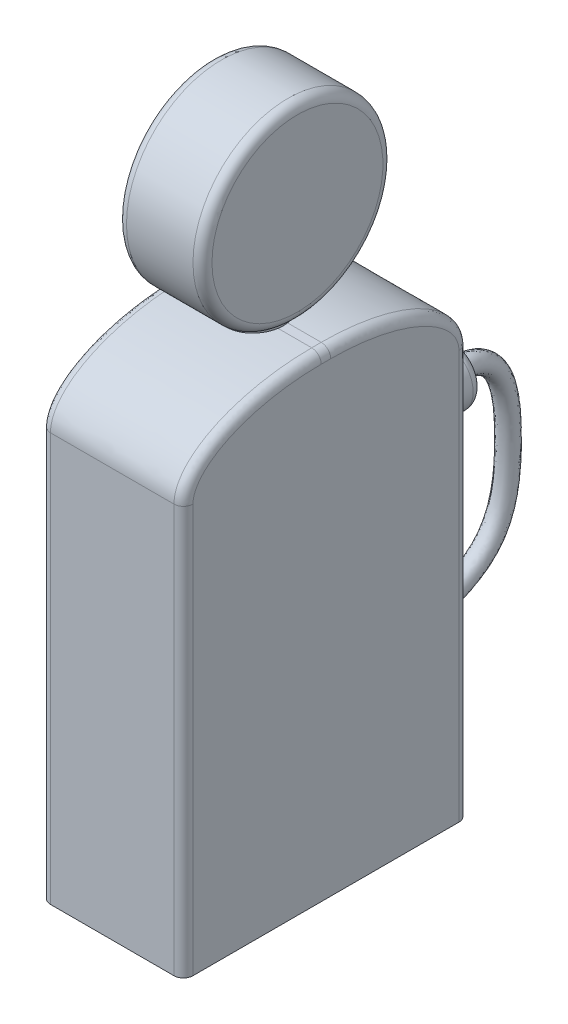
ISO-10303-21;
HEADER;
FILE_DESCRIPTION(('STEP AP214'),'2;1');
FILE_NAME('part.step','',(''),(''),'','','');
FILE_SCHEMA(('AUTOMOTIVE_DESIGN { 1 0 10303 214 1 1 1 1 }'));
ENDSEC;
DATA;
#1=APPLICATION_CONTEXT('core data for automotive mechanical design processes');
#2=APPLICATION_PROTOCOL_DEFINITION('international standard','automotive_design',2000,#1);
#3=PRODUCT_CONTEXT('',#1,'mechanical');
#4=PRODUCT('Part','Part','',(#3));
#5=PRODUCT_RELATED_PRODUCT_CATEGORY('part','',(#4));
#6=PRODUCT_DEFINITION_FORMATION('','',#4);
#7=PRODUCT_DEFINITION_CONTEXT('part definition',#1,'design');
#8=PRODUCT_DEFINITION('design','',#6,#7);
#9=PRODUCT_DEFINITION_SHAPE('','',#8);
#10=(LENGTH_UNIT() NAMED_UNIT(*) SI_UNIT(.MILLI.,.METRE.));
#11=(NAMED_UNIT(*) PLANE_ANGLE_UNIT() SI_UNIT($,.RADIAN.));
#12=(NAMED_UNIT(*) SI_UNIT($,.STERADIAN.) SOLID_ANGLE_UNIT());
#13=UNCERTAINTY_MEASURE_WITH_UNIT(LENGTH_MEASURE(1.E-05),#10,'distance_accuracy_value','');
#14=(GEOMETRIC_REPRESENTATION_CONTEXT(3) GLOBAL_UNCERTAINTY_ASSIGNED_CONTEXT((#13)) GLOBAL_UNIT_ASSIGNED_CONTEXT((#10,
#11,#12)) REPRESENTATION_CONTEXT('',''));
#15=CARTESIAN_POINT('',(0.,0.,0.));
#16=DIRECTION('',(0.,0.,1.));
#17=DIRECTION('',(1.,0.,0.));
#18=AXIS2_PLACEMENT_3D('',#15,#16,#17);
#19=CARTESIAN_POINT('',(-285.,42.970332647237,20.));
#20=DIRECTION('',(0.,0.,-1.));
#21=DIRECTION('',(0.,1.,0.));
#22=AXIS2_PLACEMENT_3D('',#19,#20,#21);
#23=PLANE('',#22);
#24=CARTESIAN_POINT('',(-285.,42.970332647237,20.));
#25=DIRECTION('',(0.,0.,-1.));
#26=DIRECTION('',(0.,1.,0.));
#27=AXIS2_PLACEMENT_3D('',#24,#25,#26);
#28=CIRCLE('',#27,0.999999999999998);
#29=CARTESIAN_POINT('',(-285.,43.970332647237,20.));
#30=VERTEX_POINT('',#29);
#31=EDGE_CURVE('E71',#30,#30,#28,.F.);
#32=ORIENTED_EDGE('',*,*,#31,.F.);
#33=EDGE_LOOP('',(#32));
#34=FACE_BOUND('',#33,.T.);
#35=CARTESIAN_POINT('',(-285.,42.970332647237,20.));
#36=DIRECTION('',(0.,0.,-1.));
#37=DIRECTION('',(0.,1.,0.));
#38=AXIS2_PLACEMENT_3D('',#35,#36,#37);
#39=CIRCLE('',#38,1.50000000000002);
#40=CARTESIAN_POINT('',(-285.,44.470332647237,20.));
#41=VERTEX_POINT('',#40);
#42=EDGE_CURVE('E65',#41,#41,#39,.T.);
#43=ORIENTED_EDGE('',*,*,#42,.F.);
#44=EDGE_LOOP('',(#43));
#45=FACE_BOUND('',#44,.T.);
#46=ADVANCED_FACE('F45',(#34,#45),#23,.F.);
#47=CARTESIAN_POINT('',(-285.,42.970332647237,40.002));
#48=DIRECTION('',(0.,0.,-1.));
#49=DIRECTION('',(0.,1.,0.));
#50=AXIS2_PLACEMENT_3D('',#47,#48,#49);
#51=CYLINDRICAL_SURFACE('',#50,1.50000000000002);
#52=CARTESIAN_POINT('',(-285.,42.970332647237,13.));
#53=DIRECTION('',(0.,0.,-1.));
#54=DIRECTION('',(0.,1.,0.));
#55=AXIS2_PLACEMENT_3D('',#52,#53,#54);
#56=CIRCLE('',#55,1.50000000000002);
#57=CARTESIAN_POINT('',(-285.,44.470332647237,13.));
#58=VERTEX_POINT('',#57);
#59=EDGE_CURVE('E68',#58,#58,#56,.T.);
#60=ORIENTED_EDGE('',*,*,#59,.F.);
#61=EDGE_LOOP('',(#60));
#62=FACE_BOUND('',#61,.T.);
#63=ORIENTED_EDGE('',*,*,#42,.T.);
#64=EDGE_LOOP('',(#63));
#65=FACE_BOUND('',#64,.T.);
#66=ADVANCED_FACE('F91',(#62,#65),#51,.T.);
#67=CARTESIAN_POINT('',(-285.,42.970332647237,4.00000000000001));
#68=DIRECTION('',(0.,0.,1.));
#69=DIRECTION('',(0.,-1.,0.));
#70=AXIS2_PLACEMENT_3D('',#67,#68,#69);
#71=CYLINDRICAL_SURFACE('',#70,2.99999999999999);
#72=CARTESIAN_POINT('',(-285.,42.970332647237,12.));
#73=DIRECTION('',(0.,0.,-1.));
#74=DIRECTION('',(0.,1.,0.));
#75=AXIS2_PLACEMENT_3D('',#72,#73,#74);
#76=CIRCLE('',#75,2.99999999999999);
#77=CARTESIAN_POINT('',(-285.,45.970332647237,12.));
#78=VERTEX_POINT('',#77);
#79=EDGE_CURVE('E56',#78,#78,#76,.T.);
#80=ORIENTED_EDGE('',*,*,#79,.T.);
#81=EDGE_LOOP('',(#80));
#82=FACE_BOUND('',#81,.T.);
#83=CARTESIAN_POINT('',(-285.,42.970332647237,5.00000000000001));
#84=DIRECTION('',(0.,0.,-1.));
#85=DIRECTION('',(0.,1.,0.));
#86=AXIS2_PLACEMENT_3D('',#83,#84,#85);
#87=CIRCLE('',#86,2.99999999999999);
#88=CARTESIAN_POINT('',(-285.,45.970332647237,5.00000000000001));
#89=VERTEX_POINT('',#88);
#90=EDGE_CURVE('E60',#89,#89,#87,.F.);
#91=ORIENTED_EDGE('',*,*,#90,.T.);
#92=EDGE_LOOP('',(#91));
#93=FACE_BOUND('',#92,.T.);
#94=ADVANCED_FACE('F84',(#82,#93),#71,.T.);
#95=CARTESIAN_POINT('',(-285.,42.970332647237,4.00000000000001));
#96=DIRECTION('',(0.,0.,-1.));
#97=DIRECTION('',(0.,1.,0.));
#98=AXIS2_PLACEMENT_3D('',#95,#96,#97);
#99=PLANE('',#98);
#100=CARTESIAN_POINT('',(-285.,42.970332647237,4.00000000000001));
#101=DIRECTION('',(0.,0.,-1.));
#102=DIRECTION('',(0.,1.,0.));
#103=AXIS2_PLACEMENT_3D('',#100,#101,#102);
#104=CIRCLE('',#103,1.99999999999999);
#105=CARTESIAN_POINT('',(-285.,44.970332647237,4.00000000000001));
#106=VERTEX_POINT('',#105);
#107=EDGE_CURVE('E11',#106,#106,#104,.T.);
#108=ORIENTED_EDGE('',*,*,#107,.T.);
#109=EDGE_LOOP('',(#108));
#110=FACE_BOUND('',#109,.T.);
#111=CARTESIAN_POINT('',(-285.,42.970332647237,4.00000000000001));
#112=DIRECTION('',(0.,0.,-1.));
#113=DIRECTION('',(0.,1.,0.));
#114=AXIS2_PLACEMENT_3D('',#111,#112,#113);
#115=CIRCLE('',#114,0.999999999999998);
#116=CARTESIAN_POINT('',(-285.,43.970332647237,4.00000000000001));
#117=VERTEX_POINT('',#116);
#118=EDGE_CURVE('E74',#117,#117,#115,.T.);
#119=ORIENTED_EDGE('',*,*,#118,.F.);
#120=EDGE_LOOP('',(#119));
#121=FACE_BOUND('',#120,.T.);
#122=ADVANCED_FACE('F81',(#110,#121),#99,.T.);
#123=CARTESIAN_POINT('',(-285.,42.970332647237,13.));
#124=DIRECTION('',(0.,0.,-1.));
#125=DIRECTION('',(0.,1.,0.));
#126=AXIS2_PLACEMENT_3D('',#123,#124,#125);
#127=PLANE('',#126);
#128=CARTESIAN_POINT('',(-285.,42.970332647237,13.));
#129=DIRECTION('',(0.,0.,-1.));
#130=DIRECTION('',(0.,1.,0.));
#131=AXIS2_PLACEMENT_3D('',#128,#129,#130);
#132=CIRCLE('',#131,1.99999999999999);
#133=CARTESIAN_POINT('',(-285.,44.970332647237,13.));
#134=VERTEX_POINT('',#133);
#135=EDGE_CURVE('E52',#134,#134,#132,.F.);
#136=ORIENTED_EDGE('',*,*,#135,.T.);
#137=EDGE_LOOP('',(#136));
#138=FACE_BOUND('',#137,.T.);
#139=ORIENTED_EDGE('',*,*,#59,.T.);
#140=EDGE_LOOP('',(#139));
#141=FACE_BOUND('',#140,.T.);
#142=ADVANCED_FACE('F83',(#138,#141),#127,.F.);
#143=CARTESIAN_POINT('',(-285.,42.970332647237,143.001));
#144=DIRECTION('',(0.,0.,-1.));
#145=DIRECTION('',(-1.,0.,0.));
#146=AXIS2_PLACEMENT_3D('',#143,#144,#145);
#147=CYLINDRICAL_SURFACE('',#146,0.999999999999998);
#148=ORIENTED_EDGE('',*,*,#118,.T.);
#149=EDGE_LOOP('',(#148));
#150=FACE_BOUND('',#149,.T.);
#151=ORIENTED_EDGE('',*,*,#31,.T.);
#152=EDGE_LOOP('',(#151));
#153=FACE_BOUND('',#152,.T.);
#154=ADVANCED_FACE('F78',(#150,#153),#147,.F.);
#155=CARTESIAN_POINT('',(-285.,42.970332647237,12.));
#156=DIRECTION('',(0.,0.,-1.));
#157=DIRECTION('',(0.,1.,0.));
#158=AXIS2_PLACEMENT_3D('',#155,#156,#157);
#159=TOROIDAL_SURFACE('',#158,1.99999999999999,1.);
#160=ORIENTED_EDGE('',*,*,#135,.F.);
#161=EDGE_LOOP('',(#160));
#162=FACE_BOUND('',#161,.T.);
#163=ORIENTED_EDGE('',*,*,#79,.F.);
#164=EDGE_LOOP('',(#163));
#165=FACE_BOUND('',#164,.T.);
#166=ADVANCED_FACE('F105',(#162,#165),#159,.T.);
#167=CARTESIAN_POINT('',(-285.,42.970332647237,5.00000000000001));
#168=DIRECTION('',(0.,0.,-1.));
#169=DIRECTION('',(0.,1.,0.));
#170=AXIS2_PLACEMENT_3D('',#167,#168,#169);
#171=TOROIDAL_SURFACE('',#170,1.99999999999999,1.);
#172=ORIENTED_EDGE('',*,*,#90,.F.);
#173=EDGE_LOOP('',(#172));
#174=FACE_BOUND('',#173,.T.);
#175=ORIENTED_EDGE('',*,*,#107,.F.);
#176=EDGE_LOOP('',(#175));
#177=FACE_BOUND('',#176,.T.);
#178=ADVANCED_FACE('F47',(#174,#177),#171,.T.);
#179=CLOSED_SHELL('',(#46,#66,#94,#122,#142,#154,#166,#178));
#180=MANIFOLD_SOLID_BREP('B2',#179);
#181=CARTESIAN_POINT('',(-289.5,70.,25.));
#182=DIRECTION('',(1.,0.,0.));
#183=DIRECTION('',(0.,0.,-1.));
#184=AXIS2_PLACEMENT_3D('',#181,#182,#183);
#185=CYLINDRICAL_SURFACE('',#184,9.99999999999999);
#186=CARTESIAN_POINT('',(-288.5,70.,25.));
#187=DIRECTION('',(-1.,0.,0.));
#188=DIRECTION('',(0.,0.,1.));
#189=AXIS2_PLACEMENT_3D('',#186,#187,#188);
#190=CIRCLE('',#189,9.99999999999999);
#191=CARTESIAN_POINT('',(-288.5,70.,35.));
#192=VERTEX_POINT('',#191);
#193=EDGE_CURVE('E559',#192,#192,#190,.F.);
#194=ORIENTED_EDGE('',*,*,#193,.T.);
#195=EDGE_LOOP('',(#194));
#196=FACE_BOUND('',#195,.T.);
#197=CARTESIAN_POINT('',(-281.5,70.,25.));
#198=DIRECTION('',(-1.,0.,0.));
#199=DIRECTION('',(0.,0.,1.));
#200=AXIS2_PLACEMENT_3D('',#197,#198,#199);
#201=CIRCLE('',#200,9.99999999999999);
#202=CARTESIAN_POINT('',(-281.5,70.,35.));
#203=VERTEX_POINT('',#202);
#204=EDGE_CURVE('E563',#203,#203,#201,.T.);
#205=ORIENTED_EDGE('',*,*,#204,.T.);
#206=EDGE_LOOP('',(#205));
#207=FACE_BOUND('',#206,.T.);
#208=CARTESIAN_POINT('',(-285.,60.4606079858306,28.));
#209=CARTESIAN_POINT('',(-285.164389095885,60.4606062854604,27.9999979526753));
#210=CARTESIAN_POINT('',(-285.328798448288,60.4563121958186,27.9864421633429));
#211=CARTESIAN_POINT('',(-285.652810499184,60.439668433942,27.932716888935));
#212=CARTESIAN_POINT('',(-285.812411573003,60.4273160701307,27.8925385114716));
#213=CARTESIAN_POINT('',(-286.122069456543,60.3960779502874,27.7870550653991));
#214=CARTESIAN_POINT('',(-286.272141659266,60.3772030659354,27.7217917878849));
#215=CARTESIAN_POINT('',(-286.55924386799,60.3350613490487,27.5681284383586));
#216=CARTESIAN_POINT('',(-286.696271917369,60.3117938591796,27.4797249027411));
#217=CARTESIAN_POINT('',(-286.957732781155,60.2626627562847,27.2792950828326));
#218=CARTESIAN_POINT('',(-287.081691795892,60.2367438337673,27.1666641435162));
#219=CARTESIAN_POINT('',(-287.309275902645,60.1857027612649,26.9222724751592));
#220=CARTESIAN_POINT('',(-287.4128983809,60.1605807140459,26.7905092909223));
#221=CARTESIAN_POINT('',(-287.598925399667,60.1133357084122,26.5082228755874));
#222=CARTESIAN_POINT('',(-287.680846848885,60.0912855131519,26.3573680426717));
#223=CARTESIAN_POINT('',(-287.817974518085,60.0533112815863,26.0432492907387));
#224=CARTESIAN_POINT('',(-287.873186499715,60.0373859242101,25.8799880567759));
#225=CARTESIAN_POINT('',(-287.953760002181,60.0138470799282,25.5506477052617));
#226=CARTESIAN_POINT('',(-287.979930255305,60.0060088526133,25.3847827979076));
#227=CARTESIAN_POINT('',(-288.004234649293,59.998735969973,25.0508436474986));
#228=CARTESIAN_POINT('',(-288.002374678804,59.9992995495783,24.8827698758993));
#229=CARTESIAN_POINT('',(-287.971214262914,60.008607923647,24.5548576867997));
#230=CARTESIAN_POINT('',(-287.94278961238,60.0170915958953,24.3949274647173));
#231=CARTESIAN_POINT('',(-287.860737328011,60.0409695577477,24.0822215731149));
#232=CARTESIAN_POINT('',(-287.807108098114,60.0563642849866,23.9294463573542));
#233=CARTESIAN_POINT('',(-287.675575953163,60.0926955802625,23.6333053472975));
#234=CARTESIAN_POINT('',(-287.597397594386,60.1136946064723,23.4900698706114));
#235=CARTESIAN_POINT('',(-287.419204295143,60.1590071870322,23.2184706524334));
#236=CARTESIAN_POINT('',(-287.319184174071,60.1833215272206,23.0901104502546));
#237=CARTESIAN_POINT('',(-287.095604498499,60.2337689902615,22.8466790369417));
#238=CARTESIAN_POINT('',(-286.971286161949,60.259936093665,22.7323108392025));
#239=CARTESIAN_POINT('',(-286.704979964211,60.3103204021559,22.5258469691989));
#240=CARTESIAN_POINT('',(-286.562990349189,60.3345374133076,22.4337535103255));
#241=CARTESIAN_POINT('',(-286.263521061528,60.3784419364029,22.2737200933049));
#242=CARTESIAN_POINT('',(-286.105905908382,60.3980837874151,22.2060202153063));
#243=CARTESIAN_POINT('',(-285.780785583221,60.4300721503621,22.0983327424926));
#244=CARTESIAN_POINT('',(-285.613283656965,60.4424210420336,22.0583361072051));
#245=CARTESIAN_POINT('',(-285.279835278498,60.4579030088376,22.0085045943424));
#246=CARTESIAN_POINT('',(-285.114063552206,60.4613624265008,21.997601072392));
#247=CARTESIAN_POINT('',(-284.783054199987,60.4595761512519,22.0032810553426));
#248=CARTESIAN_POINT('',(-284.61781650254,60.4543316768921,22.0198607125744));
#249=CARTESIAN_POINT('',(-284.297023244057,60.4360488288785,22.0790847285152));
#250=CARTESIAN_POINT('',(-284.141327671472,60.423216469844,22.1210407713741));
#251=CARTESIAN_POINT('',(-283.839196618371,60.3914171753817,22.2290284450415));
#252=CARTESIAN_POINT('',(-283.692762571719,60.3724492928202,22.2950637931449));
#253=CARTESIAN_POINT('',(-283.408965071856,60.3298832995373,22.4513625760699));
#254=CARTESIAN_POINT('',(-283.271950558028,60.3061745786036,22.5422287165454));
#255=CARTESIAN_POINT('',(-283.014723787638,60.2570358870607,22.7448939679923));
#256=CARTESIAN_POINT('',(-282.894515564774,60.2316055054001,22.8566980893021));
#257=CARTESIAN_POINT('',(-282.66963918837,60.1807273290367,23.1030897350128));
#258=CARTESIAN_POINT('',(-282.565728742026,60.1553150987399,23.2383778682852));
#259=CARTESIAN_POINT('',(-282.382066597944,60.108302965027,23.5250764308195));
#260=CARTESIAN_POINT('',(-282.302313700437,60.0867028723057,23.6764860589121));
#261=CARTESIAN_POINT('',(-282.169999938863,60.0498805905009,23.9901289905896));
#262=CARTESIAN_POINT('',(-282.117235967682,60.0346109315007,24.1522707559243));
#263=CARTESIAN_POINT('',(-282.039878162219,60.0119604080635,24.4836600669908));
#264=CARTESIAN_POINT('',(-282.015276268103,60.0045772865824,24.6529055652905));
#265=CARTESIAN_POINT('',(-281.995553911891,59.998669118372,24.9866956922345));
#266=CARTESIAN_POINT('',(-281.999334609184,59.9998138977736,25.1511703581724));
#267=CARTESIAN_POINT('',(-282.033643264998,60.0100547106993,25.4770389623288));
#268=CARTESIAN_POINT('',(-282.064169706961,60.0191502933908,25.6384330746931));
#269=CARTESIAN_POINT('',(-282.150423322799,60.0441766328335,25.9518716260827));
#270=CARTESIAN_POINT('',(-282.205876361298,60.0600329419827,26.1039978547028));
#271=CARTESIAN_POINT('',(-282.340163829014,60.096941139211,26.3968664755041));
#272=CARTESIAN_POINT('',(-282.419002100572,60.1179938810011,26.5376069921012));
#273=CARTESIAN_POINT('',(-282.60074691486,60.1639206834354,26.8086037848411));
#274=CARTESIAN_POINT('',(-282.704342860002,60.1888954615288,26.9383805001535));
#275=CARTESIAN_POINT('',(-282.931420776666,60.2395292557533,27.1790751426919));
#276=CARTESIAN_POINT('',(-283.054908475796,60.2651884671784,27.2899876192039));
#277=CARTESIAN_POINT('',(-283.322681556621,60.3151863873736,27.493125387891));
#278=CARTESIAN_POINT('',(-283.467477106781,60.3394629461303,27.5846951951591));
#279=CARTESIAN_POINT('',(-283.771110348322,60.3829490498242,27.7420862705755));
#280=CARTESIAN_POINT('',(-283.929941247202,60.4021610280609,27.8079199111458));
#281=CARTESIAN_POINT('',(-284.239480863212,60.4314436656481,27.906038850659));
#282=CARTESIAN_POINT('',(-284.389217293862,60.4422769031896,27.9411771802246));
#283=CARTESIAN_POINT('',(-284.692630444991,60.4568591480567,27.9881563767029));
#284=CARTESIAN_POINT('',(-284.84630636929,60.4606095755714,28.0000019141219));
#285=CARTESIAN_POINT('',(-285.,60.4606079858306,28.));
#286=B_SPLINE_CURVE_WITH_KNOTS('',3,(#208,#209,#210,#211,#212,#213,#214,#215,#216,#217,#218,
#219,#220,#221,#222,#223,#224,#225,#226,#227,#228,#229,#230,#231,#232,#233,#234,#235,#236,#237,
#238,#239,#240,#241,#242,#243,#244,#245,#246,#247,#248,#249,#250,#251,#252,#253,#254,#255,#256,
#257,#258,#259,#260,#261,#262,#263,#264,#265,#266,#267,#268,#269,#270,#271,#272,#273,#274,#275,
#276,#277,#278,#279,#280,#281,#282,#283,#284,#285),.UNSPECIFIED.,.T.,.F.,(4,2,2,2,2,2,2,2,2,2,2,
2,2,2,2,2,2,2,2,2,2,2,2,2,2,2,2,2,2,2,2,2,2,2,2,2,2,2,4),(0.,0.492600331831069,
0.985365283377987,1.47731282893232,1.96933405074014,2.47546300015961,2.98165695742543,
3.49831878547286,4.01486911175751,4.51664280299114,5.01831108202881,5.5040025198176,
5.98972471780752,6.48110418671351,6.97260033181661,7.48304294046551,7.99353624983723,
8.50892476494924,9.0241450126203,9.52016161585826,10.0161087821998,10.4991718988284,
10.9823096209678,11.4784146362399,11.9746385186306,12.4895901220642,13.0045161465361,
13.5155078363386,14.0263532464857,14.5175260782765,15.0086710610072,15.4945419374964,
15.9804926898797,16.4819925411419,16.9836370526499,17.500232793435,18.0165798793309,
18.477223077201,18.9377739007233),.UNSPECIFIED.);
#287=CARTESIAN_POINT('',(-285.,60.4606079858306,28.));
#288=VERTEX_POINT('',#287);
#289=EDGE_CURVE('E304',#288,#288,#286,.T.);
#290=ORIENTED_EDGE('',*,*,#289,.F.);
#291=EDGE_LOOP('',(#290));
#292=FACE_BOUND('',#291,.T.);
#293=ADVANCED_FACE('F173',(#196,#207,#292),#185,.T.);
#294=CARTESIAN_POINT('',(-289.5,70.,25.));
#295=DIRECTION('',(-1.,0.,0.));
#296=DIRECTION('',(0.,0.,1.));
#297=AXIS2_PLACEMENT_3D('',#294,#295,#296);
#298=PLANE('',#297);
#299=CARTESIAN_POINT('',(-289.5,70.,25.));
#300=DIRECTION('',(-1.,0.,0.));
#301=DIRECTION('',(0.,0.,1.));
#302=AXIS2_PLACEMENT_3D('',#299,#300,#301);
#303=CIRCLE('',#302,8.99999999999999);
#304=CARTESIAN_POINT('',(-289.5,70.,34.));
#305=VERTEX_POINT('',#304);
#306=EDGE_CURVE('E895',#305,#305,#303,.T.);
#307=ORIENTED_EDGE('',*,*,#306,.T.);
#308=EDGE_LOOP('',(#307));
#309=FACE_BOUND('',#308,.T.);
#310=ADVANCED_FACE('F342',(#309),#298,.T.);
#311=CARTESIAN_POINT('',(-280.5,70.,25.));
#312=DIRECTION('',(-1.,0.,0.));
#313=DIRECTION('',(0.,0.,1.));
#314=AXIS2_PLACEMENT_3D('',#311,#312,#313);
#315=PLANE('',#314);
#316=CARTESIAN_POINT('',(-280.5,70.,25.));
#317=DIRECTION('',(-1.,0.,0.));
#318=DIRECTION('',(0.,0.,1.));
#319=AXIS2_PLACEMENT_3D('',#316,#317,#318);
#320=CIRCLE('',#319,8.99999999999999);
#321=CARTESIAN_POINT('',(-280.5,70.,34.));
#322=VERTEX_POINT('',#321);
#323=EDGE_CURVE('E556',#322,#322,#320,.F.);
#324=ORIENTED_EDGE('',*,*,#323,.T.);
#325=EDGE_LOOP('',(#324));
#326=FACE_BOUND('',#325,.T.);
#327=ADVANCED_FACE('F544',(#326),#315,.F.);
#328=CARTESIAN_POINT('',(-285.,50.,25.));
#329=DIRECTION('',(0.,1.,0.));
#330=DIRECTION('',(0.,0.,1.));
#331=AXIS2_PLACEMENT_3D('',#328,#329,#330);
#332=CYLINDRICAL_SURFACE('',#331,2.99999999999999);
#333=CARTESIAN_POINT('',(-287.95803989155,59.,24.5));
#334=CARTESIAN_POINT('',(-287.944011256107,59.0000030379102,24.4169557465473));
#335=CARTESIAN_POINT('',(-287.926470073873,58.999655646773,24.3345096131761));
#336=CARTESIAN_POINT('',(-287.884525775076,58.9983121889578,24.1713929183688));
#337=CARTESIAN_POINT('',(-287.860123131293,58.9973161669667,24.0907222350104));
#338=CARTESIAN_POINT('',(-287.804641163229,58.9947287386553,23.9317931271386));
#339=CARTESIAN_POINT('',(-287.773567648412,58.9931378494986,23.853532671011));
#340=CARTESIAN_POINT('',(-287.704976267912,58.9894347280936,23.6999276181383));
#341=CARTESIAN_POINT('',(-287.667458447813,58.9873224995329,23.6245830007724));
#342=CARTESIAN_POINT('',(-287.545575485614,58.9803250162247,23.4036694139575));
#343=CARTESIAN_POINT('',(-287.451851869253,58.9747774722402,23.2631379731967));
#344=CARTESIAN_POINT('',(-287.242285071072,58.962731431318,22.9998741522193));
#345=CARTESIAN_POINT('',(-287.126444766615,58.9562330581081,22.8771394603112));
#346=CARTESIAN_POINT('',(-286.875506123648,58.9431613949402,22.6524702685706));
#347=CARTESIAN_POINT('',(-286.740356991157,58.9365879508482,22.5505924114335));
#348=CARTESIAN_POINT('',(-286.454831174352,58.9242700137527,22.370945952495));
#349=CARTESIAN_POINT('',(-286.304452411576,58.9185256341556,22.2931806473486));
#350=CARTESIAN_POINT('',(-285.992675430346,58.9086327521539,22.1639677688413));
#351=CARTESIAN_POINT('',(-285.83127372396,58.9044847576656,22.1125285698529));
#352=CARTESIAN_POINT('',(-285.502087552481,58.8983414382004,22.0375015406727));
#353=CARTESIAN_POINT('',(-285.334303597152,58.8963459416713,22.0139114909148));
#354=CARTESIAN_POINT('',(-284.997699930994,58.8947746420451,21.9952810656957));
#355=CARTESIAN_POINT('',(-284.82888513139,58.8951912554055,22.0001512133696));
#356=CARTESIAN_POINT('',(-284.494392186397,58.8983755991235,22.0381337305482));
#357=CARTESIAN_POINT('',(-284.328714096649,58.9011433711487,22.0712466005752));
#358=CARTESIAN_POINT('',(-284.086371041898,58.9067706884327,22.1412621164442));
#359=CARTESIAN_POINT('',(-284.00661501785,58.9088925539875,22.1679935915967));
#360=CARTESIAN_POINT('',(-283.849635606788,58.9135547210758,22.2280490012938));
#361=CARTESIAN_POINT('',(-283.772411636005,58.9160949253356,22.2613714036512));
#362=CARTESIAN_POINT('',(-283.621074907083,58.9215091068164,22.3343629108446));
#363=CARTESIAN_POINT('',(-283.54696091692,58.9243829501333,22.3740294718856));
#364=CARTESIAN_POINT('',(-283.402271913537,58.930370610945,22.4594610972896));
#365=CARTESIAN_POINT('',(-283.331700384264,58.9334846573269,22.5052320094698));
#366=CARTESIAN_POINT('',(-283.12582144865,58.9430437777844,22.6514303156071));
#367=CARTESIAN_POINT('',(-282.996601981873,58.949696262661,22.7606213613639));
#368=CARTESIAN_POINT('',(-282.75833363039,58.9626416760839,22.9991630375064));
#369=CARTESIAN_POINT('',(-282.649283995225,58.9689346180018,23.1285129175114));
#370=CARTESIAN_POINT('',(-282.503050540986,58.9774482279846,23.3349440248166));
#371=CARTESIAN_POINT('',(-282.45712956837,58.9801357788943,23.4059605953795));
#372=CARTESIAN_POINT('',(-282.371461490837,58.9850988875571,23.5515848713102));
#373=CARTESIAN_POINT('',(-282.331709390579,58.987374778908,23.6261896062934));
#374=CARTESIAN_POINT('',(-282.258674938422,58.9914237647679,23.7784186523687));
#375=CARTESIAN_POINT('',(-282.225386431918,58.9931973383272,23.856040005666));
#376=CARTESIAN_POINT('',(-282.165473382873,58.9961675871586,24.0138082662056));
#377=CARTESIAN_POINT('',(-282.13884694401,58.9973644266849,24.0939544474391));
#378=CARTESIAN_POINT('',(-282.100356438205,58.9988207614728,24.2285331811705));
#379=CARTESIAN_POINT('',(-282.086554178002,58.9992607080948,24.2824177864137));
#380=CARTESIAN_POINT('',(-282.061984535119,58.999850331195,24.3907812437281));
#381=CARTESIAN_POINT('',(-282.051212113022,59.0000004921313,24.4452589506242));
#382=CARTESIAN_POINT('',(-282.04196010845,59.,24.5));
#383=B_SPLINE_CURVE_WITH_KNOTS('',3,(#333,#334,#335,#336,#337,#338,#339,#340,#341,#342,#343,
#344,#345,#346,#347,#348,#349,#350,#351,#352,#353,#354,#355,#356,#357,#358,#359,#360,#361,#362,
#363,#364,#365,#366,#367,#368,#369,#370,#371,#372,#373,#374,#375,#376,#377,#378,#379,#380,#381,
#382),.UNSPECIFIED.,.F.,.F.,(4,2,2,2,2,2,2,2,2,2,2,2,2,2,2,2,2,2,2,2,2,2,2,2,4),(0.,
0.252579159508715,0.505140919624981,0.757483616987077,1.00982452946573,1.51424663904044,
2.01860316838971,2.52431176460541,3.03008947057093,3.53602796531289,4.04192613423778,
4.5462346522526,5.05055210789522,5.30273727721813,5.55486389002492,5.80688966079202,
6.05915862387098,6.56452698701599,7.06987654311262,7.32346200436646,7.57684103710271,
7.82997760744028,8.08304204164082,8.24983934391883,8.4163575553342),.UNSPECIFIED.);
#384=CARTESIAN_POINT('',(-287.95803989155,59.,24.4999999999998));
#385=VERTEX_POINT('',#384);
#386=CARTESIAN_POINT('',(-282.04196010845,59.,24.5));
#387=VERTEX_POINT('',#386);
#388=EDGE_CURVE('E296',#385,#387,#383,.T.);
#389=ORIENTED_EDGE('',*,*,#388,.F.);
#390=CARTESIAN_POINT('',(-285.,59.,25.));
#391=DIRECTION('',(0.,-1.,0.));
#392=DIRECTION('',(0.,0.,-1.));
#393=AXIS2_PLACEMENT_3D('',#390,#391,#392);
#394=CIRCLE('',#393,2.99999999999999);
#395=CARTESIAN_POINT('',(-287.95803989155,59.,25.5));
#396=VERTEX_POINT('',#395);
#397=EDGE_CURVE('E279',#385,#396,#394,.F.);
#398=ORIENTED_EDGE('',*,*,#397,.T.);
#399=CARTESIAN_POINT('',(-282.04196010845,59.,25.5));
#400=CARTESIAN_POINT('',(-282.055988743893,59.0000030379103,25.5830442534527));
#401=CARTESIAN_POINT('',(-282.073529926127,58.999655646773,25.665490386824));
#402=CARTESIAN_POINT('',(-282.115474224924,58.9983121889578,25.8286070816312));
#403=CARTESIAN_POINT('',(-282.139876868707,58.9973161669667,25.9092777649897));
#404=CARTESIAN_POINT('',(-282.195358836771,58.9947287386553,26.0682068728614));
#405=CARTESIAN_POINT('',(-282.226432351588,58.9931378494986,26.146467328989));
#406=CARTESIAN_POINT('',(-282.295023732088,58.9894347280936,26.3000723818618));
#407=CARTESIAN_POINT('',(-282.332541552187,58.987322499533,26.3754169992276));
#408=CARTESIAN_POINT('',(-282.454424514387,58.9803250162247,26.5963305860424));
#409=CARTESIAN_POINT('',(-282.548148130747,58.9747774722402,26.7368620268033));
#410=CARTESIAN_POINT('',(-282.757714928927,58.962731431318,27.0001258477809));
#411=CARTESIAN_POINT('',(-282.873555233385,58.9562330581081,27.1228605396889));
#412=CARTESIAN_POINT('',(-283.124493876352,58.9431613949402,27.3475297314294));
#413=CARTESIAN_POINT('',(-283.259643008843,58.9365879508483,27.4494075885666));
#414=CARTESIAN_POINT('',(-283.545168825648,58.9242700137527,27.6290540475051));
#415=CARTESIAN_POINT('',(-283.695547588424,58.9185256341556,27.7068193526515));
#416=CARTESIAN_POINT('',(-284.007324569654,58.9086327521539,27.8360322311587));
#417=CARTESIAN_POINT('',(-284.16872627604,58.9044847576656,27.8874714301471));
#418=CARTESIAN_POINT('',(-284.497912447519,58.8983414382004,27.9624984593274));
#419=CARTESIAN_POINT('',(-284.665696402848,58.8963459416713,27.9860885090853));
#420=CARTESIAN_POINT('',(-285.002300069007,58.8947746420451,28.0047189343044));
#421=CARTESIAN_POINT('',(-285.17111486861,58.8951912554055,27.9998487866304));
#422=CARTESIAN_POINT('',(-285.505607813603,58.8983755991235,27.9618662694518));
#423=CARTESIAN_POINT('',(-285.671285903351,58.9011433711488,27.9287533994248));
#424=CARTESIAN_POINT('',(-285.913628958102,58.9067706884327,27.8587378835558));
#425=CARTESIAN_POINT('',(-285.99338498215,58.9088925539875,27.8320064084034));
#426=CARTESIAN_POINT('',(-286.150364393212,58.9135547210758,27.7719509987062));
#427=CARTESIAN_POINT('',(-286.227588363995,58.9160949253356,27.7386285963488));
#428=CARTESIAN_POINT('',(-286.378925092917,58.9215091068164,27.6656370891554));
#429=CARTESIAN_POINT('',(-286.45303908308,58.9243829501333,27.6259705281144));
#430=CARTESIAN_POINT('',(-286.597728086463,58.9303706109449,27.5405389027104));
#431=CARTESIAN_POINT('',(-286.668299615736,58.9334846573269,27.4947679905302));
#432=CARTESIAN_POINT('',(-286.87417855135,58.9430437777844,27.3485696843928));
#433=CARTESIAN_POINT('',(-287.003398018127,58.949696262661,27.2393786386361));
#434=CARTESIAN_POINT('',(-287.24166636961,58.962641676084,27.0008369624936));
#435=CARTESIAN_POINT('',(-287.350716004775,58.9689346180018,26.8714870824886));
#436=CARTESIAN_POINT('',(-287.496949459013,58.9774482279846,26.6650559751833));
#437=CARTESIAN_POINT('',(-287.54287043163,58.9801357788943,26.5940394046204));
#438=CARTESIAN_POINT('',(-287.628538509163,58.9850988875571,26.4484151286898));
#439=CARTESIAN_POINT('',(-287.66829060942,58.987374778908,26.3738103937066));
#440=CARTESIAN_POINT('',(-287.741325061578,58.9914237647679,26.2215813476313));
#441=CARTESIAN_POINT('',(-287.774613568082,58.9931973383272,26.1439599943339));
#442=CARTESIAN_POINT('',(-287.834526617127,58.9961675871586,25.9861917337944));
#443=CARTESIAN_POINT('',(-287.86115305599,58.9973644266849,25.9060455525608));
#444=CARTESIAN_POINT('',(-287.899643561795,58.9988207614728,25.7714668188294));
#445=CARTESIAN_POINT('',(-287.913445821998,58.9992607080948,25.7175822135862));
#446=CARTESIAN_POINT('',(-287.938015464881,58.999850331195,25.6092187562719));
#447=CARTESIAN_POINT('',(-287.948787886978,59.0000004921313,25.5547410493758));
#448=CARTESIAN_POINT('',(-287.95803989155,59.,25.5));
#449=B_SPLINE_CURVE_WITH_KNOTS('',3,(#399,#400,#401,#402,#403,#404,#405,#406,#407,#408,#409,
#410,#411,#412,#413,#414,#415,#416,#417,#418,#419,#420,#421,#422,#423,#424,#425,#426,#427,#428,
#429,#430,#431,#432,#433,#434,#435,#436,#437,#438,#439,#440,#441,#442,#443,#444,#445,#446,#447,
#448),.UNSPECIFIED.,.F.,.F.,(4,2,2,2,2,2,2,2,2,2,2,2,2,2,2,2,2,2,2,2,2,2,2,2,4),(0.,
0.252579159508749,0.505140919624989,0.75748361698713,1.00982452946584,1.51424663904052,
2.01860316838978,2.52431176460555,3.03008947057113,3.53602796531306,4.04192613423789,
4.54623465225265,5.05055210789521,5.30273727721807,5.55486389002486,5.80688966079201,
6.05915862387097,6.56452698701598,7.06987654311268,7.32346200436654,7.57684103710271,
7.8299776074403,8.08304204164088,8.24983934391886,8.41635755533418),.UNSPECIFIED.);
#450=CARTESIAN_POINT('',(-282.04196010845,59.,25.5));
#451=VERTEX_POINT('',#450);
#452=EDGE_CURVE('E293',#451,#396,#449,.T.);
#453=ORIENTED_EDGE('',*,*,#452,.F.);
#454=EDGE_CURVE('E297',#451,#387,#394,.F.);
#455=ORIENTED_EDGE('',*,*,#454,.T.);
#456=EDGE_LOOP('',(#389,#398,#453,#455));
#457=FACE_BOUND('',#456,.T.);
#458=ORIENTED_EDGE('',*,*,#289,.T.);
#459=EDGE_LOOP('',(#458));
#460=FACE_BOUND('',#459,.T.);
#461=ADVANCED_FACE('F290',(#457,#460),#332,.T.);
#462=CARTESIAN_POINT('',(-292.5,59.,10.));
#463=DIRECTION('',(0.,-1.,0.));
#464=DIRECTION('',(0.,0.,-1.));
#465=AXIS2_PLACEMENT_3D('',#462,#463,#464);
#466=PLANE('',#465);
#467=CARTESIAN_POINT('',(-293.25,59.,24.5));
#468=CARTESIAN_POINT('',(-287.75,59.,24.5));
#469=CARTESIAN_POINT('',(-282.25,59.,24.5));
#470=CARTESIAN_POINT('',(-276.75,59.,24.5));
#471=(BOUNDED_CURVE() B_SPLINE_CURVE(3,(#467,#468,#469,#470),.UNSPECIFIED.,.F.,
.F.) B_SPLINE_CURVE_WITH_KNOTS((4,4),(-0.000750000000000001,0.01575),
.UNSPECIFIED.) CURVE() GEOMETRIC_REPRESENTATION_ITEM() RATIONAL_B_SPLINE_CURVE((1.,1.,1.,1.)) REPRESENTATION_ITEM(''));
#472=CARTESIAN_POINT('',(-291.5,59.,24.5));
#473=VERTEX_POINT('',#472);
#474=EDGE_CURVE('E285',#385,#473,#471,.F.);
#475=ORIENTED_EDGE('',*,*,#474,.T.);
#476=DIRECTION('',(0.,0.,-1.));
#477=VECTOR('',#476,1.);
#478=CARTESIAN_POINT('',(-291.5,59.,25.5));
#479=LINE('',#478,#477);
#480=CARTESIAN_POINT('',(-291.5,59.,25.5));
#481=VERTEX_POINT('',#480);
#482=EDGE_CURVE('E191',#473,#481,#479,.F.);
#483=ORIENTED_EDGE('',*,*,#482,.T.);
#484=CARTESIAN_POINT('',(-276.75,59.,25.5));
#485=CARTESIAN_POINT('',(-282.25,59.,25.5));
#486=CARTESIAN_POINT('',(-287.75,59.,25.5));
#487=CARTESIAN_POINT('',(-293.25,59.,25.5));
#488=(BOUNDED_CURVE() B_SPLINE_CURVE(3,(#484,#485,#486,#487),.UNSPECIFIED.,.F.,
.F.) B_SPLINE_CURVE_WITH_KNOTS((4,4),(-0.000750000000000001,0.01575),
.UNSPECIFIED.) CURVE() GEOMETRIC_REPRESENTATION_ITEM() RATIONAL_B_SPLINE_CURVE((1.,1.,1.,1.)) REPRESENTATION_ITEM(''));
#489=EDGE_CURVE('E275',#481,#396,#488,.F.);
#490=ORIENTED_EDGE('',*,*,#489,.T.);
#491=ORIENTED_EDGE('',*,*,#397,.F.);
#492=EDGE_LOOP('',(#475,#483,#490,#491));
#493=FACE_BOUND('',#492,.T.);
#494=ADVANCED_FACE('F278',(#493),#466,.F.);
#495=CARTESIAN_POINT('',(-292.5,9.,10.));
#496=DIRECTION('',(0.,1.,0.));
#497=DIRECTION('',(0.,0.,1.));
#498=AXIS2_PLACEMENT_3D('',#495,#496,#497);
#499=PLANE('',#498);
#500=DIRECTION('',(1.,0.,0.));
#501=VECTOR('',#500,1.);
#502=CARTESIAN_POINT('',(-292.5,9.,10.));
#503=LINE('',#502,#501);
#504=CARTESIAN_POINT('',(-291.5,9.,10.));
#505=VERTEX_POINT('',#504);
#506=CARTESIAN_POINT('',(-278.5,9.,10.));
#507=VERTEX_POINT('',#506);
#508=EDGE_CURVE('E613',#505,#507,#503,.T.);
#509=ORIENTED_EDGE('',*,*,#508,.T.);
#510=CARTESIAN_POINT('',(-278.5,9.,11.));
#511=DIRECTION('',(0.,1.,0.));
#512=DIRECTION('',(0.,0.,1.));
#513=AXIS2_PLACEMENT_3D('',#510,#511,#512);
#514=CIRCLE('',#513,1.);
#515=CARTESIAN_POINT('',(-277.5,9.,11.));
#516=VERTEX_POINT('',#515);
#517=EDGE_CURVE('E1156',#507,#516,#514,.F.);
#518=ORIENTED_EDGE('',*,*,#517,.T.);
#519=DIRECTION('',(0.,0.,1.));
#520=VECTOR('',#519,1.);
#521=CARTESIAN_POINT('',(-277.5,9.,10.));
#522=LINE('',#521,#520);
#523=CARTESIAN_POINT('',(-277.5,9.00000000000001,39.));
#524=VERTEX_POINT('',#523);
#525=EDGE_CURVE('E614',#516,#524,#522,.T.);
#526=ORIENTED_EDGE('',*,*,#525,.T.);
#527=CARTESIAN_POINT('',(-278.5,9.00000000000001,39.));
#528=DIRECTION('',(0.,1.,0.));
#529=DIRECTION('',(0.,0.,1.));
#530=AXIS2_PLACEMENT_3D('',#527,#528,#529);
#531=CIRCLE('',#530,1.);
#532=CARTESIAN_POINT('',(-278.5,9.00000000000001,40.));
#533=VERTEX_POINT('',#532);
#534=EDGE_CURVE('E1155',#524,#533,#531,.F.);
#535=ORIENTED_EDGE('',*,*,#534,.T.);
#536=DIRECTION('',(1.,0.,0.));
#537=VECTOR('',#536,1.);
#538=CARTESIAN_POINT('',(-292.5,9.00000000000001,40.));
#539=LINE('',#538,#537);
#540=CARTESIAN_POINT('',(-291.5,9.00000000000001,40.));
#541=VERTEX_POINT('',#540);
#542=EDGE_CURVE('E578',#541,#533,#539,.T.);
#543=ORIENTED_EDGE('',*,*,#542,.F.);
#544=CARTESIAN_POINT('',(-291.5,9.00000000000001,39.));
#545=DIRECTION('',(0.,1.,0.));
#546=DIRECTION('',(0.,0.,1.));
#547=AXIS2_PLACEMENT_3D('',#544,#545,#546);
#548=CIRCLE('',#547,1.);
#549=CARTESIAN_POINT('',(-292.5,9.00000000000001,39.));
#550=VERTEX_POINT('',#549);
#551=EDGE_CURVE('E1157',#541,#550,#548,.F.);
#552=ORIENTED_EDGE('',*,*,#551,.T.);
#553=DIRECTION('',(0.,0.,1.));
#554=VECTOR('',#553,1.);
#555=CARTESIAN_POINT('',(-292.5,9.,10.));
#556=LINE('',#555,#554);
#557=CARTESIAN_POINT('',(-292.5,9.,11.));
#558=VERTEX_POINT('',#557);
#559=EDGE_CURVE('E611',#558,#550,#556,.T.);
#560=ORIENTED_EDGE('',*,*,#559,.F.);
#561=CARTESIAN_POINT('',(-291.5,9.,11.));
#562=DIRECTION('',(0.,1.,0.));
#563=DIRECTION('',(0.,0.,1.));
#564=AXIS2_PLACEMENT_3D('',#561,#562,#563);
#565=CIRCLE('',#564,1.);
#566=EDGE_CURVE('E1160',#558,#505,#565,.F.);
#567=ORIENTED_EDGE('',*,*,#566,.T.);
#568=EDGE_LOOP('',(#509,#518,#526,#535,#543,#552,#560,#567));
#569=FACE_BOUND('',#568,.T.);
#570=ADVANCED_FACE('F531',(#569),#499,.F.);
#571=CARTESIAN_POINT('',(-292.5,9.00000000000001,40.));
#572=DIRECTION('',(0.,0.,-1.));
#573=DIRECTION('',(0.,1.,0.));
#574=AXIS2_PLACEMENT_3D('',#571,#572,#573);
#575=PLANE('',#574);
#576=ORIENTED_EDGE('',*,*,#542,.T.);
#577=DIRECTION('',(0.,1.,0.));
#578=VECTOR('',#577,1.);
#579=CARTESIAN_POINT('',(-278.5,9.00000000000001,40.));
#580=LINE('',#579,#578);
#581=CARTESIAN_POINT('',(-278.5,52.,40.));
#582=VERTEX_POINT('',#581);
#583=EDGE_CURVE('E491',#533,#582,#580,.T.);
#584=ORIENTED_EDGE('',*,*,#583,.T.);
#585=CARTESIAN_POINT('',(-293.25,52.,40.));
#586=CARTESIAN_POINT('',(-287.75,52.,40.));
#587=CARTESIAN_POINT('',(-282.25,52.,40.));
#588=CARTESIAN_POINT('',(-276.75,52.,40.));
#589=(BOUNDED_CURVE() B_SPLINE_CURVE(3,(#585,#586,#587,#588),.UNSPECIFIED.,.F.,
.F.) B_SPLINE_CURVE_WITH_KNOTS((4,4),(-0.000750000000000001,0.01575),
.UNSPECIFIED.) CURVE() GEOMETRIC_REPRESENTATION_ITEM() RATIONAL_B_SPLINE_CURVE((1.,1.,1.,1.)) REPRESENTATION_ITEM(''));
#590=CARTESIAN_POINT('',(-291.5,52.,40.));
#591=VERTEX_POINT('',#590);
#592=EDGE_CURVE('E308',#582,#591,#589,.F.);
#593=ORIENTED_EDGE('',*,*,#592,.T.);
#594=DIRECTION('',(0.,1.,0.));
#595=VECTOR('',#594,1.);
#596=CARTESIAN_POINT('',(-291.5,9.00000000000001,40.));
#597=LINE('',#596,#595);
#598=EDGE_CURVE('E493',#591,#541,#597,.F.);
#599=ORIENTED_EDGE('',*,*,#598,.T.);
#600=EDGE_LOOP('',(#576,#584,#593,#599));
#601=FACE_BOUND('',#600,.T.);
#602=ADVANCED_FACE('F522',(#601),#575,.F.);
#603=CARTESIAN_POINT('',(-276.75,59.,25.5));
#604=CARTESIAN_POINT('',(-282.25,59.,25.5));
#605=CARTESIAN_POINT('',(-287.75,59.,25.5));
#606=CARTESIAN_POINT('',(-293.25,59.,25.5));
#607=(BOUNDED_CURVE() B_SPLINE_CURVE(3,(#603,#604,#605,#606),.UNSPECIFIED.,.F.,
.F.) B_SPLINE_CURVE_WITH_KNOTS((4,4),(-0.000750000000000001,0.01575),
.UNSPECIFIED.) CURVE() GEOMETRIC_REPRESENTATION_ITEM() RATIONAL_B_SPLINE_CURVE((1.,1.,1.,1.)) REPRESENTATION_ITEM(''));
#608=CARTESIAN_POINT('',(-278.5,59.,25.5));
#609=VERTEX_POINT('',#608);
#610=EDGE_CURVE('E286',#451,#609,#607,.F.);
#611=ORIENTED_EDGE('',*,*,#610,.T.);
#612=DIRECTION('',(0.,0.,-1.));
#613=VECTOR('',#612,1.);
#614=CARTESIAN_POINT('',(-278.5,59.,10.));
#615=LINE('',#614,#613);
#616=CARTESIAN_POINT('',(-278.5,59.,24.5));
#617=VERTEX_POINT('',#616);
#618=EDGE_CURVE('E499',#609,#617,#615,.T.);
#619=ORIENTED_EDGE('',*,*,#618,.T.);
#620=CARTESIAN_POINT('',(-293.25,59.,24.5));
#621=CARTESIAN_POINT('',(-287.75,59.,24.5));
#622=CARTESIAN_POINT('',(-282.25,59.,24.5));
#623=CARTESIAN_POINT('',(-276.75,59.,24.5));
#624=(BOUNDED_CURVE() B_SPLINE_CURVE(3,(#620,#621,#622,#623),.UNSPECIFIED.,.F.,
.F.) B_SPLINE_CURVE_WITH_KNOTS((4,4),(-0.000750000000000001,0.01575),
.UNSPECIFIED.) CURVE() GEOMETRIC_REPRESENTATION_ITEM() RATIONAL_B_SPLINE_CURVE((1.,1.,1.,1.)) REPRESENTATION_ITEM(''));
#625=EDGE_CURVE('E885',#617,#387,#624,.F.);
#626=ORIENTED_EDGE('',*,*,#625,.T.);
#627=ORIENTED_EDGE('',*,*,#454,.F.);
#628=EDGE_LOOP('',(#611,#619,#626,#627));
#629=FACE_BOUND('',#628,.T.);
#630=ADVANCED_FACE('F530',(#629),#466,.F.);
#631=CARTESIAN_POINT('',(-292.5,9.,10.));
#632=DIRECTION('',(0.,0.,1.));
#633=DIRECTION('',(0.,-1.,0.));
#634=AXIS2_PLACEMENT_3D('',#631,#632,#633);
#635=PLANE('',#634);
#636=CARTESIAN_POINT('',(-285.,42.970332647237,10.));
#637=DIRECTION('',(0.,0.,-1.));
#638=DIRECTION('',(0.,1.,0.));
#639=AXIS2_PLACEMENT_3D('',#636,#637,#638);
#640=CIRCLE('',#639,2.99999999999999);
#641=CARTESIAN_POINT('',(-285.,45.970332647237,10.));
#642=VERTEX_POINT('',#641);
#643=EDGE_CURVE('E597',#642,#642,#640,.T.);
#644=ORIENTED_EDGE('',*,*,#643,.F.);
#645=EDGE_LOOP('',(#644));
#646=FACE_BOUND('',#645,.T.);
#647=CARTESIAN_POINT('',(-285.,21.8670833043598,10.));
#648=DIRECTION('',(0.,0.,-1.));
#649=DIRECTION('',(0.,1.,0.));
#650=AXIS2_PLACEMENT_3D('',#647,#648,#649);
#651=CIRCLE('',#650,0.999999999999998);
#652=CARTESIAN_POINT('',(-285.,22.8670833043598,10.));
#653=VERTEX_POINT('',#652);
#654=EDGE_CURVE('E600',#653,#653,#651,.T.);
#655=ORIENTED_EDGE('',*,*,#654,.F.);
#656=EDGE_LOOP('',(#655));
#657=FACE_BOUND('',#656,.T.);
#658=CARTESIAN_POINT('',(-276.75,52.,10.));
#659=CARTESIAN_POINT('',(-282.25,52.,10.));
#660=CARTESIAN_POINT('',(-287.75,52.,10.));
#661=CARTESIAN_POINT('',(-293.25,52.,10.));
#662=(BOUNDED_CURVE() B_SPLINE_CURVE(3,(#658,#659,#660,#661),.UNSPECIFIED.,.F.,
.F.) B_SPLINE_CURVE_WITH_KNOTS((4,4),(-0.000750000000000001,0.01575),
.UNSPECIFIED.) CURVE() GEOMETRIC_REPRESENTATION_ITEM() RATIONAL_B_SPLINE_CURVE((1.,1.,1.,1.)) REPRESENTATION_ITEM(''));
#663=CARTESIAN_POINT('',(-291.5,52.,10.));
#664=VERTEX_POINT('',#663);
#665=CARTESIAN_POINT('',(-278.5,52.,10.));
#666=VERTEX_POINT('',#665);
#667=EDGE_CURVE('E573',#664,#666,#662,.F.);
#668=ORIENTED_EDGE('',*,*,#667,.T.);
#669=DIRECTION('',(0.,-1.,0.));
#670=VECTOR('',#669,1.);
#671=CARTESIAN_POINT('',(-278.5,9.,10.));
#672=LINE('',#671,#670);
#673=EDGE_CURVE('E561',#666,#507,#672,.T.);
#674=ORIENTED_EDGE('',*,*,#673,.T.);
#675=ORIENTED_EDGE('',*,*,#508,.F.);
#676=DIRECTION('',(0.,-1.,0.));
#677=VECTOR('',#676,1.);
#678=CARTESIAN_POINT('',(-291.5,52.,10.));
#679=LINE('',#678,#677);
#680=EDGE_CURVE('E558',#505,#664,#679,.F.);
#681=ORIENTED_EDGE('',*,*,#680,.T.);
#682=EDGE_LOOP('',(#668,#674,#675,#681));
#683=FACE_BOUND('',#682,.T.);
#684=ADVANCED_FACE('F430',(#646,#657,#683),#635,.F.);
#685=CARTESIAN_POINT('',(-292.5,0.,-25.));
#686=DIRECTION('',(-1.,0.,0.));
#687=DIRECTION('',(0.,0.,1.));
#688=AXIS2_PLACEMENT_3D('',#685,#686,#687);
#689=PLANE('',#688);
#690=ORIENTED_EDGE('',*,*,#559,.T.);
#691=DIRECTION('',(0.,1.,0.));
#692=VECTOR('',#691,1.);
#693=CARTESIAN_POINT('',(-292.5,52.,39.));
#694=LINE('',#693,#692);
#695=CARTESIAN_POINT('',(-292.5,52.,39.));
#696=VERTEX_POINT('',#695);
#697=EDGE_CURVE('E479',#550,#696,#694,.T.);
#698=ORIENTED_EDGE('',*,*,#697,.T.);
#699=CARTESIAN_POINT('',(-291.5,47.2413793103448,40.));
#700=CARTESIAN_POINT('',(-292.5,47.2413793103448,40.));
#701=CARTESIAN_POINT('',(-292.5,47.2413793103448,39.));
#702=CARTESIAN_POINT('',(-291.5,48.8275862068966,40.));
#703=CARTESIAN_POINT('',(-292.5,48.8275862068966,40.));
#704=CARTESIAN_POINT('',(-292.5,48.8275862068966,39.));
#705=CARTESIAN_POINT('',(-291.5,50.4137931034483,40.));
#706=CARTESIAN_POINT('',(-292.5,50.4137931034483,40.));
#707=CARTESIAN_POINT('',(-292.5,50.4137931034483,39.));
#708=CARTESIAN_POINT('',(-291.5,52.,40.));
#709=CARTESIAN_POINT('',(-292.5,52.,40.));
#710=CARTESIAN_POINT('',(-292.5,52.,39.));
#711=CARTESIAN_POINT('',(-291.5,52.1078389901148,40.0001012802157));
#712=CARTESIAN_POINT('',(-292.5,52.1078389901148,40.0001012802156));
#713=CARTESIAN_POINT('',(-292.5,52.0758979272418,39.0000448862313));
#714=CARTESIAN_POINT('',(-291.5,52.2155653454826,39.9948425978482));
#715=CARTESIAN_POINT('',(-292.5,52.2155653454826,39.9948425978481));
#716=CARTESIAN_POINT('',(-292.5,52.1517697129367,38.9963698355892));
#717=CARTESIAN_POINT('',(-291.5,52.4290038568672,39.9744048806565));
#718=CARTESIAN_POINT('',(-292.5,52.4290038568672,39.9744048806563));
#719=CARTESIAN_POINT('',(-292.5,52.3027214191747,38.9819305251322));
#720=CARTESIAN_POINT('',(-291.5,52.5347188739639,39.9592412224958));
#721=CARTESIAN_POINT('',(-292.5,52.5347188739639,39.9592412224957));
#722=CARTESIAN_POINT('',(-292.5,52.3778023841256,38.9711772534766));
#723=CARTESIAN_POINT('',(-291.5,52.7413354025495,39.920045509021));
#724=CARTESIAN_POINT('',(-292.5,52.7413354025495,39.920045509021));
#725=CARTESIAN_POINT('',(-292.5,52.5257022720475,38.9431141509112));
#726=CARTESIAN_POINT('',(-291.5,52.8422816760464,39.8961315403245));
#727=CARTESIAN_POINT('',(-292.5,52.8422816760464,39.8961315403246));
#728=CARTESIAN_POINT('',(-292.5,52.5985379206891,38.9258915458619));
#729=CARTESIAN_POINT('',(-291.5,53.0399037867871,39.8405916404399));
#730=CARTESIAN_POINT('',(-292.5,53.0399037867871,39.84059164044));
#731=CARTESIAN_POINT('',(-292.5,52.742534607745,38.8854234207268));
#732=CARTESIAN_POINT('',(-291.5,53.1365776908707,39.8089622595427));
#733=CARTESIAN_POINT('',(-292.5,53.1365776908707,39.8089622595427));
#734=CARTESIAN_POINT('',(-292.5,52.8136948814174,38.8621752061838));
#735=CARTESIAN_POINT('',(-291.5,53.3536208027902,39.7286600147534));
#736=CARTESIAN_POINT('',(-292.5,53.3536208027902,39.7286600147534));
#737=CARTESIAN_POINT('',(-292.5,52.9752004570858,38.8024185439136));
#738=CARTESIAN_POINT('',(-291.5,53.4723284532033,39.6777247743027));
#739=CARTESIAN_POINT('',(-292.5,53.4723284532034,39.6777247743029));
#740=CARTESIAN_POINT('',(-292.5,53.0648491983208,38.7640258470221));
#741=CARTESIAN_POINT('',(-291.5,53.7014806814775,39.567245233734));
#742=CARTESIAN_POINT('',(-292.5,53.7014806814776,39.5672452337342));
#743=CARTESIAN_POINT('',(-292.5,53.2403552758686,38.6794098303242));
#744=CARTESIAN_POINT('',(-291.5,53.811922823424,39.5076984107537));
#745=CARTESIAN_POINT('',(-292.5,53.811922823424,39.5076984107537));
#746=CARTESIAN_POINT('',(-292.5,53.3262114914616,38.6331842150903));
#747=CARTESIAN_POINT('',(-291.5,54.025570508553,39.381581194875));
#748=CARTESIAN_POINT('',(-292.5,54.025570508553,39.3815811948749));
#749=CARTESIAN_POINT('',(-292.5,53.4944663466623,38.5338624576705));
#750=CARTESIAN_POINT('',(-291.5,54.1287329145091,39.3149739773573));
#751=CARTESIAN_POINT('',(-292.5,54.1287329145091,39.3149739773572));
#752=CARTESIAN_POINT('',(-292.5,53.5768433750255,38.4807299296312));
#753=CARTESIAN_POINT('',(-291.5,54.3278575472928,39.1764655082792));
#754=CARTESIAN_POINT('',(-292.5,54.3278575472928,39.1764655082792));
#755=CARTESIAN_POINT('',(-292.5,53.7377013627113,38.3688412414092));
#756=CARTESIAN_POINT('',(-291.5,54.4238168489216,39.1045621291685));
#757=CARTESIAN_POINT('',(-292.5,54.4238168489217,39.1045621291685));
#758=CARTESIAN_POINT('',(-292.5,53.8161807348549,38.3100828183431));
#759=CARTESIAN_POINT('',(-291.5,54.6739751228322,38.9049432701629));
#760=CARTESIAN_POINT('',(-292.5,54.6739751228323,38.904943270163));
#761=CARTESIAN_POINT('',(-292.5,54.0228300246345,38.1451747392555));
#762=CARTESIAN_POINT('',(-291.5,54.8220805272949,38.7732984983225));
#763=CARTESIAN_POINT('',(-292.5,54.822080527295,38.7732984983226));
#764=CARTESIAN_POINT('',(-292.5,54.1474539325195,38.0345701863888));
#765=CARTESIAN_POINT('',(-291.5,55.1028192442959,38.5016573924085));
#766=CARTESIAN_POINT('',(-292.5,55.1028192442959,38.5016573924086));
#767=CARTESIAN_POINT('',(-292.5,54.3867363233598,37.8030523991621));
#768=CARTESIAN_POINT('',(-291.5,55.2354412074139,38.3616550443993));
#769=CARTESIAN_POINT('',(-292.5,55.235441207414,38.3616550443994));
#770=CARTESIAN_POINT('',(-292.5,54.5013874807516,37.6821317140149));
#771=CARTESIAN_POINT('',(-291.5,55.4877349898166,38.0755301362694));
#772=CARTESIAN_POINT('',(-292.5,55.4877349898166,38.0755301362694));
#773=CARTESIAN_POINT('',(-292.5,54.7216782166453,37.4323031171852));
#774=CARTESIAN_POINT('',(-291.5,55.6074014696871,37.9294050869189));
#775=CARTESIAN_POINT('',(-292.5,55.6074014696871,37.9294050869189));
#776=CARTESIAN_POINT('',(-292.5,54.8273140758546,37.3033919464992));
#777=CARTESIAN_POINT('',(-291.5,55.8357233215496,37.632523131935));
#778=CARTESIAN_POINT('',(-292.5,55.8357233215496,37.632523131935));
#779=CARTESIAN_POINT('',(-292.5,55.0304414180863,37.0392724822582));
#780=CARTESIAN_POINT('',(-291.5,55.9443746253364,37.4817645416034));
#781=CARTESIAN_POINT('',(-292.5,55.9443746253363,37.4817645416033));
#782=CARTESIAN_POINT('',(-292.5,55.1279298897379,36.9040618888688));
#783=CARTESIAN_POINT('',(-291.5,56.1517509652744,37.1772462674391));
#784=CARTESIAN_POINT('',(-292.5,56.1517509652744,37.1772462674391));
#785=CARTESIAN_POINT('',(-292.5,55.3151507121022,36.6291415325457));
#786=CARTESIAN_POINT('',(-291.5,56.250511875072,37.0235000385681));
#787=CARTESIAN_POINT('',(-292.5,56.250511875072,37.0235000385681));
#788=CARTESIAN_POINT('',(-292.5,55.4049109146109,36.4894506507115));
#789=CARTESIAN_POINT('',(-291.5,56.4397466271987,36.7131445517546));
#790=CARTESIAN_POINT('',(-292.5,56.4397466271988,36.7131445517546));
#791=CARTESIAN_POINT('',(-292.5,55.577752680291,36.2059832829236));
#792=CARTESIAN_POINT('',(-291.5,56.5302188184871,36.5565347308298));
#793=CARTESIAN_POINT('',(-292.5,56.5302188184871,36.5565347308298));
#794=CARTESIAN_POINT('',(-292.5,55.6608329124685,36.0622059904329));
#795=CARTESIAN_POINT('',(-291.5,56.7907474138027,36.0830163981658));
#796=CARTESIAN_POINT('',(-292.5,56.7907474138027,36.0830163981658));
#797=CARTESIAN_POINT('',(-292.5,55.9010208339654,35.6256461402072));
#798=CARTESIAN_POINT('',(-291.5,56.9497963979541,35.7625992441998));
#799=CARTESIAN_POINT('',(-292.5,56.9497963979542,35.7625992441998));
#800=CARTESIAN_POINT('',(-292.5,56.0489671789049,35.3277989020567));
#801=CARTESIAN_POINT('',(-291.5,57.2446871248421,35.1136733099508));
#802=CARTESIAN_POINT('',(-292.5,57.2446871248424,35.1136733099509));
#803=CARTESIAN_POINT('',(-292.5,56.3246775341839,34.7211007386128));
#804=CARTESIAN_POINT('',(-291.5,57.3803970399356,34.785129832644));
#805=CARTESIAN_POINT('',(-292.5,57.3803970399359,34.7851298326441));
#806=CARTESIAN_POINT('',(-292.5,56.4523266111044,34.4121984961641));
#807=CARTESIAN_POINT('',(-291.5,57.6311871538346,34.1234470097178));
#808=CARTESIAN_POINT('',(-292.5,57.6311871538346,34.1234470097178));
#809=CARTESIAN_POINT('',(-292.5,56.6890875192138,33.787531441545));
#810=CARTESIAN_POINT('',(-291.5,57.7462743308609,33.7903092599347));
#811=CARTESIAN_POINT('',(-292.5,57.7462743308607,33.7903092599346));
#812=CARTESIAN_POINT('',(-292.5,56.7982056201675,33.4717689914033));
#813=CARTESIAN_POINT('',(-291.5,57.9565079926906,33.1266885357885));
#814=CARTESIAN_POINT('',(-292.5,57.9565079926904,33.1266885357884));
#815=CARTESIAN_POINT('',(-292.5,56.9980643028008,32.8409022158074));
#816=CARTESIAN_POINT('',(-291.5,58.0519820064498,32.7962692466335));
#817=CARTESIAN_POINT('',(-292.5,58.0519820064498,32.7962692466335));
#818=CARTESIAN_POINT('',(-292.5,57.0891057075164,32.5258923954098));
#819=CARTESIAN_POINT('',(-291.5,58.2273815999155,32.1327948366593));
#820=CARTESIAN_POINT('',(-292.5,58.2273815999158,32.1327948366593));
#821=CARTESIAN_POINT('',(-292.5,57.2566851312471,31.8920001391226));
#822=CARTESIAN_POINT('',(-291.5,58.3073044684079,31.7997392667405));
#823=CARTESIAN_POINT('',(-292.5,58.3073044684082,31.7997392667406));
#824=CARTESIAN_POINT('',(-292.5,57.333220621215,31.5731170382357));
#825=CARTESIAN_POINT('',(-291.5,58.4529779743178,31.1312563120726));
#826=CARTESIAN_POINT('',(-292.5,58.452977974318,31.1312563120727));
#827=CARTESIAN_POINT('',(-292.5,57.472919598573,30.9320520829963));
#828=CARTESIAN_POINT('',(-291.5,58.5187115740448,30.7958265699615));
#829=CARTESIAN_POINT('',(-292.5,58.5187115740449,30.7958265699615));
#830=CARTESIAN_POINT('',(-292.5,57.536067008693,30.6098667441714));
#831=CARTESIAN_POINT('',(-291.5,58.6368633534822,30.1234505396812));
#832=CARTESIAN_POINT('',(-292.5,58.6368633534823,30.1234505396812));
#833=CARTESIAN_POINT('',(-292.5,57.6496895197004,29.9632666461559));
#834=CARTESIAN_POINT('',(-291.5,58.6892810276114,29.7865041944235));
#835=CARTESIAN_POINT('',(-292.5,58.6892810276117,29.7865041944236));
#836=CARTESIAN_POINT('',(-292.5,57.7001641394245,29.6388518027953));
#837=CARTESIAN_POINT('',(-291.5,58.7802462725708,29.1207809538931));
#838=CARTESIAN_POINT('',(-292.5,58.7802462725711,29.1207809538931));
#839=CARTESIAN_POINT('',(-292.5,57.7878228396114,28.9973280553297));
#840=CARTESIAN_POINT('',(-291.5,58.8191356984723,28.7920342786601));
#841=CARTESIAN_POINT('',(-292.5,58.8191356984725,28.7920342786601));
#842=CARTESIAN_POINT('',(-292.5,57.8253343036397,28.680263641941));
#843=CARTESIAN_POINT('',(-291.5,58.8854685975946,28.1337798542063));
#844=CARTESIAN_POINT('',(-292.5,58.8854685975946,28.1337798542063));
#845=CARTESIAN_POINT('',(-292.5,57.8893483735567,28.0450213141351));
#846=CARTESIAN_POINT('',(-291.5,58.9129117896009,27.8042720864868));
#847=CARTESIAN_POINT('',(-292.5,58.9129117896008,27.8042720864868));
#848=CARTESIAN_POINT('',(-292.5,57.9158507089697,27.7268433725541));
#849=CARTESIAN_POINT('',(-291.5,58.9566132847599,27.1457386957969));
#850=CARTESIAN_POINT('',(-292.5,58.9566132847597,27.1457386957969));
#851=CARTESIAN_POINT('',(-292.5,57.9580653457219,27.0907112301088));
#852=CARTESIAN_POINT('',(-291.5,58.9729040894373,26.8167144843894));
#853=CARTESIAN_POINT('',(-292.5,58.9729040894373,26.8167144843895));
#854=CARTESIAN_POINT('',(-292.5,57.9738090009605,26.7727591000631));
#855=CARTESIAN_POINT('',(-291.5,58.9945858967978,26.1584591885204));
#856=CARTESIAN_POINT('',(-292.5,58.9945858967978,26.1584591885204));
#857=CARTESIAN_POINT('',(-292.5,57.9947662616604,26.1365364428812));
#858=CARTESIAN_POINT('',(-291.5,58.9999779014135,25.8292281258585));
#859=CARTESIAN_POINT('',(-292.5,58.9999779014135,25.8292281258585));
#860=CARTESIAN_POINT('',(-292.5,57.9999808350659,25.8182659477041));
#861=CARTESIAN_POINT('',(-291.5,59.,25.5));
#862=CARTESIAN_POINT('',(-292.5,59.,25.5));
#863=CARTESIAN_POINT('',(-292.5,58.,25.5));
#864=CARTESIAN_POINT('',(-291.5,59.,22.2498123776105));
#865=CARTESIAN_POINT('',(-292.5,59.,22.2498123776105));
#866=CARTESIAN_POINT('',(-292.5,58.,22.2498123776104));
#867=CARTESIAN_POINT('',(-291.5,59.,18.9996247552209));
#868=CARTESIAN_POINT('',(-292.5,59.,18.9996247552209));
#869=CARTESIAN_POINT('',(-292.5,58.,18.9996247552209));
#870=CARTESIAN_POINT('',(-291.5,59.,15.7494371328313));
#871=CARTESIAN_POINT('',(-292.5,59.,15.7494371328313));
#872=CARTESIAN_POINT('',(-292.5,58.,15.7494371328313));
#873=(BOUNDED_SURFACE() B_SPLINE_SURFACE(3,2,((#699,#700,#701),(#702,#703,#704),(#705,#706,
#707),(#708,#709,#710),(#711,#712,#713),(#714,#715,#716),(#717,#718,#719),(#720,#721,#722),
(#723,#724,#725),(#726,#727,#728),(#729,#730,#731),(#732,#733,#734),(#735,#736,#737),(#738,#739,
#740),(#741,#742,#743),(#744,#745,#746),(#747,#748,#749),(#750,#751,#752),(#753,#754,#755),
(#756,#757,#758),(#759,#760,#761),(#762,#763,#764),(#765,#766,#767),(#768,#769,#770),(#771,#772,
#773),(#774,#775,#776),(#777,#778,#779),(#780,#781,#782),(#783,#784,#785),(#786,#787,#788),
(#789,#790,#791),(#792,#793,#794),(#795,#796,#797),(#798,#799,#800),(#801,#802,#803),(#804,#805,
#806),(#807,#808,#809),(#810,#811,#812),(#813,#814,#815),(#816,#817,#818),(#819,#820,#821),
(#822,#823,#824),(#825,#826,#827),(#828,#829,#830),(#831,#832,#833),(#834,#835,#836),(#837,#838,
#839),(#840,#841,#842),(#843,#844,#845),(#846,#847,#848),(#849,#850,#851),(#852,#853,#854),
(#855,#856,#857),(#858,#859,#860),(#861,#862,#863),(#864,#865,#866),(#867,#868,#869),(#870,#871,
#872)),.UNSPECIFIED.,.F.,.F.,.F.) B_SPLINE_SURFACE_WITH_KNOTS((4,3,2,2,2,2,2,2,2,2,2,2,2,2,2,2,
2,2,2,2,2,2,2,2,2,2,3,4),(3,3),(0.,4.75862068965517,4.98618381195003,5.21339449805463,
5.4376456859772,5.6619973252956,5.95410634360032,6.24630111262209,6.54010278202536,
6.83402312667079,7.3330730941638,7.83248660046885,8.3321051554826,8.8319075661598,
9.32982594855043,9.82784329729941,10.8244642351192,11.8265416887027,12.8282794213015,
13.8116116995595,14.7951152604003,15.7797932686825,16.7645086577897,17.7221382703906,
18.6797914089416,19.6346416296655,20.589404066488,30.3399669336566),(0.,1.),
.UNSPECIFIED.) GEOMETRIC_REPRESENTATION_ITEM() RATIONAL_B_SPLINE_SURFACE(((1.,0.707106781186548,
1.),(1.,0.707106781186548,1.),(1.,0.707106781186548,1.),(1.,0.707106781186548,1.),(1.,
0.707106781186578,1.),(1.,0.707106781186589,1.),(1.,0.707106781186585,1.),(1.,0.707106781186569,
1.),(1.,0.707106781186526,1.),(1.,0.707106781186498,1.),(1.,0.707106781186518,1.),(1.,
0.707106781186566,1.),(1.,0.707106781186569,1.),(1.,0.707106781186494,1.),(1.,0.707106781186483,
1.),(1.,0.707106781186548,1.),(1.,0.707106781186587,1.),(1.,0.707106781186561,1.),(1.,
0.707106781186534,1.),(1.,0.707106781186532,1.),(1.,0.70710678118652,1.),(1.,0.707106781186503,
1.),(1.,0.707106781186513,1.),(1.,0.70710678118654,1.),(1.,0.707106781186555,1.),(1.,
0.707106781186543,1.),(1.,0.707106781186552,1.),(1.,0.707106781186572,1.),(1.,0.707106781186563,
1.),(1.,0.707106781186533,1.),(1.,0.707106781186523,1.),(1.,0.707106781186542,1.),(1.,
0.707106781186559,1.),(1.,0.707106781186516,1.),(1.,0.707106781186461,1.),(1.,0.707106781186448,
1.),(1.,0.70710678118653,1.),(1.,0.707106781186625,1.),(1.,0.707106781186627,1.),(1.,
0.707106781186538,1.),(1.,0.70710678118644,1.),(1.,0.707106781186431,1.),(1.,0.707106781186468,
1.),(1.,0.707106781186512,1.),(1.,0.707106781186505,1.),(1.,0.707106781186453,1.),(1.,
0.707106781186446,1.),(1.,0.707106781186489,1.),(1.,0.707106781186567,1.),(1.,0.707106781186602,
1.),(1.,0.707106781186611,1.),(1.,0.707106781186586,1.),(1.,0.707106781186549,1.),(1.,
0.707106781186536,1.),(1.,0.707106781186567,1.),(1.,0.707106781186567,1.),(1.,0.707106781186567,
1.),(1.,0.707106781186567,1.))) REPRESENTATION_ITEM('') SURFACE());
#874=CARTESIAN_POINT('',(-292.5,47.2413793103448,39.));
#875=CARTESIAN_POINT('',(-292.5,48.8275862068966,39.));
#876=CARTESIAN_POINT('',(-292.5,50.4137931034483,39.));
#877=CARTESIAN_POINT('',(-292.5,52.,39.));
#878=CARTESIAN_POINT('',(-292.5,52.0758979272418,39.0000448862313));
#879=CARTESIAN_POINT('',(-292.5,52.1517697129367,38.9963698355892));
#880=CARTESIAN_POINT('',(-292.5,52.3027214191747,38.9819305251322));
#881=CARTESIAN_POINT('',(-292.5,52.3778023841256,38.9711772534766));
#882=CARTESIAN_POINT('',(-292.5,52.5257022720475,38.9431141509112));
#883=CARTESIAN_POINT('',(-292.5,52.5985379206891,38.9258915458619));
#884=CARTESIAN_POINT('',(-292.5,52.742534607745,38.8854234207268));
#885=CARTESIAN_POINT('',(-292.5,52.8136948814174,38.8621752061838));
#886=CARTESIAN_POINT('',(-292.5,52.9752004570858,38.8024185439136));
#887=CARTESIAN_POINT('',(-292.5,53.0648491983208,38.7640258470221));
#888=CARTESIAN_POINT('',(-292.5,53.2403552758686,38.6794098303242));
#889=CARTESIAN_POINT('',(-292.5,53.3262114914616,38.6331842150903));
#890=CARTESIAN_POINT('',(-292.5,53.4944663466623,38.5338624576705));
#891=CARTESIAN_POINT('',(-292.5,53.5768433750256,38.4807299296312));
#892=CARTESIAN_POINT('',(-292.5,53.7377013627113,38.3688412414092));
#893=CARTESIAN_POINT('',(-292.5,53.8161807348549,38.3100828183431));
#894=CARTESIAN_POINT('',(-292.5,54.0228300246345,38.1451747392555));
#895=CARTESIAN_POINT('',(-292.5,54.1474539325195,38.0345701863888));
#896=CARTESIAN_POINT('',(-292.5,54.3867363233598,37.8030523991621));
#897=CARTESIAN_POINT('',(-292.5,54.5013874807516,37.6821317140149));
#898=CARTESIAN_POINT('',(-292.5,54.7216782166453,37.4323031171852));
#899=CARTESIAN_POINT('',(-292.5,54.8273140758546,37.3033919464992));
#900=CARTESIAN_POINT('',(-292.5,55.0304414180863,37.0392724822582));
#901=CARTESIAN_POINT('',(-292.5,55.1279298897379,36.9040618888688));
#902=CARTESIAN_POINT('',(-292.5,55.3151507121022,36.6291415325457));
#903=CARTESIAN_POINT('',(-292.5,55.4049109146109,36.4894506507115));
#904=CARTESIAN_POINT('',(-292.5,55.577752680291,36.2059832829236));
#905=CARTESIAN_POINT('',(-292.5,55.6608329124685,36.0622059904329));
#906=CARTESIAN_POINT('',(-292.5,55.9010208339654,35.6256461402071));
#907=CARTESIAN_POINT('',(-292.5,56.0489671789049,35.3277989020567));
#908=CARTESIAN_POINT('',(-292.5,56.3246775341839,34.7211007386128));
#909=CARTESIAN_POINT('',(-292.5,56.4523266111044,34.4121984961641));
#910=CARTESIAN_POINT('',(-292.5,56.6890875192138,33.787531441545));
#911=CARTESIAN_POINT('',(-292.5,56.7982056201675,33.4717689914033));
#912=CARTESIAN_POINT('',(-292.5,56.9980643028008,32.8409022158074));
#913=CARTESIAN_POINT('',(-292.5,57.0891057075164,32.5258923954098));
#914=CARTESIAN_POINT('',(-292.5,57.2566851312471,31.8920001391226));
#915=CARTESIAN_POINT('',(-292.5,57.333220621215,31.5731170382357));
#916=CARTESIAN_POINT('',(-292.5,57.472919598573,30.9320520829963));
#917=CARTESIAN_POINT('',(-292.5,57.536067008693,30.6098667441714));
#918=CARTESIAN_POINT('',(-292.5,57.6496895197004,29.9632666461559));
#919=CARTESIAN_POINT('',(-292.5,57.7001641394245,29.6388518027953));
#920=CARTESIAN_POINT('',(-292.5,57.7878228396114,28.9973280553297));
#921=CARTESIAN_POINT('',(-292.5,57.8253343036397,28.680263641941));
#922=CARTESIAN_POINT('',(-292.5,57.8893483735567,28.0450213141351));
#923=CARTESIAN_POINT('',(-292.5,57.9158507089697,27.7268433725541));
#924=CARTESIAN_POINT('',(-292.5,57.9580653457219,27.0907112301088));
#925=CARTESIAN_POINT('',(-292.5,57.9738090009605,26.7727591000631));
#926=CARTESIAN_POINT('',(-292.5,57.9947662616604,26.1365364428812));
#927=CARTESIAN_POINT('',(-292.5,57.9999808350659,25.8182659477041));
#928=CARTESIAN_POINT('',(-292.5,58.,25.5));
#929=CARTESIAN_POINT('',(-292.5,58.,22.2498123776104));
#930=CARTESIAN_POINT('',(-292.5,58.,18.9996247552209));
#931=CARTESIAN_POINT('',(-292.5,58.,15.7494371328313));
#932=B_SPLINE_CURVE_WITH_KNOTS('',3,(#874,#875,#876,#877,#878,#879,#880,#881,#882,#883,#884,
#885,#886,#887,#888,#889,#890,#891,#892,#893,#894,#895,#896,#897,#898,#899,#900,#901,#902,#903,
#904,#905,#906,#907,#908,#909,#910,#911,#912,#913,#914,#915,#916,#917,#918,#919,#920,#921,#922,
#923,#924,#925,#926,#927,#928,#929,#930,#931),.UNSPECIFIED.,.F.,.F.,(4,3,2,2,2,2,2,2,2,2,2,2,2,
2,2,2,2,2,2,2,2,2,2,2,2,2,3,4),(0.,4.75862068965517,4.98618381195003,5.21339449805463,
5.4376456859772,5.6619973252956,5.95410634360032,6.24630111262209,6.54010278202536,
6.83402312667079,7.3330730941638,7.83248660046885,8.3321051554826,8.8319075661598,
9.32982594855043,9.82784329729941,10.8244642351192,11.8265416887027,12.8282794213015,
13.8116116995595,14.7951152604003,15.7797932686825,16.7645086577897,17.7221382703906,
18.6797914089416,19.6346416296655,20.589404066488,30.3399669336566),.UNSPECIFIED.);
#933=CARTESIAN_POINT('',(-292.5,58.,25.5));
#934=VERTEX_POINT('',#933);
#935=EDGE_CURVE('E456',#696,#934,#932,.T.);
#936=ORIENTED_EDGE('',*,*,#935,.T.);
#937=DIRECTION('',(0.,0.,-1.));
#938=VECTOR('',#937,1.);
#939=CARTESIAN_POINT('',(-292.5,58.,24.5));
#940=LINE('',#939,#938);
#941=CARTESIAN_POINT('',(-292.5,58.,24.5));
#942=VERTEX_POINT('',#941);
#943=EDGE_CURVE('E458',#934,#942,#940,.T.);
#944=ORIENTED_EDGE('',*,*,#943,.T.);
#945=CARTESIAN_POINT('',(-291.5,59.,30.2884620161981));
#946=CARTESIAN_POINT('',(-292.5,59.,30.2884620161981));
#947=CARTESIAN_POINT('',(-292.5,58.,30.2884620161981));
#948=CARTESIAN_POINT('',(-291.5,59.,28.3589746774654));
#949=CARTESIAN_POINT('',(-292.5,59.,28.3589746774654));
#950=CARTESIAN_POINT('',(-292.5,58.,28.3589746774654));
#951=CARTESIAN_POINT('',(-291.5,59.,26.4294873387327));
#952=CARTESIAN_POINT('',(-292.5,59.,26.4294873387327));
#953=CARTESIAN_POINT('',(-292.5,58.,26.4294873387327));
#954=CARTESIAN_POINT('',(-291.5,59.,24.5));
#955=CARTESIAN_POINT('',(-292.5,59.,24.5));
#956=CARTESIAN_POINT('',(-292.5,58.,24.5));
#957=CARTESIAN_POINT('',(-291.5,58.9999587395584,24.1160633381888));
#958=CARTESIAN_POINT('',(-292.5,58.9999587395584,24.1160633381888));
#959=CARTESIAN_POINT('',(-292.5,57.9999642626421,24.1288480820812));
#960=CARTESIAN_POINT('',(-291.5,58.9926364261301,23.7321204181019));
#961=CARTESIAN_POINT('',(-292.5,58.9926364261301,23.7321204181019));
#962=CARTESIAN_POINT('',(-292.5,57.9928818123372,23.7576864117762));
#963=CARTESIAN_POINT('',(-291.5,58.9631347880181,22.9645386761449));
#964=CARTESIAN_POINT('',(-292.5,58.963134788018,22.9645386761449));
#965=CARTESIAN_POINT('',(-292.5,57.9643673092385,23.0158456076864));
#966=CARTESIAN_POINT('',(-291.5,58.9409526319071,22.5808999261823));
#967=CARTESIAN_POINT('',(-292.5,58.940952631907,22.5808999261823));
#968=CARTESIAN_POINT('',(-292.5,57.9429325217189,22.6451665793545));
#969=CARTESIAN_POINT('',(-291.5,58.8812368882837,21.8118229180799));
#970=CARTESIAN_POINT('',(-292.5,58.8812368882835,21.8118229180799));
#971=CARTESIAN_POINT('',(-292.5,57.8852645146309,21.902456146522));
#972=CARTESIAN_POINT('',(-291.5,58.8436014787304,21.4263898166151));
#973=CARTESIAN_POINT('',(-292.5,58.8436014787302,21.426389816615));
#974=CARTESIAN_POINT('',(-292.5,57.848933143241,21.5304323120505));
#975=CARTESIAN_POINT('',(-291.5,58.7523541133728,20.6567781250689));
#976=CARTESIAN_POINT('',(-292.5,58.752354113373,20.6567781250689));
#977=CARTESIAN_POINT('',(-292.5,57.7609336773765,20.7882168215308));
#978=CARTESIAN_POINT('',(-291.499999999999,58.6987431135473,20.2725994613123));
#979=CARTESIAN_POINT('',(-292.5,58.6987431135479,20.2725994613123));
#980=CARTESIAN_POINT('',(-292.5,57.7092665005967,20.4180250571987));
#981=CARTESIAN_POINT('',(-291.499999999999,58.5721867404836,19.4909471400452));
#982=CARTESIAN_POINT('',(-292.5,58.5721867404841,19.490947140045));
#983=CARTESIAN_POINT('',(-292.5,57.5874656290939,19.6657459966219));
#984=CARTESIAN_POINT('',(-291.5,58.4985648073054,19.0935438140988));
#985=CARTESIAN_POINT('',(-292.5,58.4985648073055,19.0935438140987));
#986=CARTESIAN_POINT('',(-292.5,57.5166864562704,19.28376241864));
#987=CARTESIAN_POINT('',(-291.5,58.3315846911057,18.3014148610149));
#988=CARTESIAN_POINT('',(-292.5,58.3315846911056,18.3014148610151));
#989=CARTESIAN_POINT('',(-292.5,57.3564723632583,18.5237341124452));
#990=CARTESIAN_POINT('',(-291.5,58.2382283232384,17.9066889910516));
#991=CARTESIAN_POINT('',(-292.5,58.2382283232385,17.9066889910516));
#992=CARTESIAN_POINT('',(-292.5,57.2670391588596,18.145689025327));
#993=CARTESIAN_POINT('',(-291.5,58.0299266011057,17.1219322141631));
#994=CARTESIAN_POINT('',(-292.5,58.029926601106,17.121932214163));
#995=CARTESIAN_POINT('',(-292.5,57.0680432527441,17.3959922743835));
#996=CARTESIAN_POINT('',(-291.5,57.9150401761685,16.7318915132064));
#997=CARTESIAN_POINT('',(-292.5,57.9150401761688,16.7318915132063));
#998=CARTESIAN_POINT('',(-292.5,56.9585355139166,17.0243261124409));
#999=CARTESIAN_POINT('',(-291.5,57.6605558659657,15.9569301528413));
#1000=CARTESIAN_POINT('',(-292.5,57.6605558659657,15.9569301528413));
#1001=CARTESIAN_POINT('',(-292.5,56.7168999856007,16.2885066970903));
#1002=CARTESIAN_POINT('',(-291.5,57.520970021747,15.5720070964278));
#1003=CARTESIAN_POINT('',(-292.5,57.5209700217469,15.5720070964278));
#1004=CARTESIAN_POINT('',(-292.5,56.584783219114,15.9243498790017));
#1005=CARTESIAN_POINT('',(-291.5,57.2677639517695,14.9457097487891));
#1006=CARTESIAN_POINT('',(-292.5,57.2677639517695,14.9457097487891));
#1007=CARTESIAN_POINT('',(-292.5,56.346488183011,15.3349269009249));
#1008=CARTESIAN_POINT('',(-291.5,57.1627147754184,14.7022369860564));
#1009=CARTESIAN_POINT('',(-292.5,57.1627147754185,14.7022369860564));
#1010=CARTESIAN_POINT('',(-292.5,56.2479350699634,15.1065715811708));
#1011=CARTESIAN_POINT('',(-291.5,56.938844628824,14.2189519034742));
#1012=CARTESIAN_POINT('',(-292.5,56.9388446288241,14.2189519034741));
#1013=CARTESIAN_POINT('',(-292.5,56.0388848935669,14.6552841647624));
#1014=CARTESIAN_POINT('',(-291.5,56.8200205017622,13.9791404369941));
#1015=CARTESIAN_POINT('',(-292.5,56.8200205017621,13.9791404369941));
#1016=CARTESIAN_POINT('',(-292.5,55.9283850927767,14.4323533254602));
#1017=CARTESIAN_POINT('',(-291.5,56.5671904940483,13.5058781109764));
#1018=CARTESIAN_POINT('',(-292.5,56.5671904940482,13.5058781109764));
#1019=CARTESIAN_POINT('',(-292.5,55.6947196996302,13.9949652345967));
#1020=CARTESIAN_POINT('',(-291.5,56.4332830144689,13.2723970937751));
#1021=CARTESIAN_POINT('',(-292.5,56.4332830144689,13.2723970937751));
#1022=CARTESIAN_POINT('',(-292.5,55.5716366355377,13.7804641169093));
#1023=CARTESIAN_POINT('',(-291.5,56.146741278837,12.812023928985));
#1024=CARTESIAN_POINT('',(-292.5,56.146741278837,12.812023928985));
#1025=CARTESIAN_POINT('',(-292.5,55.310445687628,13.3608358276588));
#1026=CARTESIAN_POINT('',(-291.5,55.9941178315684,12.5851280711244));
#1027=CARTESIAN_POINT('',(-292.5,55.9941178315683,12.5851280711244));
#1028=CARTESIAN_POINT('',(-292.5,55.1723464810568,13.1557033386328));
#1029=CARTESIAN_POINT('',(-291.5,55.7439320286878,12.2464046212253));
#1030=CARTESIAN_POINT('',(-292.5,55.7439320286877,12.2464046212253));
#1031=CARTESIAN_POINT('',(-292.5,54.9486384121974,12.8528185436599));
#1032=CARTESIAN_POINT('',(-291.5,55.6547171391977,12.1311865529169));
#1033=CARTESIAN_POINT('',(-292.5,55.6547171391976,12.131186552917));
#1034=CARTESIAN_POINT('',(-292.5,54.8693128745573,12.750407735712));
#1035=CARTESIAN_POINT('',(-291.5,55.4691036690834,11.9039156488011));
#1036=CARTESIAN_POINT('',(-292.5,55.4691036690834,11.9039156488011));
#1037=CARTESIAN_POINT('',(-292.5,54.7054894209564,12.5498196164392));
#1038=CARTESIAN_POINT('',(-291.5,55.3727066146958,11.7918621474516));
#1039=CARTESIAN_POINT('',(-292.5,55.3727066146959,11.7918621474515));
#1040=CARTESIAN_POINT('',(-292.5,54.6209926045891,12.4516414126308));
#1041=CARTESIAN_POINT('',(-291.5,55.1715515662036,11.5715261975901));
#1042=CARTESIAN_POINT('',(-292.5,55.1715515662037,11.5715261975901));
#1043=CARTESIAN_POINT('',(-292.5,54.4462463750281,12.2602328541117));
#1044=CARTESIAN_POINT('',(-291.5,55.066780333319,11.4632501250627));
#1045=CARTESIAN_POINT('',(-292.5,55.066780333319,11.4632501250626));
#1046=CARTESIAN_POINT('',(-292.5,54.355987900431,12.1670107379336));
#1047=CARTESIAN_POINT('',(-291.5,54.8477793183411,11.2517999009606));
#1048=CARTESIAN_POINT('',(-292.5,54.8477793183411,11.2517999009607));
#1049=CARTESIAN_POINT('',(-292.5,54.1693907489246,11.986849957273));
#1050=CARTESIAN_POINT('',(-291.5,54.7335516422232,11.1486246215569));
#1051=CARTESIAN_POINT('',(-292.5,54.7335516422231,11.148624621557));
#1052=CARTESIAN_POINT('',(-292.5,54.0730534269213,11.8999099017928));
#1053=CARTESIAN_POINT('',(-291.5,54.5227705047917,10.972880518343));
#1054=CARTESIAN_POINT('',(-292.5,54.5227705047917,10.9728805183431));
#1055=CARTESIAN_POINT('',(-292.5,53.89767277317,11.7536798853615));
#1056=CARTESIAN_POINT('',(-291.5,54.4285186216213,10.8988906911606));
#1057=CARTESIAN_POINT('',(-292.5,54.4285186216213,10.8988906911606));
#1058=CARTESIAN_POINT('',(-292.5,53.8199997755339,11.6927479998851));
#1059=CARTESIAN_POINT('',(-291.5,54.232960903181,10.7558506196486));
#1060=CARTESIAN_POINT('',(-292.5,54.232960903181,10.7558506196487));
#1061=CARTESIAN_POINT('',(-292.5,53.6607355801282,11.5762557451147));
#1062=CARTESIAN_POINT('',(-291.5,54.1316572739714,10.6867988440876));
#1063=CARTESIAN_POINT('',(-292.5,54.1316572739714,10.6867988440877));
#1064=CARTESIAN_POINT('',(-292.5,53.5791456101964,11.5206937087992));
#1065=CARTESIAN_POINT('',(-291.5,53.9218237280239,10.5553400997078));
#1066=CARTESIAN_POINT('',(-292.5,53.9218237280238,10.5553400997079));
#1067=CARTESIAN_POINT('',(-292.5,53.4124028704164,11.4162311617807));
#1068=CARTESIAN_POINT('',(-291.5,53.8133362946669,10.4928989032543));
#1069=CARTESIAN_POINT('',(-292.5,53.8133362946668,10.4928989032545));
#1070=CARTESIAN_POINT('',(-292.5,53.3272719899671,11.3672959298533));
#1071=CARTESIAN_POINT('',(-291.5,53.5880773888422,10.376034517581));
#1072=CARTESIAN_POINT('',(-292.5,53.5880773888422,10.376034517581));
#1073=CARTESIAN_POINT('',(-292.5,53.1530914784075,11.276930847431));
#1074=CARTESIAN_POINT('',(-291.5,53.4713072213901,10.321610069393));
#1075=CARTESIAN_POINT('',(-292.5,53.4713072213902,10.3216100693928));
#1076=CARTESIAN_POINT('',(-292.5,53.0640424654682,11.2354998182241));
#1077=CARTESIAN_POINT('',(-291.5,53.2484449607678,10.2308549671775));
#1078=CARTESIAN_POINT('',(-292.5,53.2484449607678,10.2308549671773));
#1079=CARTESIAN_POINT('',(-292.5,52.8966368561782,11.167326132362));
#1080=CARTESIAN_POINT('',(-291.5,53.1435685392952,10.1930245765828));
#1081=CARTESIAN_POINT('',(-292.5,53.1435685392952,10.1930245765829));
#1082=CARTESIAN_POINT('',(-292.5,52.8188057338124,11.1392977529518));
#1083=CARTESIAN_POINT('',(-291.5,52.9283486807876,10.1263162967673));
#1084=CARTESIAN_POINT('',(-292.5,52.9283486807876,10.1263162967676));
#1085=CARTESIAN_POINT('',(-292.5,52.6609618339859,11.0903726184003));
#1086=CARTESIAN_POINT('',(-291.5,52.818008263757,10.097433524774));
#1087=CARTESIAN_POINT('',(-292.5,52.8180082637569,10.0974335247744));
#1088=CARTESIAN_POINT('',(-292.5,52.5809502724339,11.0694719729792));
#1089=CARTESIAN_POINT('',(-291.5,52.5911736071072,10.0498485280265));
#1090=CARTESIAN_POINT('',(-292.5,52.5911736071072,10.0498485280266));
#1091=CARTESIAN_POINT('',(-292.5,52.4180113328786,11.0352878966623));
#1092=CARTESIAN_POINT('',(-291.5,52.4746113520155,10.0313076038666));
#1093=CARTESIAN_POINT('',(-292.5,52.4746113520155,10.0313076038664));
#1094=CARTESIAN_POINT('',(-292.5,52.3350581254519,11.0221249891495));
#1095=CARTESIAN_POINT('',(-291.5,52.2977703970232,10.0126056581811));
#1096=CARTESIAN_POINT('',(-292.5,52.2977703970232,10.0126056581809));
#1097=CARTESIAN_POINT('',(-292.5,52.2098804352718,11.0088877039));
#1098=CARTESIAN_POINT('',(-291.5,52.2384194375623,10.0078897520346));
#1099=CARTESIAN_POINT('',(-292.5,52.2384194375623,10.0078897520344));
#1100=CARTESIAN_POINT('',(-292.5,52.167980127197,11.0055597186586));
#1101=CARTESIAN_POINT('',(-291.5,52.1193834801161,10.0015828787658));
#1102=CARTESIAN_POINT('',(-292.5,52.1193834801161,10.0015828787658));
#1103=CARTESIAN_POINT('',(-292.5,52.0840559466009,11.0011142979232));
#1104=CARTESIAN_POINT('',(-291.5,52.0596984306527,9.99999240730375));
#1105=CARTESIAN_POINT('',(-292.5,52.0596984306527,9.99999240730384));
#1106=CARTESIAN_POINT('',(-292.5,52.0420320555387,10.9999972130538));
#1107=CARTESIAN_POINT('',(-291.5,52.,10.));
#1108=CARTESIAN_POINT('',(-292.5,52.,10.0000000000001));
#1109=CARTESIAN_POINT('',(-292.5,52.,11.));
#1110=CARTESIAN_POINT('',(-291.5,50.4137931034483,10.));
#1111=CARTESIAN_POINT('',(-292.5,50.4137931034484,10.));
#1112=CARTESIAN_POINT('',(-292.5,50.4137931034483,11.));
#1113=CARTESIAN_POINT('',(-291.5,48.8275862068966,10.));
#1114=CARTESIAN_POINT('',(-292.5,48.8275862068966,10.));
#1115=CARTESIAN_POINT('',(-292.5,48.8275862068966,11.));
#1116=CARTESIAN_POINT('',(-291.5,47.2413793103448,10.));
#1117=CARTESIAN_POINT('',(-292.5,47.2413793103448,9.99999999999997));
#1118=CARTESIAN_POINT('',(-292.5,47.2413793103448,11.));
#1119=(BOUNDED_SURFACE() B_SPLINE_SURFACE(3,2,((#945,#946,#947),(#948,#949,#950),(#951,#952,
#953),(#954,#955,#956),(#957,#958,#959),(#960,#961,#962),(#963,#964,#965),(#966,#967,#968),
(#969,#970,#971),(#972,#973,#974),(#975,#976,#977),(#978,#979,#980),(#981,#982,#983),(#984,#985,
#986),(#987,#988,#989),(#990,#991,#992),(#993,#994,#995),(#996,#997,#998),(#999,#1000,#1001),
(#1002,#1003,#1004),(#1005,#1006,#1007),(#1008,#1009,#1010),(#1011,#1012,#1013),(#1014,#1015,
#1016),(#1017,#1018,#1019),(#1020,#1021,#1022),(#1023,#1024,#1025),(#1026,#1027,#1028),(#1029,
#1030,#1031),(#1032,#1033,#1034),(#1035,#1036,#1037),(#1038,#1039,#1040),(#1041,#1042,#1043),
(#1044,#1045,#1046),(#1047,#1048,#1049),(#1050,#1051,#1052),(#1053,#1054,#1055),(#1056,#1057,
#1058),(#1059,#1060,#1061),(#1062,#1063,#1064),(#1065,#1066,#1067),(#1068,#1069,#1070),(#1071,
#1072,#1073),(#1074,#1075,#1076),(#1077,#1078,#1079),(#1080,#1081,#1082),(#1083,#1084,#1085),
(#1086,#1087,#1088),(#1089,#1090,#1091),(#1092,#1093,#1094),(#1095,#1096,#1097),(#1098,#1099,
#1100),(#1101,#1102,#1103),(#1104,#1105,#1106),(#1107,#1108,#1109),(#1110,#1111,#1112),(#1113,
#1114,#1115),(#1116,#1117,#1118)),.UNSPECIFIED.,.F.,.F.,.F.) B_SPLINE_SURFACE_WITH_KNOTS((4,3,2,
2,2,2,2,2,2,2,2,2,2,2,2,2,2,2,2,2,2,2,2,2,2,2,3,4),(3,3),(0.,5.78846201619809,6.90186584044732,
8.01548187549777,9.13655641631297,10.2575638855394,11.4225914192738,12.5875118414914,
13.7492891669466,14.9105016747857,15.6563635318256,16.4023966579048,17.1438175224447,
17.8848122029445,18.273292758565,18.6616909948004,19.0507158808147,19.4396543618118,
19.7356268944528,20.0315072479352,20.3257718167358,20.6199901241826,20.8678595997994,
21.1155935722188,21.3670904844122,21.4931360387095,21.619201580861,26.3778222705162),(0.,1.),
.UNSPECIFIED.) GEOMETRIC_REPRESENTATION_ITEM() RATIONAL_B_SPLINE_SURFACE(((1.,0.707106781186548,
1.),(1.,0.707106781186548,1.),(1.,0.707106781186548,1.),(1.,0.707106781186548,1.),(1.,
0.707106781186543,1.),(1.,0.707106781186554,1.),(1.,0.707106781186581,1.),(1.,0.707106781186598,
1.),(1.,0.707106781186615,1.),(1.,0.707106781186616,1.),(1.,0.707106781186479,1.),(1.,
0.707106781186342,1.),(1.,0.707106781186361,1.),(1.,0.707106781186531,1.),(1.,0.707106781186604,
1.),(1.,0.707106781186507,1.),(1.,0.707106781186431,1.),(1.,0.707106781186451,1.),(1.,
0.707106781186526,1.),(1.,0.707106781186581,1.),(1.,0.707106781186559,1.),(1.,0.707106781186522,
1.),(1.,0.707106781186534,1.),(1.,0.707106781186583,1.),(1.,0.707106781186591,1.),(1.,
0.70710678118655,1.),(1.,0.707106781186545,1.),(1.,0.70710678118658,1.),(1.,0.707106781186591,
1.),(1.,0.707106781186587,1.),(1.,0.707106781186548,1.),(1.,0.707106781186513,1.),(1.,
0.707106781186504,1.),(1.,0.70710678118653,1.),(1.,0.707106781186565,1.),(1.,0.707106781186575,
1.),(1.,0.707106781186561,1.),(1.,0.707106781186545,1.),(1.,0.70710678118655,1.),(1.,
0.70710678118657,1.),(1.,0.707106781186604,1.),(1.,0.707106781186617,1.),(1.,0.707106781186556,
1.),(1.,0.707106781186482,1.),(1.,0.707106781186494,1.),(1.,0.707106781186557,1.),(1.,
0.707106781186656,1.),(1.,0.707106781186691,1.),(1.,0.7071067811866,1.),(1.,0.707106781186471,
1.),(1.,0.707106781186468,1.),(1.,0.7071067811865,1.),(1.,0.707106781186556,1.),(1.,
0.707106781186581,1.),(1.,0.707106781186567,1.),(1.,0.707106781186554,1.),(1.,0.707106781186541,
1.),(1.,0.707106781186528,1.))) REPRESENTATION_ITEM('') SURFACE());
#1120=CARTESIAN_POINT('',(-292.5,58.,30.2884620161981));
#1121=CARTESIAN_POINT('',(-292.5,58.,28.3589746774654));
#1122=CARTESIAN_POINT('',(-292.5,58.,26.4294873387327));
#1123=CARTESIAN_POINT('',(-292.5,58.,24.5));
#1124=CARTESIAN_POINT('',(-292.5,57.9999642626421,24.1288480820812));
#1125=CARTESIAN_POINT('',(-292.5,57.9928818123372,23.7576864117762));
#1126=CARTESIAN_POINT('',(-292.5,57.9643673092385,23.0158456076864));
#1127=CARTESIAN_POINT('',(-292.5,57.9429325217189,22.6451665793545));
#1128=CARTESIAN_POINT('',(-292.5,57.8852645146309,21.902456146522));
#1129=CARTESIAN_POINT('',(-292.5,57.848933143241,21.5304323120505));
#1130=CARTESIAN_POINT('',(-292.5,57.7609336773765,20.7882168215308));
#1131=CARTESIAN_POINT('',(-292.5,57.7092665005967,20.4180250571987));
#1132=CARTESIAN_POINT('',(-292.5,57.5874656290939,19.6657459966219));
#1133=CARTESIAN_POINT('',(-292.5,57.5166864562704,19.28376241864));
#1134=CARTESIAN_POINT('',(-292.5,57.3564723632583,18.5237341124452));
#1135=CARTESIAN_POINT('',(-292.5,57.2670391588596,18.145689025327));
#1136=CARTESIAN_POINT('',(-292.5,57.0680432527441,17.3959922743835));
#1137=CARTESIAN_POINT('',(-292.5,56.9585355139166,17.0243261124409));
#1138=CARTESIAN_POINT('',(-292.5,56.7168999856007,16.2885066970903));
#1139=CARTESIAN_POINT('',(-292.5,56.584783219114,15.9243498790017));
#1140=CARTESIAN_POINT('',(-292.5,56.346488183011,15.3349269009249));
#1141=CARTESIAN_POINT('',(-292.5,56.2479350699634,15.1065715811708));
#1142=CARTESIAN_POINT('',(-292.5,56.0388848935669,14.6552841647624));
#1143=CARTESIAN_POINT('',(-292.5,55.9283850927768,14.4323533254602));
#1144=CARTESIAN_POINT('',(-292.5,55.6947196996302,13.9949652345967));
#1145=CARTESIAN_POINT('',(-292.5,55.5716366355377,13.7804641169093));
#1146=CARTESIAN_POINT('',(-292.5,55.310445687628,13.3608358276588));
#1147=CARTESIAN_POINT('',(-292.5,55.1723464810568,13.1557033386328));
#1148=CARTESIAN_POINT('',(-292.5,54.9486384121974,12.8528185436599));
#1149=CARTESIAN_POINT('',(-292.5,54.8693128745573,12.750407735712));
#1150=CARTESIAN_POINT('',(-292.5,54.7054894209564,12.5498196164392));
#1151=CARTESIAN_POINT('',(-292.5,54.6209926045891,12.4516414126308));
#1152=CARTESIAN_POINT('',(-292.5,54.4462463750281,12.2602328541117));
#1153=CARTESIAN_POINT('',(-292.5,54.355987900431,12.1670107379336));
#1154=CARTESIAN_POINT('',(-292.5,54.1693907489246,11.986849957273));
#1155=CARTESIAN_POINT('',(-292.5,54.0730534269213,11.8999099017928));
#1156=CARTESIAN_POINT('',(-292.5,53.89767277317,11.7536798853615));
#1157=CARTESIAN_POINT('',(-292.5,53.8199997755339,11.6927479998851));
#1158=CARTESIAN_POINT('',(-292.5,53.6607355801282,11.5762557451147));
#1159=CARTESIAN_POINT('',(-292.5,53.5791456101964,11.5206937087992));
#1160=CARTESIAN_POINT('',(-292.5,53.4124028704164,11.4162311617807));
#1161=CARTESIAN_POINT('',(-292.5,53.3272719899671,11.3672959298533));
#1162=CARTESIAN_POINT('',(-292.5,53.1530914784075,11.276930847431));
#1163=CARTESIAN_POINT('',(-292.5,53.0640424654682,11.2354998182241));
#1164=CARTESIAN_POINT('',(-292.5,52.8966368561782,11.167326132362));
#1165=CARTESIAN_POINT('',(-292.5,52.8188057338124,11.1392977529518));
#1166=CARTESIAN_POINT('',(-292.5,52.6609618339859,11.0903726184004));
#1167=CARTESIAN_POINT('',(-292.5,52.5809502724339,11.0694719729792));
#1168=CARTESIAN_POINT('',(-292.5,52.4180113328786,11.0352878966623));
#1169=CARTESIAN_POINT('',(-292.5,52.3350581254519,11.0221249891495));
#1170=CARTESIAN_POINT('',(-292.5,52.2098804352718,11.0088877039));
#1171=CARTESIAN_POINT('',(-292.5,52.167980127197,11.0055597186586));
#1172=CARTESIAN_POINT('',(-292.5,52.0840559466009,11.0011142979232));
#1173=CARTESIAN_POINT('',(-292.5,52.0420320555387,10.9999972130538));
#1174=CARTESIAN_POINT('',(-292.5,52.,11.));
#1175=CARTESIAN_POINT('',(-292.5,50.4137931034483,11.));
#1176=CARTESIAN_POINT('',(-292.5,48.8275862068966,11.));
#1177=CARTESIAN_POINT('',(-292.5,47.2413793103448,11.));
#1178=B_SPLINE_CURVE_WITH_KNOTS('',3,(#1120,#1121,#1122,#1123,#1124,#1125,#1126,#1127,#1128,
#1129,#1130,#1131,#1132,#1133,#1134,#1135,#1136,#1137,#1138,#1139,#1140,#1141,#1142,#1143,#1144,
#1145,#1146,#1147,#1148,#1149,#1150,#1151,#1152,#1153,#1154,#1155,#1156,#1157,#1158,#1159,#1160,
#1161,#1162,#1163,#1164,#1165,#1166,#1167,#1168,#1169,#1170,#1171,#1172,#1173,#1174,#1175,#1176,
#1177),.UNSPECIFIED.,.F.,.F.,(4,3,2,2,2,2,2,2,2,2,2,2,2,2,2,2,2,2,2,2,2,2,2,2,2,2,3,4),(0.,
5.78846201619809,6.90186584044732,8.01548187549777,9.13655641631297,10.2575638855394,
11.4225914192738,12.5875118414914,13.7492891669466,14.9105016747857,15.6563635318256,
16.4023966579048,17.1438175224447,17.8848122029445,18.273292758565,18.6616909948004,
19.0507158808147,19.4396543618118,19.7356268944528,20.0315072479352,20.3257718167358,
20.6199901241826,20.8678595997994,21.1155935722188,21.3670904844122,21.4931360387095,
21.619201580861,26.3778222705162),.UNSPECIFIED.);
#1179=CARTESIAN_POINT('',(-292.5,52.,11.));
#1180=VERTEX_POINT('',#1179);
#1181=EDGE_CURVE('E199',#942,#1180,#1178,.T.);
#1182=ORIENTED_EDGE('',*,*,#1181,.T.);
#1183=DIRECTION('',(0.,-1.,0.));
#1184=VECTOR('',#1183,1.);
#1185=CARTESIAN_POINT('',(-292.5,9.,11.));
#1186=LINE('',#1185,#1184);
#1187=EDGE_CURVE('E481',#1180,#558,#1186,.T.);
#1188=ORIENTED_EDGE('',*,*,#1187,.T.);
#1189=EDGE_LOOP('',(#690,#698,#936,#944,#1182,#1188));
#1190=FACE_BOUND('',#1189,.T.);
#1191=ADVANCED_FACE('F425',(#1190),#689,.T.);
#1192=CARTESIAN_POINT('',(-277.5,0.,-25.));
#1193=DIRECTION('',(-1.,0.,0.));
#1194=DIRECTION('',(0.,0.,1.));
#1195=AXIS2_PLACEMENT_3D('',#1192,#1193,#1194);
#1196=PLANE('',#1195);
#1197=ORIENTED_EDGE('',*,*,#525,.F.);
#1198=DIRECTION('',(0.,-1.,0.));
#1199=VECTOR('',#1198,1.);
#1200=CARTESIAN_POINT('',(-277.5,0.,11.));
#1201=LINE('',#1200,#1199);
#1202=CARTESIAN_POINT('',(-277.5,52.,11.));
#1203=VERTEX_POINT('',#1202);
#1204=EDGE_CURVE('E738',#516,#1203,#1201,.F.);
#1205=ORIENTED_EDGE('',*,*,#1204,.T.);
#1206=CARTESIAN_POINT('',(-277.5,58.,30.2884620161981));
#1207=CARTESIAN_POINT('',(-277.5,59.,30.2884620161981));
#1208=CARTESIAN_POINT('',(-278.5,59.,30.2884620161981));
#1209=CARTESIAN_POINT('',(-277.5,58.,28.3589746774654));
#1210=CARTESIAN_POINT('',(-277.5,59.,28.3589746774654));
#1211=CARTESIAN_POINT('',(-278.5,59.,28.3589746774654));
#1212=CARTESIAN_POINT('',(-277.5,58.,26.4294873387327));
#1213=CARTESIAN_POINT('',(-277.5,59.,26.4294873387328));
#1214=CARTESIAN_POINT('',(-278.5,59.,26.4294873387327));
#1215=CARTESIAN_POINT('',(-277.5,58.,24.5));
#1216=CARTESIAN_POINT('',(-277.5,59.,24.5));
#1217=CARTESIAN_POINT('',(-278.5,59.,24.5));
#1218=CARTESIAN_POINT('',(-277.5,57.9999642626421,24.1288480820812));
#1219=CARTESIAN_POINT('',(-277.5,58.9999587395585,24.1160633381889));
#1220=CARTESIAN_POINT('',(-278.5,58.9999587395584,24.1160633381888));
#1221=CARTESIAN_POINT('',(-277.5,57.9928818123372,23.7576864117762));
#1222=CARTESIAN_POINT('',(-277.5,58.9926364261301,23.732120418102));
#1223=CARTESIAN_POINT('',(-278.5,58.9926364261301,23.7321204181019));
#1224=CARTESIAN_POINT('',(-277.5,57.9643673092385,23.0158456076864));
#1225=CARTESIAN_POINT('',(-277.5,58.963134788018,22.9645386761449));
#1226=CARTESIAN_POINT('',(-278.5,58.9631347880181,22.9645386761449));
#1227=CARTESIAN_POINT('',(-277.5,57.9429325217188,22.6451665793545));
#1228=CARTESIAN_POINT('',(-277.5,58.9409526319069,22.5808999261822));
#1229=CARTESIAN_POINT('',(-278.5,58.9409526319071,22.5808999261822));
#1230=CARTESIAN_POINT('',(-277.5,57.8852645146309,21.902456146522));
#1231=CARTESIAN_POINT('',(-277.5,58.8812368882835,21.8118229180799));
#1232=CARTESIAN_POINT('',(-278.5,58.8812368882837,21.8118229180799));
#1233=CARTESIAN_POINT('',(-277.5,57.848933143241,21.5304323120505));
#1234=CARTESIAN_POINT('',(-277.5,58.8436014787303,21.4263898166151));
#1235=CARTESIAN_POINT('',(-278.5,58.8436014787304,21.4263898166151));
#1236=CARTESIAN_POINT('',(-277.5,57.7609336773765,20.7882168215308));
#1237=CARTESIAN_POINT('',(-277.5,58.752354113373,20.6567781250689));
#1238=CARTESIAN_POINT('',(-278.5,58.7523541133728,20.6567781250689));
#1239=CARTESIAN_POINT('',(-277.5,57.7092665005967,20.4180250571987));
#1240=CARTESIAN_POINT('',(-277.5,58.6987431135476,20.2725994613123));
#1241=CARTESIAN_POINT('',(-278.5,58.6987431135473,20.2725994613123));
#1242=CARTESIAN_POINT('',(-277.5,57.5874656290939,19.6657459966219));
#1243=CARTESIAN_POINT('',(-277.5,58.5721867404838,19.4909471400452));
#1244=CARTESIAN_POINT('',(-278.5,58.5721867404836,19.4909471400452));
#1245=CARTESIAN_POINT('',(-277.5,57.5166864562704,19.2837624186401));
#1246=CARTESIAN_POINT('',(-277.5,58.4985648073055,19.0935438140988));
#1247=CARTESIAN_POINT('',(-278.5,58.4985648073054,19.0935438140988));
#1248=CARTESIAN_POINT('',(-277.5,57.3564723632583,18.5237341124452));
#1249=CARTESIAN_POINT('',(-277.5,58.3315846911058,18.301414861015));
#1250=CARTESIAN_POINT('',(-278.5,58.3315846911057,18.3014148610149));
#1251=CARTESIAN_POINT('',(-277.5,57.2670391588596,18.145689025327));
#1252=CARTESIAN_POINT('',(-277.5,58.2382283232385,17.9066889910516));
#1253=CARTESIAN_POINT('',(-278.5,58.2382283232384,17.9066889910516));
#1254=CARTESIAN_POINT('',(-277.5,57.0680432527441,17.3959922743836));
#1255=CARTESIAN_POINT('',(-277.5,58.0299266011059,17.1219322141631));
#1256=CARTESIAN_POINT('',(-278.5,58.0299266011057,17.1219322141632));
#1257=CARTESIAN_POINT('',(-277.5,56.9585355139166,17.0243261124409));
#1258=CARTESIAN_POINT('',(-277.5,57.9150401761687,16.7318915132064));
#1259=CARTESIAN_POINT('',(-278.5,57.9150401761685,16.7318915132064));
#1260=CARTESIAN_POINT('',(-277.5,56.7168999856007,16.2885066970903));
#1261=CARTESIAN_POINT('',(-277.5,57.6605558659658,15.9569301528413));
#1262=CARTESIAN_POINT('',(-278.5,57.6605558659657,15.9569301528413));
#1263=CARTESIAN_POINT('',(-277.5,56.584783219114,15.9243498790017));
#1264=CARTESIAN_POINT('',(-277.5,57.5209700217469,15.5720070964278));
#1265=CARTESIAN_POINT('',(-278.5,57.520970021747,15.5720070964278));
#1266=CARTESIAN_POINT('',(-277.5,56.346488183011,15.3349269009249));
#1267=CARTESIAN_POINT('',(-277.5,57.2677639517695,14.9457097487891));
#1268=CARTESIAN_POINT('',(-278.5,57.2677639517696,14.9457097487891));
#1269=CARTESIAN_POINT('',(-277.5,56.2479350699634,15.1065715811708));
#1270=CARTESIAN_POINT('',(-277.5,57.1627147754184,14.7022369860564));
#1271=CARTESIAN_POINT('',(-278.5,57.1627147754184,14.7022369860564));
#1272=CARTESIAN_POINT('',(-277.5,56.0388848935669,14.6552841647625));
#1273=CARTESIAN_POINT('',(-277.5,56.9388446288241,14.2189519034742));
#1274=CARTESIAN_POINT('',(-278.5,56.938844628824,14.2189519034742));
#1275=CARTESIAN_POINT('',(-277.5,55.9283850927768,14.4323533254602));
#1276=CARTESIAN_POINT('',(-277.5,56.8200205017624,13.9791404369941));
#1277=CARTESIAN_POINT('',(-278.5,56.8200205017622,13.9791404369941));
#1278=CARTESIAN_POINT('',(-277.5,55.6947196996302,13.9949652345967));
#1279=CARTESIAN_POINT('',(-277.5,56.5671904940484,13.5058781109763));
#1280=CARTESIAN_POINT('',(-278.5,56.5671904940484,13.5058781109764));
#1281=CARTESIAN_POINT('',(-277.5,55.5716366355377,13.7804641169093));
#1282=CARTESIAN_POINT('',(-277.5,56.4332830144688,13.2723970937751));
#1283=CARTESIAN_POINT('',(-278.5,56.4332830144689,13.2723970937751));
#1284=CARTESIAN_POINT('',(-277.5,55.3104456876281,13.3608358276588));
#1285=CARTESIAN_POINT('',(-277.5,56.146741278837,12.8120239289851));
#1286=CARTESIAN_POINT('',(-278.5,56.146741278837,12.8120239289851));
#1287=CARTESIAN_POINT('',(-277.5,55.1723464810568,13.1557033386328));
#1288=CARTESIAN_POINT('',(-277.5,55.9941178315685,12.5851280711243));
#1289=CARTESIAN_POINT('',(-278.5,55.9941178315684,12.5851280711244));
#1290=CARTESIAN_POINT('',(-277.5,54.9486384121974,12.8528185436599));
#1291=CARTESIAN_POINT('',(-277.5,55.7439320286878,12.2464046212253));
#1292=CARTESIAN_POINT('',(-278.5,55.7439320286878,12.2464046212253));
#1293=CARTESIAN_POINT('',(-277.5,54.8693128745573,12.7504077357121));
#1294=CARTESIAN_POINT('',(-277.5,55.6547171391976,12.131186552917));
#1295=CARTESIAN_POINT('',(-278.5,55.6547171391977,12.1311865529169));
#1296=CARTESIAN_POINT('',(-277.5,54.7054894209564,12.5498196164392));
#1297=CARTESIAN_POINT('',(-277.5,55.4691036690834,11.9039156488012));
#1298=CARTESIAN_POINT('',(-278.5,55.4691036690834,11.9039156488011));
#1299=CARTESIAN_POINT('',(-277.5,54.6209926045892,12.4516414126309));
#1300=CARTESIAN_POINT('',(-277.5,55.3727066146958,11.7918621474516));
#1301=CARTESIAN_POINT('',(-278.5,55.3727066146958,11.7918621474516));
#1302=CARTESIAN_POINT('',(-277.5,54.4462463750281,12.2602328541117));
#1303=CARTESIAN_POINT('',(-277.5,55.1715515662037,11.5715261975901));
#1304=CARTESIAN_POINT('',(-278.5,55.1715515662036,11.5715261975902));
#1305=CARTESIAN_POINT('',(-277.5,54.3559879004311,12.1670107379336));
#1306=CARTESIAN_POINT('',(-277.5,55.066780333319,11.4632501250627));
#1307=CARTESIAN_POINT('',(-278.5,55.066780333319,11.4632501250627));
#1308=CARTESIAN_POINT('',(-277.5,54.1693907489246,11.986849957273));
#1309=CARTESIAN_POINT('',(-277.5,54.8477793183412,11.2517999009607));
#1310=CARTESIAN_POINT('',(-278.5,54.8477793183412,11.2517999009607));
#1311=CARTESIAN_POINT('',(-277.5,54.0730534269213,11.8999099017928));
#1312=CARTESIAN_POINT('',(-277.5,54.7335516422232,11.1486246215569));
#1313=CARTESIAN_POINT('',(-278.5,54.7335516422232,11.1486246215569));
#1314=CARTESIAN_POINT('',(-277.5,53.8976727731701,11.7536798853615));
#1315=CARTESIAN_POINT('',(-277.5,54.5227705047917,10.972880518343));
#1316=CARTESIAN_POINT('',(-278.5,54.5227705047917,10.972880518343));
#1317=CARTESIAN_POINT('',(-277.5,53.8199997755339,11.6927479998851));
#1318=CARTESIAN_POINT('',(-277.5,54.4285186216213,10.8988906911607));
#1319=CARTESIAN_POINT('',(-278.5,54.4285186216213,10.8988906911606));
#1320=CARTESIAN_POINT('',(-277.5,53.6607355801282,11.5762557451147));
#1321=CARTESIAN_POINT('',(-277.5,54.232960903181,10.7558506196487));
#1322=CARTESIAN_POINT('',(-278.5,54.2329609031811,10.7558506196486));
#1323=CARTESIAN_POINT('',(-277.5,53.5791456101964,11.5206937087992));
#1324=CARTESIAN_POINT('',(-277.5,54.1316572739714,10.6867988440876));
#1325=CARTESIAN_POINT('',(-278.5,54.1316572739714,10.6867988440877));
#1326=CARTESIAN_POINT('',(-277.5,53.4124028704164,11.4162311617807));
#1327=CARTESIAN_POINT('',(-277.5,53.9218237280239,10.5553400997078));
#1328=CARTESIAN_POINT('',(-278.5,53.9218237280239,10.5553400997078));
#1329=CARTESIAN_POINT('',(-277.5,53.3272719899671,11.3672959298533));
#1330=CARTESIAN_POINT('',(-277.5,53.8133362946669,10.4928989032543));
#1331=CARTESIAN_POINT('',(-278.5,53.8133362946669,10.4928989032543));
#1332=CARTESIAN_POINT('',(-277.5,53.1530914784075,11.276930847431));
#1333=CARTESIAN_POINT('',(-277.5,53.5880773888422,10.3760345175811));
#1334=CARTESIAN_POINT('',(-278.5,53.5880773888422,10.376034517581));
#1335=CARTESIAN_POINT('',(-277.5,53.0640424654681,11.2354998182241));
#1336=CARTESIAN_POINT('',(-277.5,53.4713072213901,10.3216100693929));
#1337=CARTESIAN_POINT('',(-278.5,53.4713072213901,10.321610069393));
#1338=CARTESIAN_POINT('',(-277.5,52.8966368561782,11.167326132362));
#1339=CARTESIAN_POINT('',(-277.5,53.2484449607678,10.2308549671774));
#1340=CARTESIAN_POINT('',(-278.5,53.2484449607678,10.2308549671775));
#1341=CARTESIAN_POINT('',(-277.5,52.8188057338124,11.1392977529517));
#1342=CARTESIAN_POINT('',(-277.5,53.1435685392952,10.1930245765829));
#1343=CARTESIAN_POINT('',(-278.5,53.1435685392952,10.1930245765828));
#1344=CARTESIAN_POINT('',(-277.5,52.6609618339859,11.0903726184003));
#1345=CARTESIAN_POINT('',(-277.5,52.9283486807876,10.1263162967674));
#1346=CARTESIAN_POINT('',(-278.5,52.9283486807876,10.1263162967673));
#1347=CARTESIAN_POINT('',(-277.5,52.5809502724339,11.0694719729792));
#1348=CARTESIAN_POINT('',(-277.5,52.818008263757,10.097433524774));
#1349=CARTESIAN_POINT('',(-278.5,52.818008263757,10.097433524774));
#1350=CARTESIAN_POINT('',(-277.5,52.4180113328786,11.0352878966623));
#1351=CARTESIAN_POINT('',(-277.5,52.5911736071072,10.0498485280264));
#1352=CARTESIAN_POINT('',(-278.5,52.5911736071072,10.0498485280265));
#1353=CARTESIAN_POINT('',(-277.5,52.3350581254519,11.0221249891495));
#1354=CARTESIAN_POINT('',(-277.5,52.4746113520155,10.0313076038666));
#1355=CARTESIAN_POINT('',(-278.5,52.4746113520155,10.0313076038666));
#1356=CARTESIAN_POINT('',(-277.5,52.2098804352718,11.0088877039));
#1357=CARTESIAN_POINT('',(-277.5,52.2977703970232,10.012605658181));
#1358=CARTESIAN_POINT('',(-278.5,52.2977703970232,10.0126056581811));
#1359=CARTESIAN_POINT('',(-277.5,52.1679801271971,11.0055597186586));
#1360=CARTESIAN_POINT('',(-277.5,52.2384194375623,10.0078897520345));
#1361=CARTESIAN_POINT('',(-278.5,52.2384194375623,10.0078897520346));
#1362=CARTESIAN_POINT('',(-277.5,52.0840559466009,11.0011142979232));
#1363=CARTESIAN_POINT('',(-277.5,52.1193834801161,10.0015828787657));
#1364=CARTESIAN_POINT('',(-278.5,52.1193834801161,10.0015828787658));
#1365=CARTESIAN_POINT('',(-277.5,52.0420320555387,10.9999972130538));
#1366=CARTESIAN_POINT('',(-277.5,52.0596984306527,9.99999240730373));
#1367=CARTESIAN_POINT('',(-278.5,52.0596984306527,9.99999240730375));
#1368=CARTESIAN_POINT('',(-277.5,52.,11.));
#1369=CARTESIAN_POINT('',(-277.5,52.,10.0000000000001));
#1370=CARTESIAN_POINT('',(-278.5,52.,10.));
#1371=CARTESIAN_POINT('',(-277.5,50.4137931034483,11.));
#1372=CARTESIAN_POINT('',(-277.5,50.4137931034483,10.0000000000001));
#1373=CARTESIAN_POINT('',(-278.5,50.4137931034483,10.));
#1374=CARTESIAN_POINT('',(-277.5,48.8275862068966,11.));
#1375=CARTESIAN_POINT('',(-277.5,48.8275862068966,10.0000000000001));
#1376=CARTESIAN_POINT('',(-278.5,48.8275862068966,10.));
#1377=CARTESIAN_POINT('',(-277.5,47.2413793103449,11.));
#1378=CARTESIAN_POINT('',(-277.5,47.2413793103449,10.0000000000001));
#1379=CARTESIAN_POINT('',(-278.5,47.2413793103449,10.));
#1380=(BOUNDED_SURFACE() B_SPLINE_SURFACE(3,2,((#1206,#1207,#1208),(#1209,#1210,#1211),(#1212,
#1213,#1214),(#1215,#1216,#1217),(#1218,#1219,#1220),(#1221,#1222,#1223),(#1224,#1225,#1226),
(#1227,#1228,#1229),(#1230,#1231,#1232),(#1233,#1234,#1235),(#1236,#1237,#1238),(#1239,#1240,
#1241),(#1242,#1243,#1244),(#1245,#1246,#1247),(#1248,#1249,#1250),(#1251,#1252,#1253),(#1254,
#1255,#1256),(#1257,#1258,#1259),(#1260,#1261,#1262),(#1263,#1264,#1265),(#1266,#1267,#1268),
(#1269,#1270,#1271),(#1272,#1273,#1274),(#1275,#1276,#1277),(#1278,#1279,#1280),(#1281,#1282,
#1283),(#1284,#1285,#1286),(#1287,#1288,#1289),(#1290,#1291,#1292),(#1293,#1294,#1295),(#1296,
#1297,#1298),(#1299,#1300,#1301),(#1302,#1303,#1304),(#1305,#1306,#1307),(#1308,#1309,#1310),
(#1311,#1312,#1313),(#1314,#1315,#1316),(#1317,#1318,#1319),(#1320,#1321,#1322),(#1323,#1324,
#1325),(#1326,#1327,#1328),(#1329,#1330,#1331),(#1332,#1333,#1334),(#1335,#1336,#1337),(#1338,
#1339,#1340),(#1341,#1342,#1343),(#1344,#1345,#1346),(#1347,#1348,#1349),(#1350,#1351,#1352),
(#1353,#1354,#1355),(#1356,#1357,#1358),(#1359,#1360,#1361),(#1362,#1363,#1364),(#1365,#1366,
#1367),(#1368,#1369,#1370),(#1371,#1372,#1373),(#1374,#1375,#1376),(#1377,#1378,#1379)),
.UNSPECIFIED.,.F.,.F.,.F.) B_SPLINE_SURFACE_WITH_KNOTS((4,3,2,2,2,2,2,2,2,2,2,2,2,2,2,2,2,2,2,2,
2,2,2,2,2,2,3,4),(3,3),(0.,5.78846201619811,6.90186584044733,8.01548187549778,9.13655641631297,
10.2575638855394,11.4225914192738,12.5875118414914,13.7492891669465,14.9105016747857,
15.6563635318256,16.4023966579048,17.1438175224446,17.8848122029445,18.273292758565,
18.6616909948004,19.0507158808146,19.4396543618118,19.7356268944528,20.0315072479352,
20.3257718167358,20.6199901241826,20.8678595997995,21.1155935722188,21.3670904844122,
21.4931360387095,21.619201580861,26.3778222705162),(0.,1.),
.UNSPECIFIED.) GEOMETRIC_REPRESENTATION_ITEM() RATIONAL_B_SPLINE_SURFACE(((1.,0.707106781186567,
1.),(1.,0.707106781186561,1.),(1.,0.707106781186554,1.),(1.,0.707106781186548,1.),(1.,
0.707106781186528,1.),(1.,0.707106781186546,1.),(1.,0.707106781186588,1.),(1.,0.707106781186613,
1.),(1.,0.7071067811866,1.),(1.,0.707106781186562,1.),(1.,0.707106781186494,1.),(1.,
0.707106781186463,1.),(1.,0.707106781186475,1.),(1.,0.70710678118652,1.),(1.,0.707106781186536,
1.),(1.,0.707106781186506,1.),(1.,0.707106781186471,1.),(1.,0.707106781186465,1.),(1.,
0.707106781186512,1.),(1.,0.707106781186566,1.),(1.,0.707106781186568,1.),(1.,0.707106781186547,
1.),(1.,0.707106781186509,1.),(1.,0.707106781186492,1.),(1.,0.707106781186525,1.),(1.,
0.707106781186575,1.),(1.,0.70710678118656,1.),(1.,0.707106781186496,1.),(1.,0.707106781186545,
1.),(1.,0.707106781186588,1.),(1.,0.707106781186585,1.),(1.,0.707106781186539,1.),(1.,
0.707106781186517,1.),(1.,0.707106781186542,1.),(1.,0.707106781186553,1.),(1.,0.707106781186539,
1.),(1.,0.707106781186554,1.),(1.,0.707106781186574,1.),(1.,0.70710678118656,1.),(1.,
0.707106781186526,1.),(1.,0.70710678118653,1.),(1.,0.707106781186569,1.),(1.,0.707106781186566,
1.),(1.,0.707106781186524,1.),(1.,0.707106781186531,1.),(1.,0.707106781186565,1.),(1.,
0.707106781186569,1.),(1.,0.707106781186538,1.),(1.,0.707106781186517,1.),(1.,0.707106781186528,
1.),(1.,0.707106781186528,1.),(1.,0.707106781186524,1.),(1.,0.707106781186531,1.),(1.,
0.707106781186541,1.),(1.,0.707106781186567,1.),(1.,0.707106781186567,1.),(1.,0.707106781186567,
1.),(1.,0.707106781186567,1.))) REPRESENTATION_ITEM('') SURFACE());
#1381=CARTESIAN_POINT('',(-277.5,47.2413793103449,11.));
#1382=CARTESIAN_POINT('',(-277.5,48.8275862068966,11.));
#1383=CARTESIAN_POINT('',(-277.5,50.4137931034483,11.));
#1384=CARTESIAN_POINT('',(-277.5,52.,11.));
#1385=CARTESIAN_POINT('',(-277.5,52.0420320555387,10.9999972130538));
#1386=CARTESIAN_POINT('',(-277.5,52.0840559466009,11.0011142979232));
#1387=CARTESIAN_POINT('',(-277.5,52.1679801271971,11.0055597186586));
#1388=CARTESIAN_POINT('',(-277.5,52.2098804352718,11.0088877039));
#1389=CARTESIAN_POINT('',(-277.5,52.3350581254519,11.0221249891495));
#1390=CARTESIAN_POINT('',(-277.5,52.4180113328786,11.0352878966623));
#1391=CARTESIAN_POINT('',(-277.5,52.5809502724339,11.0694719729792));
#1392=CARTESIAN_POINT('',(-277.5,52.6609618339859,11.0903726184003));
#1393=CARTESIAN_POINT('',(-277.5,52.8188057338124,11.1392977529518));
#1394=CARTESIAN_POINT('',(-277.5,52.8966368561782,11.167326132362));
#1395=CARTESIAN_POINT('',(-277.5,53.0640424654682,11.2354998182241));
#1396=CARTESIAN_POINT('',(-277.5,53.1530914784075,11.276930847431));
#1397=CARTESIAN_POINT('',(-277.5,53.3272719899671,11.3672959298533));
#1398=CARTESIAN_POINT('',(-277.5,53.4124028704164,11.4162311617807));
#1399=CARTESIAN_POINT('',(-277.5,53.5791456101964,11.5206937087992));
#1400=CARTESIAN_POINT('',(-277.5,53.6607355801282,11.5762557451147));
#1401=CARTESIAN_POINT('',(-277.5,53.8199997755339,11.6927479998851));
#1402=CARTESIAN_POINT('',(-277.5,53.8976727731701,11.7536798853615));
#1403=CARTESIAN_POINT('',(-277.5,54.0730534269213,11.8999099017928));
#1404=CARTESIAN_POINT('',(-277.5,54.1693907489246,11.986849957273));
#1405=CARTESIAN_POINT('',(-277.5,54.3559879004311,12.1670107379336));
#1406=CARTESIAN_POINT('',(-277.5,54.4462463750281,12.2602328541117));
#1407=CARTESIAN_POINT('',(-277.5,54.6209926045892,12.4516414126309));
#1408=CARTESIAN_POINT('',(-277.5,54.7054894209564,12.5498196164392));
#1409=CARTESIAN_POINT('',(-277.5,54.8693128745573,12.7504077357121));
#1410=CARTESIAN_POINT('',(-277.5,54.9486384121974,12.8528185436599));
#1411=CARTESIAN_POINT('',(-277.5,55.1723464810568,13.1557033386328));
#1412=CARTESIAN_POINT('',(-277.5,55.3104456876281,13.3608358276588));
#1413=CARTESIAN_POINT('',(-277.5,55.5716366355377,13.7804641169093));
#1414=CARTESIAN_POINT('',(-277.5,55.6947196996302,13.9949652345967));
#1415=CARTESIAN_POINT('',(-277.5,55.9283850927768,14.4323533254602));
#1416=CARTESIAN_POINT('',(-277.5,56.0388848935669,14.6552841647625));
#1417=CARTESIAN_POINT('',(-277.5,56.2479350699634,15.1065715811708));
#1418=CARTESIAN_POINT('',(-277.5,56.346488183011,15.3349269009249));
#1419=CARTESIAN_POINT('',(-277.5,56.584783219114,15.9243498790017));
#1420=CARTESIAN_POINT('',(-277.5,56.7168999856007,16.2885066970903));
#1421=CARTESIAN_POINT('',(-277.5,56.9585355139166,17.0243261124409));
#1422=CARTESIAN_POINT('',(-277.5,57.0680432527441,17.3959922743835));
#1423=CARTESIAN_POINT('',(-277.5,57.2670391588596,18.145689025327));
#1424=CARTESIAN_POINT('',(-277.5,57.3564723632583,18.5237341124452));
#1425=CARTESIAN_POINT('',(-277.5,57.5166864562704,19.2837624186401));
#1426=CARTESIAN_POINT('',(-277.5,57.5874656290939,19.6657459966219));
#1427=CARTESIAN_POINT('',(-277.5,57.7092665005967,20.4180250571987));
#1428=CARTESIAN_POINT('',(-277.5,57.7609336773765,20.7882168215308));
#1429=CARTESIAN_POINT('',(-277.5,57.848933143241,21.5304323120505));
#1430=CARTESIAN_POINT('',(-277.5,57.8852645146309,21.902456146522));
#1431=CARTESIAN_POINT('',(-277.5,57.9429325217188,22.6451665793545));
#1432=CARTESIAN_POINT('',(-277.5,57.9643673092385,23.0158456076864));
#1433=CARTESIAN_POINT('',(-277.5,57.9928818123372,23.7576864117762));
#1434=CARTESIAN_POINT('',(-277.5,57.9999642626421,24.1288480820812));
#1435=CARTESIAN_POINT('',(-277.5,58.,24.5));
#1436=CARTESIAN_POINT('',(-277.5,58.,26.4294873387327));
#1437=CARTESIAN_POINT('',(-277.5,58.,28.3589746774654));
#1438=CARTESIAN_POINT('',(-277.5,58.,30.2884620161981));
#1439=B_SPLINE_CURVE_WITH_KNOTS('',3,(#1381,#1382,#1383,#1384,#1385,#1386,#1387,#1388,#1389,
#1390,#1391,#1392,#1393,#1394,#1395,#1396,#1397,#1398,#1399,#1400,#1401,#1402,#1403,#1404,#1405,
#1406,#1407,#1408,#1409,#1410,#1411,#1412,#1413,#1414,#1415,#1416,#1417,#1418,#1419,#1420,#1421,
#1422,#1423,#1424,#1425,#1426,#1427,#1428,#1429,#1430,#1431,#1432,#1433,#1434,#1435,#1436,#1437,
#1438),.UNSPECIFIED.,.F.,.F.,(4,3,2,2,2,2,2,2,2,2,2,2,2,2,2,2,2,2,2,2,2,2,2,2,2,2,3,4),(0.,
4.75862068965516,4.88468623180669,5.01073178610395,5.26222869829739,5.50996267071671,
5.75783214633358,6.05205045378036,6.34631502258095,6.64219537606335,6.93816790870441,
7.32710638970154,7.71613127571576,8.10452951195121,8.49301006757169,9.23400474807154,
9.97542561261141,10.7214587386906,11.4673205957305,12.6285331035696,13.7903104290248,
14.9552308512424,16.1202583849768,17.2412658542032,18.3623403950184,19.4759564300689,
20.5893602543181,26.3778222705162),.UNSPECIFIED.);
#1440=CARTESIAN_POINT('',(-277.5,58.,24.5));
#1441=VERTEX_POINT('',#1440);
#1442=EDGE_CURVE('E871',#1203,#1441,#1439,.T.);
#1443=ORIENTED_EDGE('',*,*,#1442,.T.);
#1444=DIRECTION('',(0.,0.,-1.));
#1445=VECTOR('',#1444,1.);
#1446=CARTESIAN_POINT('',(-277.5,58.,-25.));
#1447=LINE('',#1446,#1445);
#1448=CARTESIAN_POINT('',(-277.5,58.,25.5));
#1449=VERTEX_POINT('',#1448);
#1450=EDGE_CURVE('E875',#1441,#1449,#1447,.F.);
#1451=ORIENTED_EDGE('',*,*,#1450,.T.);
#1452=CARTESIAN_POINT('',(-277.5,47.2413793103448,39.));
#1453=CARTESIAN_POINT('',(-277.5,47.2413793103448,40.));
#1454=CARTESIAN_POINT('',(-278.5,47.2413793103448,40.));
#1455=CARTESIAN_POINT('',(-277.5,48.8275862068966,39.));
#1456=CARTESIAN_POINT('',(-277.5,48.8275862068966,40.));
#1457=CARTESIAN_POINT('',(-278.5,48.8275862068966,40.));
#1458=CARTESIAN_POINT('',(-277.5,50.4137931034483,39.));
#1459=CARTESIAN_POINT('',(-277.5,50.4137931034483,40.));
#1460=CARTESIAN_POINT('',(-278.5,50.4137931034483,40.));
#1461=CARTESIAN_POINT('',(-277.5,52.,39.));
#1462=CARTESIAN_POINT('',(-277.5,52.,40.));
#1463=CARTESIAN_POINT('',(-278.5,52.,40.));
#1464=CARTESIAN_POINT('',(-277.5,52.0758979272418,39.0000448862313));
#1465=CARTESIAN_POINT('',(-277.5,52.1078389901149,40.0001012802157));
#1466=CARTESIAN_POINT('',(-278.5,52.1078389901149,40.0001012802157));
#1467=CARTESIAN_POINT('',(-277.5,52.1517697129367,38.9963698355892));
#1468=CARTESIAN_POINT('',(-277.5,52.2155653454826,39.9948425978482));
#1469=CARTESIAN_POINT('',(-278.5,52.2155653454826,39.9948425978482));
#1470=CARTESIAN_POINT('',(-277.5,52.3027214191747,38.9819305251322));
#1471=CARTESIAN_POINT('',(-277.5,52.4290038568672,39.9744048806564));
#1472=CARTESIAN_POINT('',(-278.5,52.4290038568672,39.9744048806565));
#1473=CARTESIAN_POINT('',(-277.5,52.3778023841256,38.9711772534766));
#1474=CARTESIAN_POINT('',(-277.5,52.5347188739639,39.9592412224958));
#1475=CARTESIAN_POINT('',(-278.5,52.5347188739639,39.9592412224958));
#1476=CARTESIAN_POINT('',(-277.5,52.5257022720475,38.9431141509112));
#1477=CARTESIAN_POINT('',(-277.5,52.7413354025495,39.920045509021));
#1478=CARTESIAN_POINT('',(-278.5,52.7413354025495,39.920045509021));
#1479=CARTESIAN_POINT('',(-277.5,52.5985379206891,38.9258915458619));
#1480=CARTESIAN_POINT('',(-277.5,52.8422816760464,39.8961315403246));
#1481=CARTESIAN_POINT('',(-278.5,52.8422816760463,39.8961315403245));
#1482=CARTESIAN_POINT('',(-277.5,52.742534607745,38.8854234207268));
#1483=CARTESIAN_POINT('',(-277.5,53.0399037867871,39.8405916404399));
#1484=CARTESIAN_POINT('',(-278.5,53.0399037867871,39.8405916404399));
#1485=CARTESIAN_POINT('',(-277.5,52.8136948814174,38.8621752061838));
#1486=CARTESIAN_POINT('',(-277.5,53.1365776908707,39.8089622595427));
#1487=CARTESIAN_POINT('',(-278.5,53.1365776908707,39.8089622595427));
#1488=CARTESIAN_POINT('',(-277.5,52.9752004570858,38.8024185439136));
#1489=CARTESIAN_POINT('',(-277.5,53.3536208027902,39.7286600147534));
#1490=CARTESIAN_POINT('',(-278.5,53.3536208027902,39.7286600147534));
#1491=CARTESIAN_POINT('',(-277.5,53.0648491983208,38.7640258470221));
#1492=CARTESIAN_POINT('',(-277.5,53.4723284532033,39.6777247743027));
#1493=CARTESIAN_POINT('',(-278.5,53.4723284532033,39.6777247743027));
#1494=CARTESIAN_POINT('',(-277.5,53.2403552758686,38.6794098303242));
#1495=CARTESIAN_POINT('',(-277.5,53.7014806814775,39.567245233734));
#1496=CARTESIAN_POINT('',(-278.5,53.7014806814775,39.567245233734));
#1497=CARTESIAN_POINT('',(-277.5,53.3262114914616,38.6331842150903));
#1498=CARTESIAN_POINT('',(-277.5,53.811922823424,39.5076984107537));
#1499=CARTESIAN_POINT('',(-278.5,53.811922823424,39.5076984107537));
#1500=CARTESIAN_POINT('',(-277.5,53.4944663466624,38.5338624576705));
#1501=CARTESIAN_POINT('',(-277.5,54.0255705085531,39.3815811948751));
#1502=CARTESIAN_POINT('',(-278.5,54.0255705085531,39.381581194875));
#1503=CARTESIAN_POINT('',(-277.5,53.5768433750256,38.4807299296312));
#1504=CARTESIAN_POINT('',(-277.5,54.1287329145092,39.3149739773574));
#1505=CARTESIAN_POINT('',(-278.5,54.1287329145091,39.3149739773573));
#1506=CARTESIAN_POINT('',(-277.5,53.7377013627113,38.3688412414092));
#1507=CARTESIAN_POINT('',(-277.5,54.3278575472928,39.1764655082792));
#1508=CARTESIAN_POINT('',(-278.5,54.3278575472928,39.1764655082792));
#1509=CARTESIAN_POINT('',(-277.5,53.8161807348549,38.3100828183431));
#1510=CARTESIAN_POINT('',(-277.5,54.4238168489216,39.1045621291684));
#1511=CARTESIAN_POINT('',(-278.5,54.4238168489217,39.1045621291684));
#1512=CARTESIAN_POINT('',(-277.5,54.0228300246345,38.1451747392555));
#1513=CARTESIAN_POINT('',(-277.5,54.6739751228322,38.9049432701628));
#1514=CARTESIAN_POINT('',(-278.5,54.6739751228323,38.9049432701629));
#1515=CARTESIAN_POINT('',(-277.5,54.1474539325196,38.0345701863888));
#1516=CARTESIAN_POINT('',(-277.5,54.822080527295,38.7732984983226));
#1517=CARTESIAN_POINT('',(-278.5,54.822080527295,38.7732984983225));
#1518=CARTESIAN_POINT('',(-277.5,54.3867363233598,37.8030523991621));
#1519=CARTESIAN_POINT('',(-277.5,55.1028192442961,38.5016573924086));
#1520=CARTESIAN_POINT('',(-278.5,55.1028192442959,38.5016573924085));
#1521=CARTESIAN_POINT('',(-277.5,54.5013874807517,37.6821317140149));
#1522=CARTESIAN_POINT('',(-277.5,55.2354412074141,38.3616550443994));
#1523=CARTESIAN_POINT('',(-278.5,55.235441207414,38.3616550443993));
#1524=CARTESIAN_POINT('',(-277.5,54.7216782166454,37.4323031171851));
#1525=CARTESIAN_POINT('',(-277.5,55.4877349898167,38.0755301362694));
#1526=CARTESIAN_POINT('',(-278.5,55.4877349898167,38.0755301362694));
#1527=CARTESIAN_POINT('',(-277.5,54.8273140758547,37.3033919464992));
#1528=CARTESIAN_POINT('',(-277.5,55.6074014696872,37.9294050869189));
#1529=CARTESIAN_POINT('',(-278.5,55.6074014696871,37.9294050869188));
#1530=CARTESIAN_POINT('',(-277.5,55.0304414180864,37.0392724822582));
#1531=CARTESIAN_POINT('',(-277.5,55.8357233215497,37.632523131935));
#1532=CARTESIAN_POINT('',(-278.5,55.8357233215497,37.632523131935));
#1533=CARTESIAN_POINT('',(-277.5,55.1279298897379,36.9040618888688));
#1534=CARTESIAN_POINT('',(-277.5,55.9443746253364,37.4817645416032));
#1535=CARTESIAN_POINT('',(-278.5,55.9443746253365,37.4817645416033));
#1536=CARTESIAN_POINT('',(-277.5,55.3151507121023,36.6291415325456));
#1537=CARTESIAN_POINT('',(-277.5,56.1517509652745,37.177246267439));
#1538=CARTESIAN_POINT('',(-278.5,56.1517509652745,37.177246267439));
#1539=CARTESIAN_POINT('',(-277.5,55.404910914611,36.4894506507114));
#1540=CARTESIAN_POINT('',(-277.5,56.2505118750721,37.0235000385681));
#1541=CARTESIAN_POINT('',(-278.5,56.250511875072,37.023500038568));
#1542=CARTESIAN_POINT('',(-277.5,55.577752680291,36.2059832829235));
#1543=CARTESIAN_POINT('',(-277.5,56.439746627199,36.7131445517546));
#1544=CARTESIAN_POINT('',(-278.5,56.4397466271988,36.7131445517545));
#1545=CARTESIAN_POINT('',(-277.5,55.6608329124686,36.0622059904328));
#1546=CARTESIAN_POINT('',(-277.5,56.5302188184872,36.5565347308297));
#1547=CARTESIAN_POINT('',(-278.5,56.5302188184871,36.5565347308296));
#1548=CARTESIAN_POINT('',(-277.5,55.9010208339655,35.6256461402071));
#1549=CARTESIAN_POINT('',(-277.5,56.7907474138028,36.0830163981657));
#1550=CARTESIAN_POINT('',(-278.5,56.7907474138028,36.0830163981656));
#1551=CARTESIAN_POINT('',(-277.5,56.048967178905,35.3277989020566));
#1552=CARTESIAN_POINT('',(-277.5,56.9497963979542,35.7625992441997));
#1553=CARTESIAN_POINT('',(-278.5,56.9497963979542,35.7625992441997));
#1554=CARTESIAN_POINT('',(-277.5,56.324677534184,34.7211007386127));
#1555=CARTESIAN_POINT('',(-277.5,57.2446871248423,35.1136733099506));
#1556=CARTESIAN_POINT('',(-278.5,57.2446871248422,35.1136733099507));
#1557=CARTESIAN_POINT('',(-277.5,56.4523266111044,34.4121984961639));
#1558=CARTESIAN_POINT('',(-277.5,57.3803970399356,34.7851298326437));
#1559=CARTESIAN_POINT('',(-278.5,57.3803970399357,34.7851298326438));
#1560=CARTESIAN_POINT('',(-277.5,56.6890875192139,33.7875314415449));
#1561=CARTESIAN_POINT('',(-277.5,57.6311871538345,34.1234470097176));
#1562=CARTESIAN_POINT('',(-278.5,57.6311871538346,34.1234470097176));
#1563=CARTESIAN_POINT('',(-277.5,56.7982056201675,33.4717689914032));
#1564=CARTESIAN_POINT('',(-277.5,57.7462743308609,33.7903092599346));
#1565=CARTESIAN_POINT('',(-278.5,57.7462743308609,33.7903092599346));
#1566=CARTESIAN_POINT('',(-277.5,56.9980643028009,32.8409022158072));
#1567=CARTESIAN_POINT('',(-277.5,57.9565079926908,33.1266885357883));
#1568=CARTESIAN_POINT('',(-278.5,57.9565079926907,33.1266885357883));
#1569=CARTESIAN_POINT('',(-277.5,57.0891057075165,32.5258923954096));
#1570=CARTESIAN_POINT('',(-277.5,58.0519820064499,32.7962692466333));
#1571=CARTESIAN_POINT('',(-278.5,58.0519820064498,32.7962692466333));
#1572=CARTESIAN_POINT('',(-277.5,57.2566851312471,31.8920001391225));
#1573=CARTESIAN_POINT('',(-277.5,58.2273815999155,32.1327948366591));
#1574=CARTESIAN_POINT('',(-278.5,58.2273815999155,32.1327948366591));
#1575=CARTESIAN_POINT('',(-277.5,57.3332206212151,31.5731170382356));
#1576=CARTESIAN_POINT('',(-277.5,58.307304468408,31.7997392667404));
#1577=CARTESIAN_POINT('',(-278.5,58.3073044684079,31.7997392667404));
#1578=CARTESIAN_POINT('',(-277.5,57.4729195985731,30.9320520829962));
#1579=CARTESIAN_POINT('',(-277.5,58.4529779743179,31.1312563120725));
#1580=CARTESIAN_POINT('',(-278.5,58.4529779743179,31.1312563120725));
#1581=CARTESIAN_POINT('',(-277.5,57.536067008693,30.6098667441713));
#1582=CARTESIAN_POINT('',(-277.5,58.5187115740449,30.7958265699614));
#1583=CARTESIAN_POINT('',(-278.5,58.5187115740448,30.7958265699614));
#1584=CARTESIAN_POINT('',(-277.5,57.6496895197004,29.9632666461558));
#1585=CARTESIAN_POINT('',(-277.5,58.6368633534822,30.1234505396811));
#1586=CARTESIAN_POINT('',(-278.5,58.6368633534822,30.1234505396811));
#1587=CARTESIAN_POINT('',(-277.5,57.7001641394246,29.6388518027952));
#1588=CARTESIAN_POINT('',(-277.5,58.6892810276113,29.7865041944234));
#1589=CARTESIAN_POINT('',(-278.5,58.6892810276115,29.7865041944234));
#1590=CARTESIAN_POINT('',(-277.5,57.7878228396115,28.9973280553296));
#1591=CARTESIAN_POINT('',(-277.5,58.7802462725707,29.120780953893));
#1592=CARTESIAN_POINT('',(-278.5,58.7802462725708,29.120780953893));
#1593=CARTESIAN_POINT('',(-277.5,57.8253343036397,28.6802636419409));
#1594=CARTESIAN_POINT('',(-277.5,58.8191356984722,28.79203427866));
#1595=CARTESIAN_POINT('',(-278.5,58.8191356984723,28.79203427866));
#1596=CARTESIAN_POINT('',(-277.5,57.8893483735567,28.0450213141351));
#1597=CARTESIAN_POINT('',(-277.5,58.8854685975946,28.1337798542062));
#1598=CARTESIAN_POINT('',(-278.5,58.8854685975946,28.1337798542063));
#1599=CARTESIAN_POINT('',(-277.5,57.9158507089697,27.7268433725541));
#1600=CARTESIAN_POINT('',(-277.5,58.9129117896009,27.8042720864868));
#1601=CARTESIAN_POINT('',(-278.5,58.9129117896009,27.8042720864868));
#1602=CARTESIAN_POINT('',(-277.5,57.9580653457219,27.0907112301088));
#1603=CARTESIAN_POINT('',(-277.5,58.9566132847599,27.1457386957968));
#1604=CARTESIAN_POINT('',(-278.5,58.9566132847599,27.1457386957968));
#1605=CARTESIAN_POINT('',(-277.5,57.9738090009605,26.772759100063));
#1606=CARTESIAN_POINT('',(-277.5,58.9729040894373,26.8167144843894));
#1607=CARTESIAN_POINT('',(-278.5,58.9729040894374,26.8167144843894));
#1608=CARTESIAN_POINT('',(-277.5,57.9947662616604,26.1365364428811));
#1609=CARTESIAN_POINT('',(-277.5,58.9945858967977,26.1584591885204));
#1610=CARTESIAN_POINT('',(-278.5,58.9945858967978,26.1584591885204));
#1611=CARTESIAN_POINT('',(-277.5,57.9999808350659,25.8182659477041));
#1612=CARTESIAN_POINT('',(-277.5,58.9999779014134,25.8292281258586));
#1613=CARTESIAN_POINT('',(-278.5,58.9999779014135,25.8292281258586));
#1614=CARTESIAN_POINT('',(-277.5,58.,25.5));
#1615=CARTESIAN_POINT('',(-277.5,59.,25.5));
#1616=CARTESIAN_POINT('',(-278.5,59.,25.5));
#1617=CARTESIAN_POINT('',(-277.5,58.,22.2498123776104));
#1618=CARTESIAN_POINT('',(-277.5,59.,22.2498123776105));
#1619=CARTESIAN_POINT('',(-278.5,59.,22.2498123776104));
#1620=CARTESIAN_POINT('',(-277.5,58.,18.9996247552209));
#1621=CARTESIAN_POINT('',(-277.5,59.,18.9996247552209));
#1622=CARTESIAN_POINT('',(-278.5,59.,18.9996247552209));
#1623=CARTESIAN_POINT('',(-277.5,58.,15.7494371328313));
#1624=CARTESIAN_POINT('',(-277.5,59.,15.7494371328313));
#1625=CARTESIAN_POINT('',(-278.5,59.,15.7494371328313));
#1626=(BOUNDED_SURFACE() B_SPLINE_SURFACE(3,2,((#1452,#1453,#1454),(#1455,#1456,#1457),(#1458,
#1459,#1460),(#1461,#1462,#1463),(#1464,#1465,#1466),(#1467,#1468,#1469),(#1470,#1471,#1472),
(#1473,#1474,#1475),(#1476,#1477,#1478),(#1479,#1480,#1481),(#1482,#1483,#1484),(#1485,#1486,
#1487),(#1488,#1489,#1490),(#1491,#1492,#1493),(#1494,#1495,#1496),(#1497,#1498,#1499),(#1500,
#1501,#1502),(#1503,#1504,#1505),(#1506,#1507,#1508),(#1509,#1510,#1511),(#1512,#1513,#1514),
(#1515,#1516,#1517),(#1518,#1519,#1520),(#1521,#1522,#1523),(#1524,#1525,#1526),(#1527,#1528,
#1529),(#1530,#1531,#1532),(#1533,#1534,#1535),(#1536,#1537,#1538),(#1539,#1540,#1541),(#1542,
#1543,#1544),(#1545,#1546,#1547),(#1548,#1549,#1550),(#1551,#1552,#1553),(#1554,#1555,#1556),
(#1557,#1558,#1559),(#1560,#1561,#1562),(#1563,#1564,#1565),(#1566,#1567,#1568),(#1569,#1570,
#1571),(#1572,#1573,#1574),(#1575,#1576,#1577),(#1578,#1579,#1580),(#1581,#1582,#1583),(#1584,
#1585,#1586),(#1587,#1588,#1589),(#1590,#1591,#1592),(#1593,#1594,#1595),(#1596,#1597,#1598),
(#1599,#1600,#1601),(#1602,#1603,#1604),(#1605,#1606,#1607),(#1608,#1609,#1610),(#1611,#1612,
#1613),(#1614,#1615,#1616),(#1617,#1618,#1619),(#1620,#1621,#1622),(#1623,#1624,#1625)),
.UNSPECIFIED.,.F.,.F.,.F.) B_SPLINE_SURFACE_WITH_KNOTS((4,3,2,2,2,2,2,2,2,2,2,2,2,2,2,2,2,2,2,2,
2,2,2,2,2,2,3,4),(3,3),(0.,4.75862068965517,4.98618381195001,5.21339449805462,5.43764568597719,
5.6619973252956,5.95410634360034,6.24630111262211,6.54010278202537,6.83402312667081,
7.33307309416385,7.8324866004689,8.33210515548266,8.83190756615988,9.32982594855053,
9.82784329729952,10.8244642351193,11.8265416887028,12.8282794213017,13.8116116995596,
14.7951152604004,15.7797932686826,16.7645086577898,17.7221382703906,18.6797914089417,
19.6346416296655,20.589404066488,30.3399669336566),(0.,1.),
.UNSPECIFIED.) GEOMETRIC_REPRESENTATION_ITEM() RATIONAL_B_SPLINE_SURFACE(((1.,0.707106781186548,
1.),(1.,0.707106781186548,1.),(1.,0.707106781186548,1.),(1.,0.707106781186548,1.),(1.,
0.707106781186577,1.),(1.,0.707106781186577,1.),(1.,0.707106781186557,1.),(1.,0.707106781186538,
1.),(1.,0.707106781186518,1.),(1.,0.707106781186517,1.),(1.,0.707106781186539,1.),(1.,
0.707106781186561,1.),(1.,0.707106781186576,1.),(1.,0.707106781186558,1.),(1.,0.707106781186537,
1.),(1.,0.707106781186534,1.),(1.,0.707106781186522,1.),(1.,0.707106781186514,1.),(1.,
0.707106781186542,1.),(1.,0.707106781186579,1.),(1.,0.707106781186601,1.),(1.,0.707106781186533,
1.),(1.,0.707106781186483,1.),(1.,0.707106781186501,1.),(1.,0.707106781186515,1.),(1.,
0.707106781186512,1.),(1.,0.707106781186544,1.),(1.,0.707106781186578,1.),(1.,0.707106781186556,
1.),(1.,0.7071067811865,1.),(1.,0.707106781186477,1.),(1.,0.707106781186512,1.),(1.,
0.707106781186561,1.),(1.,0.707106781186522,1.),(1.,0.707106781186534,1.),(1.,0.707106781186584,
1.),(1.,0.707106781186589,1.),(1.,0.707106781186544,1.),(1.,0.707106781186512,1.),(1.,
0.707106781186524,1.),(1.,0.707106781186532,1.),(1.,0.707106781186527,1.),(1.,0.707106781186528,
1.),(1.,0.707106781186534,1.),(1.,0.707106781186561,1.),(1.,0.707106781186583,1.),(1.,
0.707106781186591,1.),(1.,0.707106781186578,1.),(1.,0.707106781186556,1.),(1.,0.707106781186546,
1.),(1.,0.707106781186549,1.),(1.,0.707106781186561,1.),(1.,0.707106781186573,1.),(1.,
0.707106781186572,1.),(1.,0.707106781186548,1.),(1.,0.707106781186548,1.),(1.,0.707106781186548,
1.),(1.,0.707106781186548,1.))) REPRESENTATION_ITEM('') SURFACE());
#1627=CARTESIAN_POINT('',(-277.5,58.,15.7494371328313));
#1628=CARTESIAN_POINT('',(-277.5,58.,18.9996247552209));
#1629=CARTESIAN_POINT('',(-277.5,58.,22.2498123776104));
#1630=CARTESIAN_POINT('',(-277.5,58.,25.5));
#1631=CARTESIAN_POINT('',(-277.5,57.9999808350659,25.8182659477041));
#1632=CARTESIAN_POINT('',(-277.5,57.9947662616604,26.1365364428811));
#1633=CARTESIAN_POINT('',(-277.5,57.9738090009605,26.772759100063));
#1634=CARTESIAN_POINT('',(-277.5,57.9580653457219,27.0907112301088));
#1635=CARTESIAN_POINT('',(-277.5,57.9158507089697,27.7268433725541));
#1636=CARTESIAN_POINT('',(-277.5,57.8893483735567,28.0450213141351));
#1637=CARTESIAN_POINT('',(-277.5,57.8253343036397,28.6802636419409));
#1638=CARTESIAN_POINT('',(-277.5,57.7878228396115,28.9973280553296));
#1639=CARTESIAN_POINT('',(-277.5,57.7001641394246,29.6388518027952));
#1640=CARTESIAN_POINT('',(-277.5,57.6496895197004,29.9632666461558));
#1641=CARTESIAN_POINT('',(-277.5,57.536067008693,30.6098667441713));
#1642=CARTESIAN_POINT('',(-277.5,57.4729195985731,30.9320520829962));
#1643=CARTESIAN_POINT('',(-277.5,57.3332206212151,31.5731170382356));
#1644=CARTESIAN_POINT('',(-277.5,57.2566851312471,31.8920001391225));
#1645=CARTESIAN_POINT('',(-277.5,57.0891057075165,32.5258923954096));
#1646=CARTESIAN_POINT('',(-277.5,56.9980643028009,32.8409022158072));
#1647=CARTESIAN_POINT('',(-277.5,56.7982056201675,33.4717689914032));
#1648=CARTESIAN_POINT('',(-277.5,56.6890875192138,33.7875314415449));
#1649=CARTESIAN_POINT('',(-277.5,56.4523266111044,34.4121984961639));
#1650=CARTESIAN_POINT('',(-277.5,56.324677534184,34.7211007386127));
#1651=CARTESIAN_POINT('',(-277.5,56.048967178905,35.3277989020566));
#1652=CARTESIAN_POINT('',(-277.5,55.9010208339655,35.6256461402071));
#1653=CARTESIAN_POINT('',(-277.5,55.6608329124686,36.0622059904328));
#1654=CARTESIAN_POINT('',(-277.5,55.577752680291,36.2059832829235));
#1655=CARTESIAN_POINT('',(-277.5,55.404910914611,36.4894506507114));
#1656=CARTESIAN_POINT('',(-277.5,55.3151507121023,36.6291415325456));
#1657=CARTESIAN_POINT('',(-277.5,55.1279298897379,36.9040618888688));
#1658=CARTESIAN_POINT('',(-277.5,55.0304414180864,37.0392724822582));
#1659=CARTESIAN_POINT('',(-277.5,54.8273140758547,37.3033919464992));
#1660=CARTESIAN_POINT('',(-277.5,54.7216782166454,37.4323031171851));
#1661=CARTESIAN_POINT('',(-277.5,54.5013874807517,37.6821317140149));
#1662=CARTESIAN_POINT('',(-277.5,54.3867363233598,37.8030523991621));
#1663=CARTESIAN_POINT('',(-277.5,54.1474539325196,38.0345701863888));
#1664=CARTESIAN_POINT('',(-277.5,54.0228300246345,38.1451747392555));
#1665=CARTESIAN_POINT('',(-277.5,53.8161807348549,38.3100828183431));
#1666=CARTESIAN_POINT('',(-277.5,53.7377013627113,38.3688412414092));
#1667=CARTESIAN_POINT('',(-277.5,53.5768433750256,38.4807299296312));
#1668=CARTESIAN_POINT('',(-277.5,53.4944663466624,38.5338624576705));
#1669=CARTESIAN_POINT('',(-277.5,53.3262114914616,38.6331842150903));
#1670=CARTESIAN_POINT('',(-277.5,53.2403552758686,38.6794098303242));
#1671=CARTESIAN_POINT('',(-277.5,53.0648491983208,38.7640258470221));
#1672=CARTESIAN_POINT('',(-277.5,52.9752004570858,38.8024185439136));
#1673=CARTESIAN_POINT('',(-277.5,52.8136948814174,38.8621752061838));
#1674=CARTESIAN_POINT('',(-277.5,52.742534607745,38.8854234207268));
#1675=CARTESIAN_POINT('',(-277.5,52.5985379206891,38.9258915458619));
#1676=CARTESIAN_POINT('',(-277.5,52.5257022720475,38.9431141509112));
#1677=CARTESIAN_POINT('',(-277.5,52.3778023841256,38.9711772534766));
#1678=CARTESIAN_POINT('',(-277.5,52.3027214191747,38.9819305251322));
#1679=CARTESIAN_POINT('',(-277.5,52.1517697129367,38.9963698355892));
#1680=CARTESIAN_POINT('',(-277.5,52.0758979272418,39.0000448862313));
#1681=CARTESIAN_POINT('',(-277.5,52.,39.));
#1682=CARTESIAN_POINT('',(-277.5,50.4137931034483,39.));
#1683=CARTESIAN_POINT('',(-277.5,48.8275862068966,39.));
#1684=CARTESIAN_POINT('',(-277.5,47.2413793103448,39.));
#1685=B_SPLINE_CURVE_WITH_KNOTS('',3,(#1627,#1628,#1629,#1630,#1631,#1632,#1633,#1634,#1635,
#1636,#1637,#1638,#1639,#1640,#1641,#1642,#1643,#1644,#1645,#1646,#1647,#1648,#1649,#1650,#1651,
#1652,#1653,#1654,#1655,#1656,#1657,#1658,#1659,#1660,#1661,#1662,#1663,#1664,#1665,#1666,#1667,
#1668,#1669,#1670,#1671,#1672,#1673,#1674,#1675,#1676,#1677,#1678,#1679,#1680,#1681,#1682,#1683,
#1684),.UNSPECIFIED.,.F.,.F.,(4,3,2,2,2,2,2,2,2,2,2,2,2,2,2,2,2,2,2,2,2,2,2,2,2,2,3,4),(0.,
9.75056286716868,10.7053253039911,11.660175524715,12.617828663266,13.5754582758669,
14.560173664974,15.5448516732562,16.528355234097,17.5116875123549,18.5134252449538,
19.5155026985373,20.5121236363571,21.0101409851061,21.5080593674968,22.007861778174,
22.5074803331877,23.0068938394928,23.5059438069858,23.7998641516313,24.0936658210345,
24.3858605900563,24.677969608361,24.9023212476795,25.126572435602,25.3537831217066,
25.5813462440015,30.3399669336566),.UNSPECIFIED.);
#1686=CARTESIAN_POINT('',(-277.5,52.,39.));
#1687=VERTEX_POINT('',#1686);
#1688=EDGE_CURVE('E629',#1449,#1687,#1685,.T.);
#1689=ORIENTED_EDGE('',*,*,#1688,.T.);
#1690=DIRECTION('',(0.,1.,0.));
#1691=VECTOR('',#1690,1.);
#1692=CARTESIAN_POINT('',(-277.5,0.,39.));
#1693=LINE('',#1692,#1691);
#1694=EDGE_CURVE('E1153',#1687,#524,#1693,.F.);
#1695=ORIENTED_EDGE('',*,*,#1694,.T.);
#1696=EDGE_LOOP('',(#1197,#1205,#1443,#1451,#1689,#1695));
#1697=FACE_BOUND('',#1696,.T.);
#1698=ADVANCED_FACE('F429',(#1697),#1196,.F.);
#1699=CARTESIAN_POINT('',(-293.25,52.,10.));
#1700=CARTESIAN_POINT('',(-287.75,52.,10.));
#1701=CARTESIAN_POINT('',(-282.25,52.,10.));
#1702=CARTESIAN_POINT('',(-276.75,52.,10.));
#1703=CARTESIAN_POINT('',(-293.25,59.,10.));
#1704=CARTESIAN_POINT('',(-287.75,59.,10.));
#1705=CARTESIAN_POINT('',(-282.25,59.,10.));
#1706=CARTESIAN_POINT('',(-276.75,59.,10.));
#1707=CARTESIAN_POINT('',(-293.25,59.,24.5));
#1708=CARTESIAN_POINT('',(-287.75,59.,24.5));
#1709=CARTESIAN_POINT('',(-282.25,59.,24.5));
#1710=CARTESIAN_POINT('',(-276.75,59.,24.5));
#1711=(BOUNDED_SURFACE() B_SPLINE_SURFACE(2,3,((#1699,#1700,#1701,#1702),(#1703,#1704,#1705,
#1706),(#1707,#1708,#1709,#1710)),.UNSPECIFIED.,.F.,.F.,.F.) B_SPLINE_SURFACE_WITH_KNOTS((3,3),
(4,4),(0.,1.),(-0.000750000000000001,0.01575),
.UNSPECIFIED.) GEOMETRIC_REPRESENTATION_ITEM() RATIONAL_B_SPLINE_SURFACE(((1.,1.,1.,1.),
(0.707106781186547,0.707106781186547,0.707106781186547,0.707106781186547),(1.,1.,1.,1.))) REPRESENTATION_ITEM('') SURFACE());
#1712=CARTESIAN_POINT('',(-278.5,59.,30.2884620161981));
#1713=CARTESIAN_POINT('',(-278.5,59.,28.3589746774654));
#1714=CARTESIAN_POINT('',(-278.5,59.,26.4294873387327));
#1715=CARTESIAN_POINT('',(-278.5,59.,24.5));
#1716=CARTESIAN_POINT('',(-278.5,58.9999587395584,24.1160633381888));
#1717=CARTESIAN_POINT('',(-278.5,58.9926364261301,23.7321204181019));
#1718=CARTESIAN_POINT('',(-278.5,58.9631347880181,22.9645386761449));
#1719=CARTESIAN_POINT('',(-278.5,58.9409526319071,22.5808999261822));
#1720=CARTESIAN_POINT('',(-278.5,58.8812368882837,21.8118229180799));
#1721=CARTESIAN_POINT('',(-278.5,58.8436014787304,21.4263898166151));
#1722=CARTESIAN_POINT('',(-278.5,58.7523541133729,20.6567781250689));
#1723=CARTESIAN_POINT('',(-278.5,58.6987431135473,20.2725994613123));
#1724=CARTESIAN_POINT('',(-278.5,58.5721867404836,19.4909471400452));
#1725=CARTESIAN_POINT('',(-278.5,58.4985648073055,19.0935438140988));
#1726=CARTESIAN_POINT('',(-278.5,58.3315846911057,18.3014148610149));
#1727=CARTESIAN_POINT('',(-278.5,58.2382283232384,17.9066889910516));
#1728=CARTESIAN_POINT('',(-278.5,58.0299266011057,17.1219322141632));
#1729=CARTESIAN_POINT('',(-278.5,57.9150401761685,16.7318915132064));
#1730=CARTESIAN_POINT('',(-278.5,57.6605558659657,15.9569301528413));
#1731=CARTESIAN_POINT('',(-278.5,57.520970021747,15.5720070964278));
#1732=CARTESIAN_POINT('',(-278.5,57.2677639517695,14.9457097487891));
#1733=CARTESIAN_POINT('',(-278.5,57.1627147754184,14.7022369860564));
#1734=CARTESIAN_POINT('',(-278.5,56.938844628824,14.2189519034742));
#1735=CARTESIAN_POINT('',(-278.5,56.8200205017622,13.9791404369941));
#1736=CARTESIAN_POINT('',(-278.5,56.5671904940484,13.5058781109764));
#1737=CARTESIAN_POINT('',(-278.5,56.4332830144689,13.2723970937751));
#1738=CARTESIAN_POINT('',(-278.5,56.146741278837,12.8120239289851));
#1739=CARTESIAN_POINT('',(-278.5,55.9941178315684,12.5851280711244));
#1740=CARTESIAN_POINT('',(-278.5,55.7439320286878,12.2464046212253));
#1741=CARTESIAN_POINT('',(-278.5,55.6547171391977,12.1311865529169));
#1742=CARTESIAN_POINT('',(-278.5,55.4691036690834,11.9039156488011));
#1743=CARTESIAN_POINT('',(-278.5,55.3727066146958,11.7918621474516));
#1744=CARTESIAN_POINT('',(-278.5,55.1715515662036,11.5715261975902));
#1745=CARTESIAN_POINT('',(-278.5,55.066780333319,11.4632501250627));
#1746=CARTESIAN_POINT('',(-278.5,54.8477793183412,11.2517999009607));
#1747=CARTESIAN_POINT('',(-278.5,54.7335516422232,11.1486246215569));
#1748=CARTESIAN_POINT('',(-278.5,54.5227705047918,10.972880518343));
#1749=CARTESIAN_POINT('',(-278.5,54.4285186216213,10.8988906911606));
#1750=CARTESIAN_POINT('',(-278.5,54.232960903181,10.7558506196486));
#1751=CARTESIAN_POINT('',(-278.5,54.1316572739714,10.6867988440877));
#1752=CARTESIAN_POINT('',(-278.5,53.9218237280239,10.5553400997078));
#1753=CARTESIAN_POINT('',(-278.5,53.8133362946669,10.4928989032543));
#1754=CARTESIAN_POINT('',(-278.5,53.5880773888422,10.376034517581));
#1755=CARTESIAN_POINT('',(-278.5,53.4713072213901,10.321610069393));
#1756=CARTESIAN_POINT('',(-278.5,53.2484449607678,10.2308549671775));
#1757=CARTESIAN_POINT('',(-278.5,53.1435685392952,10.1930245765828));
#1758=CARTESIAN_POINT('',(-278.5,52.9283486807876,10.1263162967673));
#1759=CARTESIAN_POINT('',(-278.5,52.8180082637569,10.097433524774));
#1760=CARTESIAN_POINT('',(-278.5,52.5911736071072,10.0498485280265));
#1761=CARTESIAN_POINT('',(-278.5,52.4746113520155,10.0313076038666));
#1762=CARTESIAN_POINT('',(-278.5,52.2977703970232,10.0126056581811));
#1763=CARTESIAN_POINT('',(-278.5,52.2384194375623,10.0078897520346));
#1764=CARTESIAN_POINT('',(-278.5,52.1193834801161,10.0015828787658));
#1765=CARTESIAN_POINT('',(-278.5,52.0596984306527,9.99999240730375));
#1766=CARTESIAN_POINT('',(-278.5,52.,10.));
#1767=CARTESIAN_POINT('',(-278.5,50.4137931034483,10.));
#1768=CARTESIAN_POINT('',(-278.5,48.8275862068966,10.));
#1769=CARTESIAN_POINT('',(-278.5,47.2413793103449,10.));
#1770=B_SPLINE_CURVE_WITH_KNOTS('',3,(#1712,#1713,#1714,#1715,#1716,#1717,#1718,#1719,#1720,
#1721,#1722,#1723,#1724,#1725,#1726,#1727,#1728,#1729,#1730,#1731,#1732,#1733,#1734,#1735,#1736,
#1737,#1738,#1739,#1740,#1741,#1742,#1743,#1744,#1745,#1746,#1747,#1748,#1749,#1750,#1751,#1752,
#1753,#1754,#1755,#1756,#1757,#1758,#1759,#1760,#1761,#1762,#1763,#1764,#1765,#1766,#1767,#1768,
#1769),.UNSPECIFIED.,.F.,.F.,(4,3,2,2,2,2,2,2,2,2,2,2,2,2,2,2,2,2,2,2,2,2,2,2,2,2,3,4),(0.,
5.78846201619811,6.90186584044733,8.01548187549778,9.13655641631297,10.2575638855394,
11.4225914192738,12.5875118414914,13.7492891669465,14.9105016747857,15.6563635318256,
16.4023966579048,17.1438175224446,17.8848122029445,18.273292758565,18.6616909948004,
19.0507158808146,19.4396543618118,19.7356268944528,20.0315072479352,20.3257718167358,
20.6199901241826,20.8678595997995,21.1155935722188,21.3670904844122,21.4931360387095,
21.619201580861,26.3778222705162),.UNSPECIFIED.);
#1771=EDGE_CURVE('E641',#617,#666,#1770,.T.);
#1772=CARTESIAN_POINT('',(-291.5,47.2413793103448,10.));
#1773=CARTESIAN_POINT('',(-291.5,48.8275862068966,10.));
#1774=CARTESIAN_POINT('',(-291.5,50.4137931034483,10.));
#1775=CARTESIAN_POINT('',(-291.5,52.,10.));
#1776=CARTESIAN_POINT('',(-291.5,52.0596984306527,9.99999240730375));
#1777=CARTESIAN_POINT('',(-291.5,52.1193834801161,10.0015828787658));
#1778=CARTESIAN_POINT('',(-291.5,52.2384194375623,10.0078897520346));
#1779=CARTESIAN_POINT('',(-291.5,52.2977703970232,10.0126056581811));
#1780=CARTESIAN_POINT('',(-291.5,52.4746113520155,10.0313076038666));
#1781=CARTESIAN_POINT('',(-291.5,52.5911736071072,10.0498485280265));
#1782=CARTESIAN_POINT('',(-291.5,52.818008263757,10.097433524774));
#1783=CARTESIAN_POINT('',(-291.5,52.9283486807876,10.1263162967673));
#1784=CARTESIAN_POINT('',(-291.5,53.1435685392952,10.1930245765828));
#1785=CARTESIAN_POINT('',(-291.5,53.2484449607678,10.2308549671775));
#1786=CARTESIAN_POINT('',(-291.5,53.4713072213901,10.321610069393));
#1787=CARTESIAN_POINT('',(-291.5,53.5880773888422,10.376034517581));
#1788=CARTESIAN_POINT('',(-291.5,53.8133362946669,10.4928989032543));
#1789=CARTESIAN_POINT('',(-291.5,53.9218237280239,10.5553400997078));
#1790=CARTESIAN_POINT('',(-291.5,54.1316572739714,10.6867988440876));
#1791=CARTESIAN_POINT('',(-291.5,54.232960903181,10.7558506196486));
#1792=CARTESIAN_POINT('',(-291.5,54.4285186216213,10.8988906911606));
#1793=CARTESIAN_POINT('',(-291.5,54.5227705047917,10.972880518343));
#1794=CARTESIAN_POINT('',(-291.5,54.7335516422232,11.1486246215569));
#1795=CARTESIAN_POINT('',(-291.5,54.8477793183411,11.2517999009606));
#1796=CARTESIAN_POINT('',(-291.5,55.066780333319,11.4632501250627));
#1797=CARTESIAN_POINT('',(-291.5,55.1715515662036,11.5715261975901));
#1798=CARTESIAN_POINT('',(-291.5,55.3727066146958,11.7918621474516));
#1799=CARTESIAN_POINT('',(-291.5,55.4691036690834,11.9039156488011));
#1800=CARTESIAN_POINT('',(-291.5,55.6547171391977,12.1311865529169));
#1801=CARTESIAN_POINT('',(-291.5,55.7439320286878,12.2464046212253));
#1802=CARTESIAN_POINT('',(-291.5,55.9941178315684,12.5851280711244));
#1803=CARTESIAN_POINT('',(-291.5,56.146741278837,12.812023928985));
#1804=CARTESIAN_POINT('',(-291.5,56.4332830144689,13.2723970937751));
#1805=CARTESIAN_POINT('',(-291.5,56.5671904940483,13.5058781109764));
#1806=CARTESIAN_POINT('',(-291.5,56.8200205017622,13.9791404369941));
#1807=CARTESIAN_POINT('',(-291.5,56.938844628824,14.2189519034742));
#1808=CARTESIAN_POINT('',(-291.5,57.1627147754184,14.7022369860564));
#1809=CARTESIAN_POINT('',(-291.5,57.2677639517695,14.9457097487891));
#1810=CARTESIAN_POINT('',(-291.5,57.520970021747,15.5720070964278));
#1811=CARTESIAN_POINT('',(-291.5,57.6605558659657,15.9569301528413));
#1812=CARTESIAN_POINT('',(-291.5,57.9150401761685,16.7318915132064));
#1813=CARTESIAN_POINT('',(-291.5,58.0299266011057,17.1219322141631));
#1814=CARTESIAN_POINT('',(-291.5,58.2382283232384,17.9066889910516));
#1815=CARTESIAN_POINT('',(-291.5,58.3315846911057,18.3014148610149));
#1816=CARTESIAN_POINT('',(-291.5,58.4985648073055,19.0935438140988));
#1817=CARTESIAN_POINT('',(-291.499999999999,58.5721867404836,19.4909471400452));
#1818=CARTESIAN_POINT('',(-291.499999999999,58.6987431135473,20.2725994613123));
#1819=CARTESIAN_POINT('',(-291.5,58.7523541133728,20.6567781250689));
#1820=CARTESIAN_POINT('',(-291.5,58.8436014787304,21.4263898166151));
#1821=CARTESIAN_POINT('',(-291.5,58.8812368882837,21.8118229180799));
#1822=CARTESIAN_POINT('',(-291.5,58.9409526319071,22.5808999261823));
#1823=CARTESIAN_POINT('',(-291.5,58.9631347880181,22.9645386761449));
#1824=CARTESIAN_POINT('',(-291.5,58.9926364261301,23.7321204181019));
#1825=CARTESIAN_POINT('',(-291.5,58.9999587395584,24.1160633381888));
#1826=CARTESIAN_POINT('',(-291.5,59.,24.5));
#1827=CARTESIAN_POINT('',(-291.5,59.,26.4294873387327));
#1828=CARTESIAN_POINT('',(-291.5,59.,28.3589746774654));
#1829=CARTESIAN_POINT('',(-291.5,59.,30.2884620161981));
#1830=B_SPLINE_CURVE_WITH_KNOTS('',3,(#1772,#1773,#1774,#1775,#1776,#1777,#1778,#1779,#1780,
#1781,#1782,#1783,#1784,#1785,#1786,#1787,#1788,#1789,#1790,#1791,#1792,#1793,#1794,#1795,#1796,
#1797,#1798,#1799,#1800,#1801,#1802,#1803,#1804,#1805,#1806,#1807,#1808,#1809,#1810,#1811,#1812,
#1813,#1814,#1815,#1816,#1817,#1818,#1819,#1820,#1821,#1822,#1823,#1824,#1825,#1826,#1827,#1828,
#1829),.UNSPECIFIED.,.F.,.F.,(4,3,2,2,2,2,2,2,2,2,2,2,2,2,2,2,2,2,2,2,2,2,2,2,2,2,3,4),(0.,
4.75862068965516,4.88468623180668,5.01073178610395,5.26222869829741,5.50996267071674,
5.75783214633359,6.05205045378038,6.34631502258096,6.64219537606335,6.93816790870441,
7.32710638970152,7.71613127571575,8.10452951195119,8.49301006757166,9.23400474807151,
9.97542561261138,10.7214587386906,11.4673205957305,12.6285331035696,13.7903104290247,
14.9552308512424,16.1202583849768,17.2412658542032,18.3623403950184,19.4759564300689,
20.5893602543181,26.3778222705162),.UNSPECIFIED.);
#1831=EDGE_CURVE('E642',#664,#473,#1830,.T.);
#1832=ORIENTED_EDGE('',*,*,#625,.F.);
#1833=ORIENTED_EDGE('',*,*,#1771,.T.);
#1834=ORIENTED_EDGE('',*,*,#667,.F.);
#1835=ORIENTED_EDGE('',*,*,#1831,.T.);
#1836=ORIENTED_EDGE('',*,*,#474,.F.);
#1837=ORIENTED_EDGE('',*,*,#388,.T.);
#1838=EDGE_LOOP('',(#1832,#1833,#1834,#1835,#1836,#1837));
#1839=FACE_BOUND('',#1838,.T.);
#1840=ADVANCED_FACE('F337',(#1839),#1711,.T.);
#1841=CARTESIAN_POINT('',(-293.25,59.,25.5));
#1842=CARTESIAN_POINT('',(-287.75,59.,25.5));
#1843=CARTESIAN_POINT('',(-282.25,59.,25.5));
#1844=CARTESIAN_POINT('',(-276.75,59.,25.5));
#1845=CARTESIAN_POINT('',(-293.25,59.,40.));
#1846=CARTESIAN_POINT('',(-287.75,59.,40.));
#1847=CARTESIAN_POINT('',(-282.25,59.,40.));
#1848=CARTESIAN_POINT('',(-276.75,59.,40.));
#1849=CARTESIAN_POINT('',(-293.25,52.,40.));
#1850=CARTESIAN_POINT('',(-287.75,52.,40.));
#1851=CARTESIAN_POINT('',(-282.25,52.,40.));
#1852=CARTESIAN_POINT('',(-276.75,52.,40.));
#1853=(BOUNDED_SURFACE() B_SPLINE_SURFACE(2,3,((#1841,#1842,#1843,#1844),(#1845,#1846,#1847,
#1848),(#1849,#1850,#1851,#1852)),.UNSPECIFIED.,.F.,.F.,.F.) B_SPLINE_SURFACE_WITH_KNOTS((3,3),
(4,4),(0.,1.),(-0.000750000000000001,0.01575),
.UNSPECIFIED.) GEOMETRIC_REPRESENTATION_ITEM() RATIONAL_B_SPLINE_SURFACE(((1.,1.,1.,1.),
(0.707106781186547,0.707106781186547,0.707106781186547,0.707106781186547),(1.,1.,1.,1.))) REPRESENTATION_ITEM('') SURFACE());
#1854=CARTESIAN_POINT('',(-278.5,47.2413793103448,40.));
#1855=CARTESIAN_POINT('',(-278.5,48.8275862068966,40.));
#1856=CARTESIAN_POINT('',(-278.5,50.4137931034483,40.));
#1857=CARTESIAN_POINT('',(-278.5,52.,40.));
#1858=CARTESIAN_POINT('',(-278.5,52.1078389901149,40.0001012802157));
#1859=CARTESIAN_POINT('',(-278.5,52.2155653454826,39.9948425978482));
#1860=CARTESIAN_POINT('',(-278.5,52.4290038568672,39.9744048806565));
#1861=CARTESIAN_POINT('',(-278.5,52.5347188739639,39.9592412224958));
#1862=CARTESIAN_POINT('',(-278.5,52.7413354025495,39.920045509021));
#1863=CARTESIAN_POINT('',(-278.5,52.8422816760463,39.8961315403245));
#1864=CARTESIAN_POINT('',(-278.5,53.0399037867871,39.8405916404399));
#1865=CARTESIAN_POINT('',(-278.5,53.1365776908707,39.8089622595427));
#1866=CARTESIAN_POINT('',(-278.5,53.3536208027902,39.7286600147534));
#1867=CARTESIAN_POINT('',(-278.5,53.4723284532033,39.6777247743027));
#1868=CARTESIAN_POINT('',(-278.5,53.7014806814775,39.567245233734));
#1869=CARTESIAN_POINT('',(-278.5,53.811922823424,39.5076984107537));
#1870=CARTESIAN_POINT('',(-278.5,54.0255705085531,39.381581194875));
#1871=CARTESIAN_POINT('',(-278.5,54.1287329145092,39.3149739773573));
#1872=CARTESIAN_POINT('',(-278.5,54.3278575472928,39.1764655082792));
#1873=CARTESIAN_POINT('',(-278.5,54.4238168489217,39.1045621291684));
#1874=CARTESIAN_POINT('',(-278.5,54.6739751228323,38.9049432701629));
#1875=CARTESIAN_POINT('',(-278.5,54.822080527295,38.7732984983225));
#1876=CARTESIAN_POINT('',(-278.5,55.1028192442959,38.5016573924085));
#1877=CARTESIAN_POINT('',(-278.5,55.235441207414,38.3616550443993));
#1878=CARTESIAN_POINT('',(-278.5,55.4877349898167,38.0755301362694));
#1879=CARTESIAN_POINT('',(-278.5,55.6074014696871,37.9294050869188));
#1880=CARTESIAN_POINT('',(-278.5,55.8357233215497,37.632523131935));
#1881=CARTESIAN_POINT('',(-278.5,55.9443746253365,37.4817645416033));
#1882=CARTESIAN_POINT('',(-278.5,56.1517509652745,37.177246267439));
#1883=CARTESIAN_POINT('',(-278.5,56.250511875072,37.023500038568));
#1884=CARTESIAN_POINT('',(-278.5,56.4397466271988,36.7131445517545));
#1885=CARTESIAN_POINT('',(-278.5,56.5302188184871,36.5565347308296));
#1886=CARTESIAN_POINT('',(-278.5,56.7907474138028,36.0830163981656));
#1887=CARTESIAN_POINT('',(-278.5,56.9497963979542,35.7625992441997));
#1888=CARTESIAN_POINT('',(-278.5,57.2446871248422,35.1136733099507));
#1889=CARTESIAN_POINT('',(-278.5,57.3803970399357,34.7851298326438));
#1890=CARTESIAN_POINT('',(-278.5,57.6311871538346,34.1234470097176));
#1891=CARTESIAN_POINT('',(-278.5,57.7462743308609,33.7903092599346));
#1892=CARTESIAN_POINT('',(-278.5,57.9565079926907,33.1266885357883));
#1893=CARTESIAN_POINT('',(-278.5,58.0519820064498,32.7962692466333));
#1894=CARTESIAN_POINT('',(-278.5,58.2273815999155,32.1327948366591));
#1895=CARTESIAN_POINT('',(-278.5,58.3073044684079,31.7997392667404));
#1896=CARTESIAN_POINT('',(-278.5,58.4529779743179,31.1312563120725));
#1897=CARTESIAN_POINT('',(-278.5,58.5187115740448,30.7958265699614));
#1898=CARTESIAN_POINT('',(-278.5,58.6368633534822,30.1234505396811));
#1899=CARTESIAN_POINT('',(-278.5,58.6892810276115,29.7865041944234));
#1900=CARTESIAN_POINT('',(-278.5,58.7802462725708,29.120780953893));
#1901=CARTESIAN_POINT('',(-278.5,58.8191356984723,28.79203427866));
#1902=CARTESIAN_POINT('',(-278.5,58.8854685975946,28.1337798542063));
#1903=CARTESIAN_POINT('',(-278.5,58.9129117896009,27.8042720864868));
#1904=CARTESIAN_POINT('',(-278.5,58.9566132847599,27.1457386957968));
#1905=CARTESIAN_POINT('',(-278.5,58.9729040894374,26.8167144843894));
#1906=CARTESIAN_POINT('',(-278.5,58.9945858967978,26.1584591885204));
#1907=CARTESIAN_POINT('',(-278.5,58.9999779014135,25.8292281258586));
#1908=CARTESIAN_POINT('',(-278.5,59.,25.5));
#1909=CARTESIAN_POINT('',(-278.5,59.,22.2498123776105));
#1910=CARTESIAN_POINT('',(-278.5,59.,18.9996247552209));
#1911=CARTESIAN_POINT('',(-278.5,59.,15.7494371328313));
#1912=B_SPLINE_CURVE_WITH_KNOTS('',3,(#1854,#1855,#1856,#1857,#1858,#1859,#1860,#1861,#1862,
#1863,#1864,#1865,#1866,#1867,#1868,#1869,#1870,#1871,#1872,#1873,#1874,#1875,#1876,#1877,#1878,
#1879,#1880,#1881,#1882,#1883,#1884,#1885,#1886,#1887,#1888,#1889,#1890,#1891,#1892,#1893,#1894,
#1895,#1896,#1897,#1898,#1899,#1900,#1901,#1902,#1903,#1904,#1905,#1906,#1907,#1908,#1909,#1910,
#1911),.UNSPECIFIED.,.F.,.F.,(4,3,2,2,2,2,2,2,2,2,2,2,2,2,2,2,2,2,2,2,2,2,2,2,2,2,3,4),(0.,
4.75862068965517,4.98618381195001,5.21339449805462,5.43764568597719,5.6619973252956,
5.95410634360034,6.24630111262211,6.54010278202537,6.83402312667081,7.33307309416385,
7.8324866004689,8.33210515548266,8.83190756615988,9.32982594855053,9.82784329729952,
10.8244642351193,11.8265416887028,12.8282794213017,13.8116116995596,14.7951152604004,
15.7797932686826,16.7645086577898,17.7221382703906,18.6797914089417,19.6346416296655,
20.589404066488,30.3399669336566),.UNSPECIFIED.);
#1913=EDGE_CURVE('E43',#582,#609,#1912,.T.);
#1914=CARTESIAN_POINT('',(-291.5,59.,15.7494371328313));
#1915=CARTESIAN_POINT('',(-291.5,59.,18.9996247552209));
#1916=CARTESIAN_POINT('',(-291.5,59.,22.2498123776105));
#1917=CARTESIAN_POINT('',(-291.5,59.,25.5));
#1918=CARTESIAN_POINT('',(-291.5,58.9999779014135,25.8292281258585));
#1919=CARTESIAN_POINT('',(-291.5,58.9945858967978,26.1584591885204));
#1920=CARTESIAN_POINT('',(-291.5,58.9729040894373,26.8167144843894));
#1921=CARTESIAN_POINT('',(-291.5,58.9566132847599,27.1457386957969));
#1922=CARTESIAN_POINT('',(-291.5,58.9129117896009,27.8042720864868));
#1923=CARTESIAN_POINT('',(-291.5,58.8854685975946,28.1337798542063));
#1924=CARTESIAN_POINT('',(-291.5,58.8191356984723,28.7920342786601));
#1925=CARTESIAN_POINT('',(-291.5,58.7802462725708,29.1207809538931));
#1926=CARTESIAN_POINT('',(-291.5,58.6892810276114,29.7865041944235));
#1927=CARTESIAN_POINT('',(-291.5,58.6368633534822,30.1234505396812));
#1928=CARTESIAN_POINT('',(-291.5,58.5187115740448,30.7958265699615));
#1929=CARTESIAN_POINT('',(-291.5,58.4529779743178,31.1312563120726));
#1930=CARTESIAN_POINT('',(-291.5,58.3073044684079,31.7997392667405));
#1931=CARTESIAN_POINT('',(-291.5,58.2273815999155,32.1327948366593));
#1932=CARTESIAN_POINT('',(-291.5,58.0519820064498,32.7962692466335));
#1933=CARTESIAN_POINT('',(-291.5,57.9565079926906,33.1266885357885));
#1934=CARTESIAN_POINT('',(-291.5,57.7462743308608,33.7903092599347));
#1935=CARTESIAN_POINT('',(-291.5,57.6311871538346,34.1234470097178));
#1936=CARTESIAN_POINT('',(-291.5,57.3803970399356,34.785129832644));
#1937=CARTESIAN_POINT('',(-291.5,57.2446871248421,35.1136733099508));
#1938=CARTESIAN_POINT('',(-291.5,56.9497963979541,35.7625992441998));
#1939=CARTESIAN_POINT('',(-291.5,56.7907474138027,36.0830163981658));
#1940=CARTESIAN_POINT('',(-291.5,56.5302188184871,36.5565347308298));
#1941=CARTESIAN_POINT('',(-291.5,56.4397466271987,36.7131445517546));
#1942=CARTESIAN_POINT('',(-291.5,56.250511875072,37.0235000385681));
#1943=CARTESIAN_POINT('',(-291.5,56.1517509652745,37.1772462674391));
#1944=CARTESIAN_POINT('',(-291.5,55.9443746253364,37.4817645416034));
#1945=CARTESIAN_POINT('',(-291.5,55.8357233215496,37.632523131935));
#1946=CARTESIAN_POINT('',(-291.5,55.6074014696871,37.9294050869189));
#1947=CARTESIAN_POINT('',(-291.5,55.4877349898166,38.0755301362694));
#1948=CARTESIAN_POINT('',(-291.5,55.2354412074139,38.3616550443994));
#1949=CARTESIAN_POINT('',(-291.5,55.1028192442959,38.5016573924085));
#1950=CARTESIAN_POINT('',(-291.5,54.8220805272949,38.7732984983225));
#1951=CARTESIAN_POINT('',(-291.5,54.6739751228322,38.9049432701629));
#1952=CARTESIAN_POINT('',(-291.5,54.4238168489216,39.1045621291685));
#1953=CARTESIAN_POINT('',(-291.5,54.3278575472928,39.1764655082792));
#1954=CARTESIAN_POINT('',(-291.5,54.1287329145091,39.3149739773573));
#1955=CARTESIAN_POINT('',(-291.5,54.025570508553,39.381581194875));
#1956=CARTESIAN_POINT('',(-291.5,53.811922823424,39.5076984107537));
#1957=CARTESIAN_POINT('',(-291.5,53.7014806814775,39.567245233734));
#1958=CARTESIAN_POINT('',(-291.5,53.4723284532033,39.6777247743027));
#1959=CARTESIAN_POINT('',(-291.5,53.3536208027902,39.7286600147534));
#1960=CARTESIAN_POINT('',(-291.5,53.1365776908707,39.8089622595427));
#1961=CARTESIAN_POINT('',(-291.5,53.0399037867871,39.8405916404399));
#1962=CARTESIAN_POINT('',(-291.5,52.8422816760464,39.8961315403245));
#1963=CARTESIAN_POINT('',(-291.5,52.7413354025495,39.920045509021));
#1964=CARTESIAN_POINT('',(-291.5,52.5347188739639,39.9592412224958));
#1965=CARTESIAN_POINT('',(-291.5,52.4290038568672,39.9744048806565));
#1966=CARTESIAN_POINT('',(-291.5,52.2155653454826,39.9948425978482));
#1967=CARTESIAN_POINT('',(-291.5,52.1078389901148,40.0001012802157));
#1968=CARTESIAN_POINT('',(-291.5,52.,40.));
#1969=CARTESIAN_POINT('',(-291.5,50.4137931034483,40.));
#1970=CARTESIAN_POINT('',(-291.5,48.8275862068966,40.));
#1971=CARTESIAN_POINT('',(-291.5,47.2413793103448,40.));
#1972=B_SPLINE_CURVE_WITH_KNOTS('',3,(#1914,#1915,#1916,#1917,#1918,#1919,#1920,#1921,#1922,
#1923,#1924,#1925,#1926,#1927,#1928,#1929,#1930,#1931,#1932,#1933,#1934,#1935,#1936,#1937,#1938,
#1939,#1940,#1941,#1942,#1943,#1944,#1945,#1946,#1947,#1948,#1949,#1950,#1951,#1952,#1953,#1954,
#1955,#1956,#1957,#1958,#1959,#1960,#1961,#1962,#1963,#1964,#1965,#1966,#1967,#1968,#1969,#1970,
#1971),.UNSPECIFIED.,.F.,.F.,(4,3,2,2,2,2,2,2,2,2,2,2,2,2,2,2,2,2,2,2,2,2,2,2,2,2,3,4),(0.,
9.75056286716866,10.7053253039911,11.660175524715,12.6178286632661,13.5754582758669,
14.5601736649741,15.5448516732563,16.5283552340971,17.5116875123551,18.513425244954,
19.5155026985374,20.5121236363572,21.0101409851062,21.5080593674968,22.007861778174,
22.5074803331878,23.0068938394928,23.5059438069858,23.7998641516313,24.0936658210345,
24.3858605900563,24.677969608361,24.9023212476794,25.126572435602,25.3537831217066,
25.5813462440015,30.3399669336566),.UNSPECIFIED.);
#1973=EDGE_CURVE('E183',#481,#591,#1972,.T.);
#1974=ORIENTED_EDGE('',*,*,#592,.F.);
#1975=ORIENTED_EDGE('',*,*,#1913,.T.);
#1976=ORIENTED_EDGE('',*,*,#610,.F.);
#1977=ORIENTED_EDGE('',*,*,#452,.T.);
#1978=ORIENTED_EDGE('',*,*,#489,.F.);
#1979=ORIENTED_EDGE('',*,*,#1973,.T.);
#1980=EDGE_LOOP('',(#1974,#1975,#1976,#1977,#1978,#1979));
#1981=FACE_BOUND('',#1980,.T.);
#1982=ADVANCED_FACE('F301',(#1981),#1853,.T.);
#1983=CARTESIAN_POINT('',(-288.5,70.,25.));
#1984=DIRECTION('',(-1.,0.,0.));
#1985=DIRECTION('',(0.,0.,1.));
#1986=AXIS2_PLACEMENT_3D('',#1983,#1984,#1985);
#1987=TOROIDAL_SURFACE('',#1986,8.99999999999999,1.);
#1988=ORIENTED_EDGE('',*,*,#193,.F.);
#1989=EDGE_LOOP('',(#1988));
#1990=FACE_BOUND('',#1989,.T.);
#1991=ORIENTED_EDGE('',*,*,#306,.F.);
#1992=EDGE_LOOP('',(#1991));
#1993=FACE_BOUND('',#1992,.T.);
#1994=ADVANCED_FACE('F336',(#1990,#1993),#1987,.T.);
#1995=CARTESIAN_POINT('',(-281.5,70.,25.));
#1996=DIRECTION('',(-1.,0.,0.));
#1997=DIRECTION('',(0.,0.,1.));
#1998=AXIS2_PLACEMENT_3D('',#1995,#1996,#1997);
#1999=TOROIDAL_SURFACE('',#1998,8.99999999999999,1.);
#2000=ORIENTED_EDGE('',*,*,#323,.F.);
#2001=EDGE_LOOP('',(#2000));
#2002=FACE_BOUND('',#2001,.T.);
#2003=ORIENTED_EDGE('',*,*,#204,.F.);
#2004=EDGE_LOOP('',(#2003));
#2005=FACE_BOUND('',#2004,.T.);
#2006=ADVANCED_FACE('F909',(#2002,#2005),#1999,.T.);
#2007=CARTESIAN_POINT('',(-278.5,9.00000000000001,39.));
#2008=DIRECTION('',(0.,1.,0.));
#2009=DIRECTION('',(0.,0.,1.));
#2010=AXIS2_PLACEMENT_3D('',#2007,#2008,#2009);
#2011=CYLINDRICAL_SURFACE('',#2010,1.);
#2012=ORIENTED_EDGE('',*,*,#534,.F.);
#2013=ORIENTED_EDGE('',*,*,#1694,.F.);
#2014=CARTESIAN_POINT('',(-278.5,52.,39.));
#2015=DIRECTION('',(0.,-1.,0.));
#2016=DIRECTION('',(1.,0.,0.));
#2017=AXIS2_PLACEMENT_3D('',#2014,#2015,#2016);
#2018=CIRCLE('',#2017,1.);
#2019=EDGE_CURVE('E616',#582,#1687,#2018,.F.);
#2020=ORIENTED_EDGE('',*,*,#2019,.F.);
#2021=ORIENTED_EDGE('',*,*,#583,.F.);
#2022=EDGE_LOOP('',(#2012,#2013,#2020,#2021));
#2023=FACE_BOUND('',#2022,.T.);
#2024=ADVANCED_FACE('F800',(#2023),#2011,.T.);
#2025=ORIENTED_EDGE('',*,*,#2019,.T.);
#2026=ORIENTED_EDGE('',*,*,#1688,.F.);
#2027=CARTESIAN_POINT('',(-278.5,58.,25.5));
#2028=DIRECTION('',(0.,0.,-1.));
#2029=DIRECTION('',(0.,1.,0.));
#2030=AXIS2_PLACEMENT_3D('',#2027,#2028,#2029);
#2031=CIRCLE('',#2030,0.999999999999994);
#2032=EDGE_CURVE('E626',#609,#1449,#2031,.T.);
#2033=ORIENTED_EDGE('',*,*,#2032,.F.);
#2034=ORIENTED_EDGE('',*,*,#1913,.F.);
#2035=EDGE_LOOP('',(#2025,#2026,#2033,#2034));
#2036=FACE_BOUND('',#2035,.T.);
#2037=ADVANCED_FACE('F374',(#2036),#1626,.T.);
#2038=CARTESIAN_POINT('',(-278.5,58.,10.));
#2039=DIRECTION('',(0.,0.,-1.));
#2040=DIRECTION('',(0.,1.,0.));
#2041=AXIS2_PLACEMENT_3D('',#2038,#2039,#2040);
#2042=CYLINDRICAL_SURFACE('',#2041,1.);
#2043=ORIENTED_EDGE('',*,*,#2032,.T.);
#2044=ORIENTED_EDGE('',*,*,#1450,.F.);
#2045=CARTESIAN_POINT('',(-278.5,58.,24.5));
#2046=DIRECTION('',(0.,0.,1.));
#2047=DIRECTION('',(1.,0.,0.));
#2048=AXIS2_PLACEMENT_3D('',#2045,#2046,#2047);
#2049=CIRCLE('',#2048,1.);
#2050=EDGE_CURVE('E633',#617,#1441,#2049,.F.);
#2051=ORIENTED_EDGE('',*,*,#2050,.F.);
#2052=ORIENTED_EDGE('',*,*,#618,.F.);
#2053=EDGE_LOOP('',(#2043,#2044,#2051,#2052));
#2054=FACE_BOUND('',#2053,.T.);
#2055=ADVANCED_FACE('F637',(#2054),#2042,.T.);
#2056=ORIENTED_EDGE('',*,*,#2050,.T.);
#2057=ORIENTED_EDGE('',*,*,#1442,.F.);
#2058=CARTESIAN_POINT('',(-278.5,52.,11.));
#2059=DIRECTION('',(0.,-1.,0.));
#2060=DIRECTION('',(0.,0.,-1.));
#2061=AXIS2_PLACEMENT_3D('',#2058,#2059,#2060);
#2062=CIRCLE('',#2061,1.);
#2063=EDGE_CURVE('E727',#666,#1203,#2062,.T.);
#2064=ORIENTED_EDGE('',*,*,#2063,.F.);
#2065=ORIENTED_EDGE('',*,*,#1771,.F.);
#2066=EDGE_LOOP('',(#2056,#2057,#2064,#2065));
#2067=FACE_BOUND('',#2066,.T.);
#2068=ADVANCED_FACE('F665',(#2067),#1380,.T.);
#2069=CARTESIAN_POINT('',(-278.5,9.,11.));
#2070=DIRECTION('',(0.,-1.,0.));
#2071=DIRECTION('',(0.,0.,-1.));
#2072=AXIS2_PLACEMENT_3D('',#2069,#2070,#2071);
#2073=CYLINDRICAL_SURFACE('',#2072,1.);
#2074=ORIENTED_EDGE('',*,*,#2063,.T.);
#2075=ORIENTED_EDGE('',*,*,#1204,.F.);
#2076=ORIENTED_EDGE('',*,*,#517,.F.);
#2077=ORIENTED_EDGE('',*,*,#673,.F.);
#2078=EDGE_LOOP('',(#2074,#2075,#2076,#2077));
#2079=FACE_BOUND('',#2078,.T.);
#2080=ADVANCED_FACE('F669',(#2079),#2073,.T.);
#2081=CARTESIAN_POINT('',(-291.5,0.,11.));
#2082=DIRECTION('',(0.,1.,0.));
#2083=DIRECTION('',(0.,0.,1.));
#2084=AXIS2_PLACEMENT_3D('',#2081,#2082,#2083);
#2085=CYLINDRICAL_SURFACE('',#2084,1.);
#2086=ORIENTED_EDGE('',*,*,#566,.F.);
#2087=ORIENTED_EDGE('',*,*,#1187,.F.);
#2088=CARTESIAN_POINT('',(-291.5,52.,11.));
#2089=DIRECTION('',(0.,-1.,0.));
#2090=DIRECTION('',(-1.,0.,0.));
#2091=AXIS2_PLACEMENT_3D('',#2088,#2089,#2090);
#2092=CIRCLE('',#2091,1.);
#2093=EDGE_CURVE('E739',#664,#1180,#2092,.F.);
#2094=ORIENTED_EDGE('',*,*,#2093,.F.);
#2095=ORIENTED_EDGE('',*,*,#680,.F.);
#2096=EDGE_LOOP('',(#2086,#2087,#2094,#2095));
#2097=FACE_BOUND('',#2096,.T.);
#2098=ADVANCED_FACE('F175',(#2097),#2085,.T.);
#2099=ORIENTED_EDGE('',*,*,#2093,.T.);
#2100=ORIENTED_EDGE('',*,*,#1181,.F.);
#2101=CARTESIAN_POINT('',(-291.5,58.,24.5));
#2102=DIRECTION('',(0.,0.,1.));
#2103=DIRECTION('',(0.,1.,0.));
#2104=AXIS2_PLACEMENT_3D('',#2101,#2102,#2103);
#2105=CIRCLE('',#2104,1.);
#2106=EDGE_CURVE('E741',#473,#942,#2105,.T.);
#2107=ORIENTED_EDGE('',*,*,#2106,.F.);
#2108=ORIENTED_EDGE('',*,*,#1831,.F.);
#2109=EDGE_LOOP('',(#2099,#2100,#2107,#2108));
#2110=FACE_BOUND('',#2109,.T.);
#2111=ADVANCED_FACE('F418',(#2110),#1119,.T.);
#2112=CARTESIAN_POINT('',(-291.5,58.,-25.));
#2113=DIRECTION('',(0.,0.,1.));
#2114=DIRECTION('',(0.,-1.,0.));
#2115=AXIS2_PLACEMENT_3D('',#2112,#2113,#2114);
#2116=CYLINDRICAL_SURFACE('',#2115,1.);
#2117=ORIENTED_EDGE('',*,*,#2106,.T.);
#2118=ORIENTED_EDGE('',*,*,#943,.F.);
#2119=CARTESIAN_POINT('',(-291.5,58.,25.5));
#2120=DIRECTION('',(0.,0.,-1.));
#2121=DIRECTION('',(-1.,0.,0.));
#2122=AXIS2_PLACEMENT_3D('',#2119,#2120,#2121);
#2123=CIRCLE('',#2122,1.);
#2124=EDGE_CURVE('E746',#481,#934,#2123,.F.);
#2125=ORIENTED_EDGE('',*,*,#2124,.F.);
#2126=ORIENTED_EDGE('',*,*,#482,.F.);
#2127=EDGE_LOOP('',(#2117,#2118,#2125,#2126));
#2128=FACE_BOUND('',#2127,.T.);
#2129=ADVANCED_FACE('F395',(#2128),#2116,.T.);
#2130=ORIENTED_EDGE('',*,*,#2124,.T.);
#2131=ORIENTED_EDGE('',*,*,#935,.F.);
#2132=CARTESIAN_POINT('',(-291.5,52.,39.));
#2133=DIRECTION('',(0.,-1.,0.));
#2134=DIRECTION('',(0.,0.,1.));
#2135=AXIS2_PLACEMENT_3D('',#2132,#2133,#2134);
#2136=CIRCLE('',#2135,1.);
#2137=EDGE_CURVE('E751',#591,#696,#2136,.T.);
#2138=ORIENTED_EDGE('',*,*,#2137,.F.);
#2139=ORIENTED_EDGE('',*,*,#1973,.F.);
#2140=EDGE_LOOP('',(#2130,#2131,#2138,#2139));
#2141=FACE_BOUND('',#2140,.T.);
#2142=ADVANCED_FACE('F385',(#2141),#873,.T.);
#2143=CARTESIAN_POINT('',(-291.5,0.,39.));
#2144=DIRECTION('',(0.,-1.,0.));
#2145=DIRECTION('',(0.,0.,-1.));
#2146=AXIS2_PLACEMENT_3D('',#2143,#2144,#2145);
#2147=CYLINDRICAL_SURFACE('',#2146,1.);
#2148=ORIENTED_EDGE('',*,*,#551,.F.);
#2149=ORIENTED_EDGE('',*,*,#598,.F.);
#2150=ORIENTED_EDGE('',*,*,#2137,.T.);
#2151=ORIENTED_EDGE('',*,*,#697,.F.);
#2152=EDGE_LOOP('',(#2148,#2149,#2150,#2151));
#2153=FACE_BOUND('',#2152,.T.);
#2154=ADVANCED_FACE('F789',(#2153),#2147,.T.);
#2155=CARTESIAN_POINT('',(-285.,21.8670833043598,20.));
#2156=DIRECTION('',(0.,0.,-1.));
#2157=DIRECTION('',(0.,1.,0.));
#2158=AXIS2_PLACEMENT_3D('',#2155,#2156,#2157);
#2159=CYLINDRICAL_SURFACE('',#2158,0.999999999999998);
#2160=CARTESIAN_POINT('',(-285.,21.8670833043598,20.));
#2161=DIRECTION('',(0.,0.,-1.));
#2162=DIRECTION('',(0.,1.,0.));
#2163=AXIS2_PLACEMENT_3D('',#2160,#2161,#2162);
#2164=CIRCLE('',#2163,0.999999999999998);
#2165=CARTESIAN_POINT('',(-285.,22.8670833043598,20.));
#2166=VERTEX_POINT('',#2165);
#2167=EDGE_CURVE('E602',#2166,#2166,#2164,.T.);
#2168=ORIENTED_EDGE('',*,*,#2167,.F.);
#2169=EDGE_LOOP('',(#2168));
#2170=FACE_BOUND('',#2169,.T.);
#2171=ORIENTED_EDGE('',*,*,#654,.T.);
#2172=EDGE_LOOP('',(#2171));
#2173=FACE_BOUND('',#2172,.T.);
#2174=ADVANCED_FACE('F431',(#2170,#2173),#2159,.F.);
#2175=CARTESIAN_POINT('',(-285.,21.8670833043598,20.));
#2176=DIRECTION('',(0.,0.,-1.));
#2177=DIRECTION('',(0.,1.,0.));
#2178=AXIS2_PLACEMENT_3D('',#2175,#2176,#2177);
#2179=PLANE('',#2178);
#2180=ORIENTED_EDGE('',*,*,#2167,.T.);
#2181=EDGE_LOOP('',(#2180));
#2182=FACE_BOUND('',#2181,.T.);
#2183=ADVANCED_FACE('F779',(#2182),#2179,.T.);
#2184=CARTESIAN_POINT('',(-285.,42.970332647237,13.));
#2185=DIRECTION('',(0.,0.,-1.));
#2186=DIRECTION('',(0.,1.,0.));
#2187=AXIS2_PLACEMENT_3D('',#2184,#2185,#2186);
#2188=PLANE('',#2187);
#2189=CARTESIAN_POINT('',(-285.,42.970332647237,13.));
#2190=DIRECTION('',(0.,0.,-1.));
#2191=DIRECTION('',(0.,1.,0.));
#2192=AXIS2_PLACEMENT_3D('',#2189,#2190,#2191);
#2193=CIRCLE('',#2192,2.99999999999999);
#2194=CARTESIAN_POINT('',(-285.,45.970332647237,13.));
#2195=VERTEX_POINT('',#2194);
#2196=EDGE_CURVE('E608',#2195,#2195,#2193,.T.);
#2197=ORIENTED_EDGE('',*,*,#2196,.T.);
#2198=EDGE_LOOP('',(#2197));
#2199=FACE_BOUND('',#2198,.T.);
#2200=CARTESIAN_POINT('',(-285.,42.970332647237,13.));
#2201=DIRECTION('',(0.,0.,-1.));
#2202=DIRECTION('',(0.,1.,0.));
#2203=AXIS2_PLACEMENT_3D('',#2200,#2201,#2202);
#2204=CIRCLE('',#2203,1.50000000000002);
#2205=CARTESIAN_POINT('',(-285.,44.470332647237,13.));
#2206=VERTEX_POINT('',#2205);
#2207=EDGE_CURVE('E178',#2206,#2206,#2204,.F.);
#2208=ORIENTED_EDGE('',*,*,#2207,.T.);
#2209=EDGE_LOOP('',(#2208));
#2210=FACE_BOUND('',#2209,.T.);
#2211=ADVANCED_FACE('F765',(#2199,#2210),#2188,.T.);
#2212=CARTESIAN_POINT('',(-285.,42.970332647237,13.));
#2213=DIRECTION('',(0.,0.,-1.));
#2214=DIRECTION('',(0.,1.,0.));
#2215=AXIS2_PLACEMENT_3D('',#2212,#2213,#2214);
#2216=CYLINDRICAL_SURFACE('',#2215,2.99999999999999);
#2217=ORIENTED_EDGE('',*,*,#2196,.F.);
#2218=EDGE_LOOP('',(#2217));
#2219=FACE_BOUND('',#2218,.T.);
#2220=ORIENTED_EDGE('',*,*,#643,.T.);
#2221=EDGE_LOOP('',(#2220));
#2222=FACE_BOUND('',#2221,.T.);
#2223=ADVANCED_FACE('F768',(#2219,#2222),#2216,.F.);
#2224=CARTESIAN_POINT('',(-285.,42.970332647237,20.));
#2225=DIRECTION('',(0.,0.,-1.));
#2226=DIRECTION('',(0.,1.,0.));
#2227=AXIS2_PLACEMENT_3D('',#2224,#2225,#2226);
#2228=PLANE('',#2227);
#2229=CARTESIAN_POINT('',(-285.,42.970332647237,20.));
#2230=DIRECTION('',(0.,0.,-1.));
#2231=DIRECTION('',(0.,1.,0.));
#2232=AXIS2_PLACEMENT_3D('',#2229,#2230,#2231);
#2233=CIRCLE('',#2232,1.50000000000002);
#2234=CARTESIAN_POINT('',(-285.,44.470332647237,20.));
#2235=VERTEX_POINT('',#2234);
#2236=EDGE_CURVE('E605',#2235,#2235,#2233,.T.);
#2237=ORIENTED_EDGE('',*,*,#2236,.T.);
#2238=EDGE_LOOP('',(#2237));
#2239=FACE_BOUND('',#2238,.T.);
#2240=ADVANCED_FACE('F771',(#2239),#2228,.T.);
#2241=CARTESIAN_POINT('',(-285.,42.970332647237,20.));
#2242=DIRECTION('',(0.,0.,-1.));
#2243=DIRECTION('',(0.,1.,0.));
#2244=AXIS2_PLACEMENT_3D('',#2241,#2242,#2243);
#2245=CYLINDRICAL_SURFACE('',#2244,1.50000000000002);
#2246=ORIENTED_EDGE('',*,*,#2236,.F.);
#2247=EDGE_LOOP('',(#2246));
#2248=FACE_BOUND('',#2247,.T.);
#2249=ORIENTED_EDGE('',*,*,#2207,.F.);
#2250=EDGE_LOOP('',(#2249));
#2251=FACE_BOUND('',#2250,.T.);
#2252=ADVANCED_FACE('F777',(#2248,#2251),#2245,.F.);
#2253=CLOSED_SHELL('',(#293,#310,#327,#461,#494,#570,#602,#630,#684,#1191,#1698,#1840,#1982,
#1994,#2006,#2024,#2037,#2055,#2068,#2080,#2098,#2111,#2129,#2142,#2154,#2174,#2183,#2211,#2223,
#2240,#2252));
#2254=MANIFOLD_SOLID_BREP('B6',#2253);
#2255=CARTESIAN_POINT('',(-285.,42.970332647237,8.50000000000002));
#2256=DIRECTION('',(0.,0.,1.));
#2257=DIRECTION('',(-1.,0.,0.));
#2258=AXIS2_PLACEMENT_3D('',#2255,#2256,#2257);
#2259=PLANE('',#2258);
#2260=CARTESIAN_POINT('',(-285.,42.970332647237,8.50000000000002));
#2261=DIRECTION('',(0.,0.,1.));
#2262=DIRECTION('',(-1.,0.,0.));
#2263=AXIS2_PLACEMENT_3D('',#2260,#2261,#2262);
#2264=CIRCLE('',#2263,1.);
#2265=CARTESIAN_POINT('',(-286.,42.970332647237,8.50000000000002));
#2266=VERTEX_POINT('',#2265);
#2267=EDGE_CURVE('E1282',#2266,#2266,#2264,.T.);
#2268=ORIENTED_EDGE('',*,*,#2267,.T.);
#2269=EDGE_LOOP('',(#2268));
#2270=FACE_BOUND('',#2269,.T.);
#2271=ADVANCED_FACE('F1268',(#2270),#2259,.T.);
#2272=CARTESIAN_POINT('',(-285.,21.8670833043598,20.));
#2273=DIRECTION('',(0.,0.,-1.));
#2274=DIRECTION('',(-1.,0.,0.));
#2275=AXIS2_PLACEMENT_3D('',#2272,#2273,#2274);
#2276=PLANE('',#2275);
#2277=CARTESIAN_POINT('',(-285.,21.8670833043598,20.));
#2278=DIRECTION('',(0.,0.,-1.));
#2279=DIRECTION('',(-1.,0.,0.));
#2280=AXIS2_PLACEMENT_3D('',#2277,#2278,#2279);
#2281=CIRCLE('',#2280,1.);
#2282=CARTESIAN_POINT('',(-286.,21.8670833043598,20.));
#2283=VERTEX_POINT('',#2282);
#2284=EDGE_CURVE('E172',#2283,#2283,#2281,.T.);
#2285=ORIENTED_EDGE('',*,*,#2284,.F.);
#2286=EDGE_LOOP('',(#2285));
#2287=FACE_BOUND('',#2286,.T.);
#2288=ADVANCED_FACE('F1292',(#2287),#2276,.F.);
#2289=CARTESIAN_POINT('',(-285.,42.970332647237,8.50000000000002));
#2290=DIRECTION('',(0.,0.,-1.));
#2291=DIRECTION('',(-1.,0.,0.));
#2292=AXIS2_PLACEMENT_3D('',#2289,#2290,#2291);
#2293=CYLINDRICAL_SURFACE('',#2292,1.);
#2294=CARTESIAN_POINT('',(-285.,42.970332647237,4.00000000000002));
#2295=DIRECTION('',(0.,0.,1.));
#2296=DIRECTION('',(-1.,0.,0.));
#2297=AXIS2_PLACEMENT_3D('',#2294,#2295,#2296);
#2298=CIRCLE('',#2297,1.);
#2299=CARTESIAN_POINT('',(-286.,42.970332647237,4.00000000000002));
#2300=VERTEX_POINT('',#2299);
#2301=EDGE_CURVE('E1278',#2300,#2300,#2298,.T.);
#2302=ORIENTED_EDGE('',*,*,#2301,.T.);
#2303=EDGE_LOOP('',(#2302));
#2304=FACE_BOUND('',#2303,.T.);
#2305=ORIENTED_EDGE('',*,*,#2267,.F.);
#2306=EDGE_LOOP('',(#2305));
#2307=FACE_BOUND('',#2306,.T.);
#2308=ADVANCED_FACE('F1289',(#2304,#2307),#2293,.T.);
#2309=CARTESIAN_POINT('',(-286.,42.970332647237,4.00000000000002));
#2310=CARTESIAN_POINT('',(-286.,42.970332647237,3.93133119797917));
#2311=CARTESIAN_POINT('',(-286.000000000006,42.9691730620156,3.84332320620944));
#2312=CARTESIAN_POINT('',(-285.999999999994,42.9645757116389,3.68988172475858));
#2313=CARTESIAN_POINT('',(-286.,42.961137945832,3.61423447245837));
#2314=CARTESIAN_POINT('',(-286.,42.9474688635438,3.39046863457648));
#2315=CARTESIAN_POINT('',(-286.,42.9338817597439,3.24552596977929));
#2316=CARTESIAN_POINT('',(-286.,42.880189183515,2.82304529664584));
#2317=CARTESIAN_POINT('',(-286.,42.8271524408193,2.55785461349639));
#2318=CARTESIAN_POINT('',(-286.,42.6202521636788,1.80882100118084));
#2319=CARTESIAN_POINT('',(-286.,42.4185985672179,1.37151651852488));
#2320=CARTESIAN_POINT('',(-286.,41.6539576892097,0.222950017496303));
#2321=CARTESIAN_POINT('',(-286.,40.9312902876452,-0.324965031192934));
#2322=CARTESIAN_POINT('',(-286.,39.2280358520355,-1.10683956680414));
#2323=CARTESIAN_POINT('',(-286.,38.2474487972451,-1.34079903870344));
#2324=CARTESIAN_POINT('',(-286.,36.1962490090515,-1.61639872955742));
#2325=CARTESIAN_POINT('',(-286.,35.1256362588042,-1.65803893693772));
#2326=CARTESIAN_POINT('',(-286.,32.3398576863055,-1.6750470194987));
#2327=CARTESIAN_POINT('',(-286.,30.6983089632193,-1.58359080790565));
#2328=CARTESIAN_POINT('',(-286.,27.7650070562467,-0.935066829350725));
#2329=CARTESIAN_POINT('',(-286.,26.4732538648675,-0.377999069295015));
#2330=CARTESIAN_POINT('',(-286.,24.2286592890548,1.58137762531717));
#2331=CARTESIAN_POINT('',(-286.,23.340743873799,3.08314979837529));
#2332=CARTESIAN_POINT('',(-286.,22.455152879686,5.59318381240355));
#2333=CARTESIAN_POINT('',(-286.,22.2343362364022,6.47275778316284));
#2334=CARTESIAN_POINT('',(-286.,22.0138101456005,7.8018391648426));
#2335=CARTESIAN_POINT('',(-286.,21.9587512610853,8.24648636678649));
#2336=CARTESIAN_POINT('',(-286.,21.9037286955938,8.90905933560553));
#2337=CARTESIAN_POINT('',(-286.,21.889982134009,9.12918402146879));
#2338=CARTESIAN_POINT('',(-286.,21.871659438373,9.56682945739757));
#2339=CARTESIAN_POINT('',(-286.,21.8670833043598,9.7800094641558));
#2340=CARTESIAN_POINT('',(-286.,21.8670833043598,10.));
#2341=CARTESIAN_POINT('',(-286.,40.970332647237,4.00000000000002));
#2342=CARTESIAN_POINT('',(-286.,40.970332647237,3.94113129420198));
#2343=CARTESIAN_POINT('',(-286.000000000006,40.969461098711,3.8828916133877));
#2344=CARTESIAN_POINT('',(-285.999999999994,40.9660818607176,3.7701059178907));
#2345=CARTESIAN_POINT('',(-286.,40.9635742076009,3.71514627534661));
#2346=CARTESIAN_POINT('',(-286.,40.9537598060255,3.55448238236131));
#2347=CARTESIAN_POINT('',(-286.,40.9441624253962,3.4529992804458));
#2348=CARTESIAN_POINT('',(-286.,40.907503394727,3.16454724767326));
#2349=CARTESIAN_POINT('',(-286.,40.8726406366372,2.99367986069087));
#2350=CARTESIAN_POINT('',(-286.,40.7458554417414,2.53468397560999));
#2351=CARTESIAN_POINT('',(-286.,40.6341311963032,2.30011480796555));
#2352=CARTESIAN_POINT('',(-286.,40.228444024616,1.69073240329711));
#2353=CARTESIAN_POINT('',(-286.,39.8428523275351,1.37604889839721));
#2354=CARTESIAN_POINT('',(-286.,38.647710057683,0.827421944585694));
#2355=CARTESIAN_POINT('',(-286.,37.8517649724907,0.624008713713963));
#2356=CARTESIAN_POINT('',(-286.,36.0592783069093,0.383169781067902));
#2357=CARTESIAN_POINT('',(-286.,35.0680513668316,0.341646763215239));
#2358=CARTESIAN_POINT('',(-286.,32.4047947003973,0.32538671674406));
#2359=CARTESIAN_POINT('',(-286.,30.900315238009,0.420045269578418));
#2360=CARTESIAN_POINT('',(-286.,28.4265084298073,0.966979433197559));
#2361=CARTESIAN_POINT('',(-286.,27.4800731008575,1.39793066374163));
#2362=CARTESIAN_POINT('',(-286.,25.8919795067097,2.78422715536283));
#2363=CARTESIAN_POINT('',(-286.,25.1423789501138,3.987851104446));
#2364=CARTESIAN_POINT('',(-286.,24.3834136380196,6.13898945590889));
#2365=CARTESIAN_POINT('',(-286.,24.1894127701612,6.90830268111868));
#2366=CARTESIAN_POINT('',(-286.,23.9958094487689,8.07512411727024));
#2367=CARTESIAN_POINT('',(-286.,23.9473914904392,8.46618001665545));
#2368=CARTESIAN_POINT('',(-286.,23.8991173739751,9.04748923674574));
#2369=CARTESIAN_POINT('',(-286.,23.8870788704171,9.24037791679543));
#2370=CARTESIAN_POINT('',(-286.,23.8710616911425,9.62295510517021));
#2371=CARTESIAN_POINT('',(-286.,23.8670833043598,9.79415627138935));
#2372=CARTESIAN_POINT('',(-286.,23.8670833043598,10.));
#2373=CARTESIAN_POINT('',(-284.,40.970332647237,4.00000000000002));
#2374=CARTESIAN_POINT('',(-284.,40.970332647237,3.94113129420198));
#2375=CARTESIAN_POINT('',(-284.000000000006,40.969461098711,3.8828916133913));
#2376=CARTESIAN_POINT('',(-283.999999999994,40.9660818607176,3.7701059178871));
#2377=CARTESIAN_POINT('',(-284.,40.9635742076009,3.71514627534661));
#2378=CARTESIAN_POINT('',(-284.,40.9537598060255,3.55448238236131));
#2379=CARTESIAN_POINT('',(-284.,40.9441624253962,3.4529992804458));
#2380=CARTESIAN_POINT('',(-284.,40.907503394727,3.16454724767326));
#2381=CARTESIAN_POINT('',(-284.,40.8726406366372,2.99367986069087));
#2382=CARTESIAN_POINT('',(-284.,40.7458554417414,2.53468397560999));
#2383=CARTESIAN_POINT('',(-284.,40.6341311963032,2.30011480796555));
#2384=CARTESIAN_POINT('',(-284.,40.228444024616,1.69073240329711));
#2385=CARTESIAN_POINT('',(-284.,39.8428523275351,1.37604889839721));
#2386=CARTESIAN_POINT('',(-284.,38.647710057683,0.827421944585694));
#2387=CARTESIAN_POINT('',(-284.,37.8517649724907,0.624008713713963));
#2388=CARTESIAN_POINT('',(-284.,36.0592783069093,0.383169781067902));
#2389=CARTESIAN_POINT('',(-284.,35.0680513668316,0.341646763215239));
#2390=CARTESIAN_POINT('',(-284.,32.4047947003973,0.32538671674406));
#2391=CARTESIAN_POINT('',(-284.,30.900315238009,0.420045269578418));
#2392=CARTESIAN_POINT('',(-284.,28.4265084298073,0.966979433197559));
#2393=CARTESIAN_POINT('',(-284.,27.4800731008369,1.39793066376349));
#2394=CARTESIAN_POINT('',(-284.,25.891979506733,2.78422715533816));
#2395=CARTESIAN_POINT('',(-284.,25.1423789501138,3.987851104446));
#2396=CARTESIAN_POINT('',(-284.,24.3834136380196,6.13898945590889));
#2397=CARTESIAN_POINT('',(-284.,24.1894127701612,6.90830268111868));
#2398=CARTESIAN_POINT('',(-284.,23.9958094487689,8.07512411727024));
#2399=CARTESIAN_POINT('',(-284.,23.9473914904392,8.46618001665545));
#2400=CARTESIAN_POINT('',(-284.,23.8991173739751,9.04748923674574));
#2401=CARTESIAN_POINT('',(-284.,23.8870788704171,9.24037791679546));
#2402=CARTESIAN_POINT('',(-284.,23.8710616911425,9.62295510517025));
#2403=CARTESIAN_POINT('',(-284.,23.8670833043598,9.79415627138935));
#2404=CARTESIAN_POINT('',(-284.,23.8670833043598,10.));
#2405=CARTESIAN_POINT('',(-284.,42.970332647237,4.00000000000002));
#2406=CARTESIAN_POINT('',(-284.,42.970332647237,3.93133119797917));
#2407=CARTESIAN_POINT('',(-284.000000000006,42.9691730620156,3.84332320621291));
#2408=CARTESIAN_POINT('',(-283.999999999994,42.9645757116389,3.68988172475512));
#2409=CARTESIAN_POINT('',(-284.,42.961137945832,3.61423447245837));
#2410=CARTESIAN_POINT('',(-284.,42.9474688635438,3.39046863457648));
#2411=CARTESIAN_POINT('',(-284.,42.9338817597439,3.24552596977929));
#2412=CARTESIAN_POINT('',(-284.,42.880189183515,2.82304529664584));
#2413=CARTESIAN_POINT('',(-284.,42.8271524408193,2.55785461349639));
#2414=CARTESIAN_POINT('',(-284.,42.6202521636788,1.80882100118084));
#2415=CARTESIAN_POINT('',(-284.,42.4185985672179,1.37151651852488));
#2416=CARTESIAN_POINT('',(-284.,41.6539576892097,0.222950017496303));
#2417=CARTESIAN_POINT('',(-284.,40.9312902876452,-0.324965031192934));
#2418=CARTESIAN_POINT('',(-284.,39.2280358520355,-1.10683956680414));
#2419=CARTESIAN_POINT('',(-284.,38.2474487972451,-1.34079903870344));
#2420=CARTESIAN_POINT('',(-284.,36.1962490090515,-1.61639872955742));
#2421=CARTESIAN_POINT('',(-284.,35.1256362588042,-1.65803893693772));
#2422=CARTESIAN_POINT('',(-284.,32.3398576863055,-1.6750470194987));
#2423=CARTESIAN_POINT('',(-284.,30.6983089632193,-1.58359080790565));
#2424=CARTESIAN_POINT('',(-284.,27.7650070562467,-0.935066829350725));
#2425=CARTESIAN_POINT('',(-284.,26.4732538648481,-0.377999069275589));
#2426=CARTESIAN_POINT('',(-284.,24.2286592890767,1.58137762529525));
#2427=CARTESIAN_POINT('',(-284.,23.340743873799,3.08314979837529));
#2428=CARTESIAN_POINT('',(-284.,22.455152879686,5.59318381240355));
#2429=CARTESIAN_POINT('',(-284.,22.2343362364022,6.47275778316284));
#2430=CARTESIAN_POINT('',(-284.,22.0138101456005,7.8018391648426));
#2431=CARTESIAN_POINT('',(-284.,21.9587512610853,8.24648636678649));
#2432=CARTESIAN_POINT('',(-284.,21.9037286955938,8.90905933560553));
#2433=CARTESIAN_POINT('',(-284.,21.889982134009,9.12918402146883));
#2434=CARTESIAN_POINT('',(-284.,21.871659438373,9.5668294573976));
#2435=CARTESIAN_POINT('',(-284.,21.8670833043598,9.7800094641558));
#2436=CARTESIAN_POINT('',(-284.,21.8670833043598,10.));
#2437=CARTESIAN_POINT('',(-284.,44.970332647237,4.00000000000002));
#2438=CARTESIAN_POINT('',(-284.,44.970332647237,3.92153110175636));
#2439=CARTESIAN_POINT('',(-284.000000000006,44.9688850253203,3.80375479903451));
#2440=CARTESIAN_POINT('',(-283.999999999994,44.9630695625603,3.60965753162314));
#2441=CARTESIAN_POINT('',(-284.,44.9587016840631,3.51332266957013));
#2442=CARTESIAN_POINT('',(-284.,44.9411779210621,3.22645488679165));
#2443=CARTESIAN_POINT('',(-284.,44.9236010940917,3.03805265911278));
#2444=CARTESIAN_POINT('',(-284.,44.852874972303,2.48154334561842));
#2445=CARTESIAN_POINT('',(-284.,44.7816642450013,2.12202936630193));
#2446=CARTESIAN_POINT('',(-284.,44.4946488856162,1.08295802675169));
#2447=CARTESIAN_POINT('',(-284.,44.2030659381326,0.442918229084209));
#2448=CARTESIAN_POINT('',(-284.,43.0794713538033,-1.2448323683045));
#2449=CARTESIAN_POINT('',(-284.,42.0197282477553,-2.02597896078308));
#2450=CARTESIAN_POINT('',(-284.,39.8083616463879,-3.04110107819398));
#2451=CARTESIAN_POINT('',(-284.,38.6431326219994,-3.30560679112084));
#2452=CARTESIAN_POINT('',(-284.,36.3332197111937,-3.61596724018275));
#2453=CARTESIAN_POINT('',(-284.,35.1832211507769,-3.65772463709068));
#2454=CARTESIAN_POINT('',(-284.,32.2749206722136,-3.67548075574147));
#2455=CARTESIAN_POINT('',(-284.,30.4963026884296,-3.58722688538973));
#2456=CARTESIAN_POINT('',(-284.,27.1035056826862,-2.83711309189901));
#2457=CARTESIAN_POINT('',(-284.,25.4664346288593,-2.15392880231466));
#2458=CARTESIAN_POINT('',(-284.,22.5653390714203,0.378528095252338));
#2459=CARTESIAN_POINT('',(-284.,21.5391087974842,2.17844849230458));
#2460=CARTESIAN_POINT('',(-284.,20.5268921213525,5.04737816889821));
#2461=CARTESIAN_POINT('',(-284.,20.2792597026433,6.03721288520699));
#2462=CARTESIAN_POINT('',(-284.,20.0318108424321,7.52855421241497));
#2463=CARTESIAN_POINT('',(-284.,19.9701110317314,8.02679271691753));
#2464=CARTESIAN_POINT('',(-284.,19.9083400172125,8.77062943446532));
#2465=CARTESIAN_POINT('',(-284.,19.892885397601,9.01799012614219));
#2466=CARTESIAN_POINT('',(-284.,19.8722571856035,9.51070380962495));
#2467=CARTESIAN_POINT('',(-284.,19.8670833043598,9.76586265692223));
#2468=CARTESIAN_POINT('',(-284.,19.8670833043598,10.));
#2469=CARTESIAN_POINT('',(-286.,44.970332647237,4.00000000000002));
#2470=CARTESIAN_POINT('',(-286.,44.970332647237,3.92153110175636));
#2471=CARTESIAN_POINT('',(-286.000000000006,44.9688850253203,3.80375479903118));
#2472=CARTESIAN_POINT('',(-285.999999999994,44.9630695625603,3.60965753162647));
#2473=CARTESIAN_POINT('',(-286.,44.9587016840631,3.51332266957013));
#2474=CARTESIAN_POINT('',(-286.,44.9411779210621,3.22645488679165));
#2475=CARTESIAN_POINT('',(-286.,44.9236010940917,3.03805265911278));
#2476=CARTESIAN_POINT('',(-286.,44.852874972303,2.48154334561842));
#2477=CARTESIAN_POINT('',(-286.,44.7816642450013,2.12202936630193));
#2478=CARTESIAN_POINT('',(-286.,44.4946488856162,1.08295802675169));
#2479=CARTESIAN_POINT('',(-286.,44.2030659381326,0.442918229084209));
#2480=CARTESIAN_POINT('',(-286.,43.0794713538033,-1.2448323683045));
#2481=CARTESIAN_POINT('',(-286.,42.0197282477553,-2.02597896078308));
#2482=CARTESIAN_POINT('',(-286.,39.8083616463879,-3.04110107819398));
#2483=CARTESIAN_POINT('',(-286.,38.6431326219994,-3.30560679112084));
#2484=CARTESIAN_POINT('',(-286.,36.3332197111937,-3.61596724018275));
#2485=CARTESIAN_POINT('',(-286.,35.1832211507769,-3.65772463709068));
#2486=CARTESIAN_POINT('',(-286.,32.2749206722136,-3.67548075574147));
#2487=CARTESIAN_POINT('',(-286.,30.4963026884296,-3.58722688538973));
#2488=CARTESIAN_POINT('',(-286.,27.1035056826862,-2.83711309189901));
#2489=CARTESIAN_POINT('',(-286.,25.4664346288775,-2.15392880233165));
#2490=CARTESIAN_POINT('',(-286.,22.5653390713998,0.378528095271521));
#2491=CARTESIAN_POINT('',(-286.,21.5391087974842,2.17844849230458));
#2492=CARTESIAN_POINT('',(-286.,20.5268921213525,5.04737816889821));
#2493=CARTESIAN_POINT('',(-286.,20.2792597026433,6.03721288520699));
#2494=CARTESIAN_POINT('',(-286.,20.0318108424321,7.52855421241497));
#2495=CARTESIAN_POINT('',(-286.,19.9701110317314,8.02679271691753));
#2496=CARTESIAN_POINT('',(-286.,19.9083400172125,8.77062943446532));
#2497=CARTESIAN_POINT('',(-286.,19.892885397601,9.01799012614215));
#2498=CARTESIAN_POINT('',(-286.,19.8722571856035,9.51070380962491));
#2499=CARTESIAN_POINT('',(-286.,19.8670833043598,9.76586265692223));
#2500=CARTESIAN_POINT('',(-286.,19.8670833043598,10.));
#2501=CARTESIAN_POINT('',(-286.,42.970332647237,4.00000000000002));
#2502=CARTESIAN_POINT('',(-286.,42.970332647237,3.93133119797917));
#2503=CARTESIAN_POINT('',(-286.000000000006,42.9691730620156,3.84332320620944));
#2504=CARTESIAN_POINT('',(-285.999999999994,42.9645757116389,3.68988172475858));
#2505=CARTESIAN_POINT('',(-286.,42.961137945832,3.61423447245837));
#2506=CARTESIAN_POINT('',(-286.,42.9474688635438,3.39046863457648));
#2507=CARTESIAN_POINT('',(-286.,42.9338817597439,3.24552596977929));
#2508=CARTESIAN_POINT('',(-286.,42.880189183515,2.82304529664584));
#2509=CARTESIAN_POINT('',(-286.,42.8271524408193,2.55785461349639));
#2510=CARTESIAN_POINT('',(-286.,42.6202521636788,1.80882100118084));
#2511=CARTESIAN_POINT('',(-286.,42.4185985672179,1.37151651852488));
#2512=CARTESIAN_POINT('',(-286.,41.6539576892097,0.222950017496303));
#2513=CARTESIAN_POINT('',(-286.,40.9312902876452,-0.324965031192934));
#2514=CARTESIAN_POINT('',(-286.,39.2280358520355,-1.10683956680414));
#2515=CARTESIAN_POINT('',(-286.,38.2474487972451,-1.34079903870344));
#2516=CARTESIAN_POINT('',(-286.,36.1962490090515,-1.61639872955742));
#2517=CARTESIAN_POINT('',(-286.,35.1256362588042,-1.65803893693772));
#2518=CARTESIAN_POINT('',(-286.,32.3398576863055,-1.6750470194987));
#2519=CARTESIAN_POINT('',(-286.,30.6983089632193,-1.58359080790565));
#2520=CARTESIAN_POINT('',(-286.,27.7650070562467,-0.935066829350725));
#2521=CARTESIAN_POINT('',(-286.,26.4732538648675,-0.377999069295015));
#2522=CARTESIAN_POINT('',(-286.,24.2286592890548,1.58137762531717));
#2523=CARTESIAN_POINT('',(-286.,23.340743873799,3.08314979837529));
#2524=CARTESIAN_POINT('',(-286.,22.455152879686,5.59318381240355));
#2525=CARTESIAN_POINT('',(-286.,22.2343362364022,6.47275778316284));
#2526=CARTESIAN_POINT('',(-286.,22.0138101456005,7.8018391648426));
#2527=CARTESIAN_POINT('',(-286.,21.9587512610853,8.24648636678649));
#2528=CARTESIAN_POINT('',(-286.,21.9037286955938,8.90905933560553));
#2529=CARTESIAN_POINT('',(-286.,21.889982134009,9.12918402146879));
#2530=CARTESIAN_POINT('',(-286.,21.871659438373,9.56682945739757));
#2531=CARTESIAN_POINT('',(-286.,21.8670833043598,9.7800094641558));
#2532=CARTESIAN_POINT('',(-286.,21.8670833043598,10.));
#2533=(BOUNDED_SURFACE() B_SPLINE_SURFACE(3,3,((#2309,#2310,#2311,#2312,#2313,#2314,#2315,#2316,
#2317,#2318,#2319,#2320,#2321,#2322,#2323,#2324,#2325,#2326,#2327,#2328,#2329,#2330,#2331,#2332,
#2333,#2334,#2335,#2336,#2337,#2338,#2339,#2340),(#2341,#2342,#2343,#2344,#2345,#2346,#2347,
#2348,#2349,#2350,#2351,#2352,#2353,#2354,#2355,#2356,#2357,#2358,#2359,#2360,#2361,#2362,#2363,
#2364,#2365,#2366,#2367,#2368,#2369,#2370,#2371,#2372),(#2373,#2374,#2375,#2376,#2377,#2378,
#2379,#2380,#2381,#2382,#2383,#2384,#2385,#2386,#2387,#2388,#2389,#2390,#2391,#2392,#2393,#2394,
#2395,#2396,#2397,#2398,#2399,#2400,#2401,#2402,#2403,#2404),(#2405,#2406,#2407,#2408,#2409,
#2410,#2411,#2412,#2413,#2414,#2415,#2416,#2417,#2418,#2419,#2420,#2421,#2422,#2423,#2424,#2425,
#2426,#2427,#2428,#2429,#2430,#2431,#2432,#2433,#2434,#2435,#2436),(#2437,#2438,#2439,#2440,
#2441,#2442,#2443,#2444,#2445,#2446,#2447,#2448,#2449,#2450,#2451,#2452,#2453,#2454,#2455,#2456,
#2457,#2458,#2459,#2460,#2461,#2462,#2463,#2464,#2465,#2466,#2467,#2468),(#2469,#2470,#2471,
#2472,#2473,#2474,#2475,#2476,#2477,#2478,#2479,#2480,#2481,#2482,#2483,#2484,#2485,#2486,#2487,
#2488,#2489,#2490,#2491,#2492,#2493,#2494,#2495,#2496,#2497,#2498,#2499,#2500),(#2501,#2502,
#2503,#2504,#2505,#2506,#2507,#2508,#2509,#2510,#2511,#2512,#2513,#2514,#2515,#2516,#2517,#2518,
#2519,#2520,#2521,#2522,#2523,#2524,#2525,#2526,#2527,#2528,#2529,#2530,#2531,#2532)),
.UNSPECIFIED.,.T.,.F.,.F.) B_SPLINE_SURFACE_WITH_KNOTS((4,3,4),(4,2,2,2,2,2,2,2,2,2,2,2,2,2,2,
4),(0.,0.5,1.),(0.0977570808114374,0.101566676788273,0.105376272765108,0.112995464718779,
0.12823384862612,0.158710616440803,0.219664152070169,0.280617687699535,0.341571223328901,
0.445206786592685,0.548842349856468,0.665802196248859,0.724282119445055,0.753522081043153,
0.768142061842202,0.78276204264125),
.UNSPECIFIED.) GEOMETRIC_REPRESENTATION_ITEM() RATIONAL_B_SPLINE_SURFACE(((1.,1.,1.,1.,1.,1.,1.,
1.,1.,1.,1.,1.,1.,1.,1.,1.,1.,1.,1.,1.,1.,1.,1.,1.,1.,1.,1.,1.,1.,1.,1.,1.),(0.333333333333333,
0.333333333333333,0.333333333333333,0.333333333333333,0.333333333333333,0.333333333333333,
0.333333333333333,0.333333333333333,0.333333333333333,0.333333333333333,0.333333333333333,
0.333333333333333,0.333333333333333,0.333333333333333,0.333333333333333,0.333333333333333,
0.333333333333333,0.333333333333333,0.333333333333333,0.333333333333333,0.333333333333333,
0.333333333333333,0.333333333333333,0.333333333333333,0.333333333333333,0.333333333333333,
0.333333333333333,0.333333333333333,0.333333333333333,0.333333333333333,0.333333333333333,
0.333333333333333),(0.333333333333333,0.333333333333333,0.333333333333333,0.333333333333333,
0.333333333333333,0.333333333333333,0.333333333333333,0.333333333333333,0.333333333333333,
0.333333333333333,0.333333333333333,0.333333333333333,0.333333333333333,0.333333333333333,
0.333333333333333,0.333333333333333,0.333333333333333,0.333333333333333,0.333333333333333,
0.333333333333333,0.333333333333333,0.333333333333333,0.333333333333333,0.333333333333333,
0.333333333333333,0.333333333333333,0.333333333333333,0.333333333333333,0.333333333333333,
0.333333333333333,0.333333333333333,0.333333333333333),(1.,1.,1.,1.,1.,1.,1.,1.,1.,1.,1.,1.,1.,
1.,1.,1.,1.,1.,1.,1.,1.,1.,1.,1.,1.,1.,1.,1.,1.,1.,1.,1.),(0.333333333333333,0.333333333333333,
0.333333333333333,0.333333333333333,0.333333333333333,0.333333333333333,0.333333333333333,
0.333333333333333,0.333333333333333,0.333333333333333,0.333333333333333,0.333333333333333,
0.333333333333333,0.333333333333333,0.333333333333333,0.333333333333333,0.333333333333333,
0.333333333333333,0.333333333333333,0.333333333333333,0.333333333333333,0.333333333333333,
0.333333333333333,0.333333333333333,0.333333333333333,0.333333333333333,0.333333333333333,
0.333333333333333,0.333333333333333,0.333333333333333,0.333333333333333,0.333333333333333),
(0.333333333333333,0.333333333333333,0.333333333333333,0.333333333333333,0.333333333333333,
0.333333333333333,0.333333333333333,0.333333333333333,0.333333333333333,0.333333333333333,
0.333333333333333,0.333333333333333,0.333333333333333,0.333333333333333,0.333333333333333,
0.333333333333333,0.333333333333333,0.333333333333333,0.333333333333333,0.333333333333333,
0.333333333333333,0.333333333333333,0.333333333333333,0.333333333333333,0.333333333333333,
0.333333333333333,0.333333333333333,0.333333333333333,0.333333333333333,0.333333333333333,
0.333333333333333,0.333333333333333),(1.,1.,1.,1.,1.,1.,1.,1.,1.,1.,1.,1.,1.,1.,1.,1.,1.,1.,1.,
1.,1.,1.,1.,1.,1.,1.,1.,1.,1.,1.,1.,1.))) REPRESENTATION_ITEM('') SURFACE());
#2534=CARTESIAN_POINT('',(-285.,21.8670833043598,10.));
#2535=DIRECTION('',(0.,0.,-1.));
#2536=DIRECTION('',(-1.,0.,0.));
#2537=AXIS2_PLACEMENT_3D('',#2534,#2535,#2536);
#2538=CIRCLE('',#2537,1.);
#2539=CARTESIAN_POINT('',(-286.,21.8670833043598,10.));
#2540=VERTEX_POINT('',#2539);
#2541=EDGE_CURVE('E1274',#2540,#2540,#2538,.T.);
#2542=ORIENTED_EDGE('',*,*,#2541,.T.);
#2543=EDGE_LOOP('',(#2542));
#2544=FACE_BOUND('',#2543,.T.);
#2545=ORIENTED_EDGE('',*,*,#2301,.F.);
#2546=EDGE_LOOP('',(#2545));
#2547=FACE_BOUND('',#2546,.T.);
#2548=ADVANCED_FACE('F1291',(#2544,#2547),#2533,.F.);
#2549=CARTESIAN_POINT('',(-285.,21.8670833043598,10.));
#2550=DIRECTION('',(0.,0.,1.));
#2551=DIRECTION('',(1.,0.,0.));
#2552=AXIS2_PLACEMENT_3D('',#2549,#2550,#2551);
#2553=CYLINDRICAL_SURFACE('',#2552,1.);
#2554=ORIENTED_EDGE('',*,*,#2284,.T.);
#2555=EDGE_LOOP('',(#2554));
#2556=FACE_BOUND('',#2555,.T.);
#2557=ORIENTED_EDGE('',*,*,#2541,.F.);
#2558=EDGE_LOOP('',(#2557));
#2559=FACE_BOUND('',#2558,.T.);
#2560=ADVANCED_FACE('F1299',(#2556,#2559),#2553,.T.);
#2561=CLOSED_SHELL('',(#2271,#2288,#2308,#2548,#2560));
#2562=MANIFOLD_SOLID_BREP('B37',#2561);
#2563=ADVANCED_BREP_SHAPE_REPRESENTATION('',(#18,#180,#2254,#2562),#14);
#2564=SHAPE_DEFINITION_REPRESENTATION(#9,#2563);
ENDSEC;
END-ISO-10303-21;
